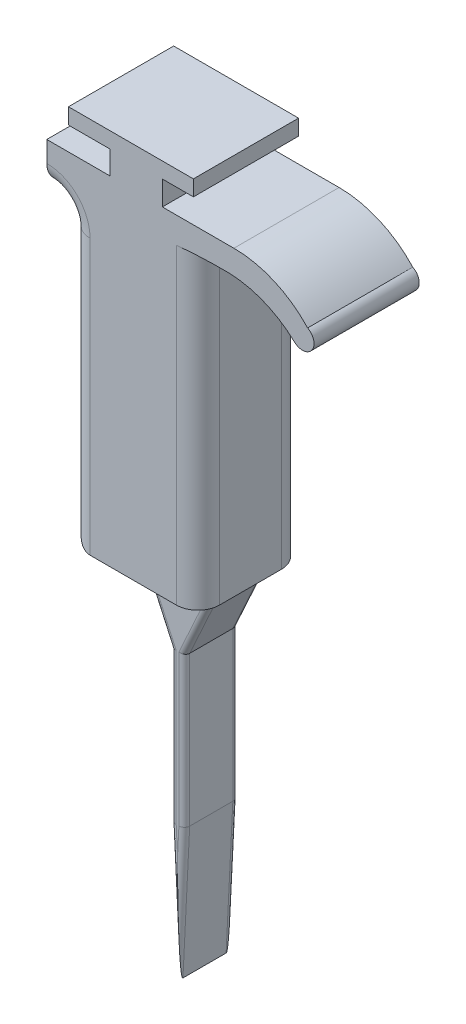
ISO-10303-21;
HEADER;
FILE_DESCRIPTION(('STEP AP214'),'2;1');
FILE_NAME('part.step','',(''),(''),'','','');
FILE_SCHEMA(('AUTOMOTIVE_DESIGN { 1 0 10303 214 1 1 1 1 }'));
ENDSEC;
DATA;
#1=APPLICATION_CONTEXT('core data for automotive mechanical design processes');
#2=APPLICATION_PROTOCOL_DEFINITION('international standard','automotive_design',2000,#1);
#3=PRODUCT_CONTEXT('',#1,'mechanical');
#4=PRODUCT('Part','Part','',(#3));
#5=PRODUCT_RELATED_PRODUCT_CATEGORY('part','',(#4));
#6=PRODUCT_DEFINITION_FORMATION('','',#4);
#7=PRODUCT_DEFINITION_CONTEXT('part definition',#1,'design');
#8=PRODUCT_DEFINITION('design','',#6,#7);
#9=PRODUCT_DEFINITION_SHAPE('','',#8);
#10=(LENGTH_UNIT() NAMED_UNIT(*) SI_UNIT(.MILLI.,.METRE.));
#11=(NAMED_UNIT(*) PLANE_ANGLE_UNIT() SI_UNIT($,.RADIAN.));
#12=(NAMED_UNIT(*) SI_UNIT($,.STERADIAN.) SOLID_ANGLE_UNIT());
#13=UNCERTAINTY_MEASURE_WITH_UNIT(LENGTH_MEASURE(1.E-05),#10,'distance_accuracy_value','');
#14=(GEOMETRIC_REPRESENTATION_CONTEXT(3) GLOBAL_UNCERTAINTY_ASSIGNED_CONTEXT((#13)) GLOBAL_UNIT_ASSIGNED_CONTEXT((#10,
#11,#12)) REPRESENTATION_CONTEXT('',''));
#15=CARTESIAN_POINT('',(0.,0.,0.));
#16=DIRECTION('',(0.,0.,1.));
#17=DIRECTION('',(1.,0.,0.));
#18=AXIS2_PLACEMENT_3D('',#15,#16,#17);
#19=CARTESIAN_POINT('',(0.,-5.,19.5));
#20=DIRECTION('',(0.,1.,0.));
#21=DIRECTION('',(0.,0.,1.));
#22=AXIS2_PLACEMENT_3D('',#19,#20,#21);
#23=PLANE('',#22);
#24=CARTESIAN_POINT('',(-3.65891787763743,-5.,-8.));
#25=DIRECTION('',(0.,1.,0.));
#26=DIRECTION('',(1.,0.,0.));
#27=AXIS2_PLACEMENT_3D('',#24,#25,#26);
#28=ELLIPSE('',#27,4.39820806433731,4.);
#29=CARTESIAN_POINT('',(-3.65891787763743,-5.,-12.));
#30=VERTEX_POINT('',#29);
#31=CARTESIAN_POINT('',(-8.05712594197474,-5.,-8.));
#32=VERTEX_POINT('',#31);
#33=EDGE_CURVE('E776',#30,#32,#28,.T.);
#34=ORIENTED_EDGE('',*,*,#33,.T.);
#35=DIRECTION('',(0.,0.,-1.));
#36=VECTOR('',#35,1.);
#37=CARTESIAN_POINT('',(-8.05712594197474,-5.,8.));
#38=LINE('',#37,#36);
#39=CARTESIAN_POINT('',(-8.05712594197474,-5.,8.));
#40=VERTEX_POINT('',#39);
#41=EDGE_CURVE('E560',#32,#40,#38,.F.);
#42=ORIENTED_EDGE('',*,*,#41,.T.);
#43=CARTESIAN_POINT('',(-3.65891787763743,-5.,8.));
#44=DIRECTION('',(0.,1.,0.));
#45=DIRECTION('',(-1.,0.,0.));
#46=AXIS2_PLACEMENT_3D('',#43,#44,#45);
#47=ELLIPSE('',#46,4.39820806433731,4.);
#48=CARTESIAN_POINT('',(-3.65891787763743,-5.,12.));
#49=VERTEX_POINT('',#48);
#50=EDGE_CURVE('E782',#40,#49,#47,.T.);
#51=ORIENTED_EDGE('',*,*,#50,.T.);
#52=DIRECTION('',(1.,0.,0.));
#53=VECTOR('',#52,1.);
#54=CARTESIAN_POINT('',(0.,-5.,12.));
#55=LINE('',#54,#53);
#56=CARTESIAN_POINT('',(17.5420517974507,-5.,12.));
#57=VERTEX_POINT('',#56);
#58=EDGE_CURVE('E779',#49,#57,#55,.T.);
#59=ORIENTED_EDGE('',*,*,#58,.T.);
#60=CARTESIAN_POINT('',(17.5420517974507,-5.,8.));
#61=DIRECTION('',(0.,1.,0.));
#62=DIRECTION('',(-1.,0.,0.));
#63=AXIS2_PLACEMENT_3D('',#60,#61,#62);
#64=ELLIPSE('',#63,4.39820806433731,4.);
#65=CARTESIAN_POINT('',(21.940259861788,-5.,8.));
#66=VERTEX_POINT('',#65);
#67=EDGE_CURVE('E773',#57,#66,#64,.T.);
#68=ORIENTED_EDGE('',*,*,#67,.T.);
#69=DIRECTION('',(0.,0.,-1.));
#70=VECTOR('',#69,1.);
#71=CARTESIAN_POINT('',(21.940259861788,-5.,19.5));
#72=LINE('',#71,#70);
#73=CARTESIAN_POINT('',(21.940259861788,-5.,-8.));
#74=VERTEX_POINT('',#73);
#75=EDGE_CURVE('E605',#66,#74,#72,.T.);
#76=ORIENTED_EDGE('',*,*,#75,.T.);
#77=CARTESIAN_POINT('',(17.5420517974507,-5.,-8.));
#78=DIRECTION('',(0.,1.,0.));
#79=DIRECTION('',(1.,0.,0.));
#80=AXIS2_PLACEMENT_3D('',#77,#78,#79);
#81=ELLIPSE('',#80,4.39820806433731,4.);
#82=CARTESIAN_POINT('',(17.5420517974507,-5.,-12.));
#83=VERTEX_POINT('',#82);
#84=EDGE_CURVE('E601',#74,#83,#81,.T.);
#85=ORIENTED_EDGE('',*,*,#84,.T.);
#86=DIRECTION('',(1.,0.,0.));
#87=VECTOR('',#86,1.);
#88=CARTESIAN_POINT('',(-4.57328024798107,-5.,-12.));
#89=LINE('',#88,#87);
#90=EDGE_CURVE('E766',#83,#30,#89,.F.);
#91=ORIENTED_EDGE('',*,*,#90,.T.);
#92=EDGE_LOOP('',(#34,#42,#51,#59,#68,#76,#85,#91));
#93=FACE_BOUND('',#92,.T.);
#94=DIRECTION('',(1.,0.,0.));
#95=VECTOR('',#94,1.);
#96=CARTESIAN_POINT('',(0.,-5.,19.5));
#97=LINE('',#96,#95);
#98=CARTESIAN_POINT('',(-16.,-5.,19.5));
#99=VERTEX_POINT('',#98);
#100=CARTESIAN_POINT('',(16.,-5.,19.5));
#101=VERTEX_POINT('',#100);
#102=EDGE_CURVE('E1263',#99,#101,#97,.T.);
#103=ORIENTED_EDGE('',*,*,#102,.F.);
#104=DIRECTION('',(0.,0.,-1.));
#105=VECTOR('',#104,1.);
#106=CARTESIAN_POINT('',(-16.,-5.,-19.5));
#107=LINE('',#106,#105);
#108=CARTESIAN_POINT('',(-16.,-5.,-19.5));
#109=VERTEX_POINT('',#108);
#110=EDGE_CURVE('E418',#99,#109,#107,.T.);
#111=ORIENTED_EDGE('',*,*,#110,.T.);
#112=DIRECTION('',(1.,0.,0.));
#113=VECTOR('',#112,1.);
#114=CARTESIAN_POINT('',(0.,-5.,-19.5));
#115=LINE('',#114,#113);
#116=CARTESIAN_POINT('',(16.,-5.,-19.5));
#117=VERTEX_POINT('',#116);
#118=EDGE_CURVE('E1262',#109,#117,#115,.T.);
#119=ORIENTED_EDGE('',*,*,#118,.T.);
#120=CARTESIAN_POINT('',(16.,-5.,-11.5));
#121=DIRECTION('',(0.,1.,0.));
#122=DIRECTION('',(0.,0.,1.));
#123=AXIS2_PLACEMENT_3D('',#120,#121,#122);
#124=CIRCLE('',#123,8.);
#125=CARTESIAN_POINT('',(24.,-5.,-11.5));
#126=VERTEX_POINT('',#125);
#127=EDGE_CURVE('E415',#117,#126,#124,.F.);
#128=ORIENTED_EDGE('',*,*,#127,.T.);
#129=DIRECTION('',(0.,0.,-1.));
#130=VECTOR('',#129,1.);
#131=CARTESIAN_POINT('',(24.,-5.,19.5));
#132=LINE('',#131,#130);
#133=CARTESIAN_POINT('',(24.,-5.,11.5));
#134=VERTEX_POINT('',#133);
#135=EDGE_CURVE('E1287',#134,#126,#132,.T.);
#136=ORIENTED_EDGE('',*,*,#135,.F.);
#137=CARTESIAN_POINT('',(16.,-5.,11.5));
#138=DIRECTION('',(0.,1.,0.));
#139=DIRECTION('',(0.,0.,1.));
#140=AXIS2_PLACEMENT_3D('',#137,#138,#139);
#141=CIRCLE('',#140,8.);
#142=EDGE_CURVE('E412',#134,#101,#141,.F.);
#143=ORIENTED_EDGE('',*,*,#142,.T.);
#144=EDGE_LOOP('',(#103,#111,#119,#128,#136,#143));
#145=FACE_BOUND('',#144,.T.);
#146=ADVANCED_FACE('F45',(#93,#145),#23,.F.);
#147=CARTESIAN_POINT('',(34.3690253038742,74.0912656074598,19.5));
#148=DIRECTION('',(0.,0.,-1.));
#149=DIRECTION('',(-1.,0.,0.));
#150=AXIS2_PLACEMENT_3D('',#147,#148,#149);
#151=CYLINDRICAL_SURFACE('',#150,37.2933685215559);
#152=CARTESIAN_POINT('',(34.3690253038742,74.0912656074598,-19.5));
#153=DIRECTION('',(0.,0.,1.));
#154=DIRECTION('',(1.,0.,0.));
#155=AXIS2_PLACEMENT_3D('',#152,#153,#154);
#156=CIRCLE('',#155,37.2933685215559);
#157=CARTESIAN_POINT('',(35.5852920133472,111.364795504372,-19.5));
#158=VERTEX_POINT('',#157);
#159=CARTESIAN_POINT('',(59.8312655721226,101.339561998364,-19.5));
#160=VERTEX_POINT('',#159);
#161=EDGE_CURVE('E348',#158,#160,#156,.F.);
#162=ORIENTED_EDGE('',*,*,#161,.T.);
#163=DIRECTION('',(0.,0.,-1.));
#164=VECTOR('',#163,1.);
#165=CARTESIAN_POINT('',(59.8312655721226,101.339561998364,19.5));
#166=LINE('',#165,#164);
#167=CARTESIAN_POINT('',(59.8312655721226,101.339561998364,19.5));
#168=VERTEX_POINT('',#167);
#169=EDGE_CURVE('E326',#168,#160,#166,.T.);
#170=ORIENTED_EDGE('',*,*,#169,.F.);
#171=CARTESIAN_POINT('',(34.3690253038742,74.0912656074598,19.5));
#172=DIRECTION('',(0.,0.,1.));
#173=DIRECTION('',(1.,0.,0.));
#174=AXIS2_PLACEMENT_3D('',#171,#172,#173);
#175=CIRCLE('',#174,37.2933685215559);
#176=CARTESIAN_POINT('',(35.5852920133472,111.364795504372,19.5));
#177=VERTEX_POINT('',#176);
#178=EDGE_CURVE('E334',#177,#168,#175,.F.);
#179=ORIENTED_EDGE('',*,*,#178,.F.);
#180=DIRECTION('',(0.,0.,-1.));
#181=VECTOR('',#180,1.);
#182=CARTESIAN_POINT('',(35.5852920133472,111.364795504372,19.5));
#183=LINE('',#182,#181);
#184=EDGE_CURVE('E1378',#177,#158,#183,.T.);
#185=ORIENTED_EDGE('',*,*,#184,.T.);
#186=EDGE_LOOP('',(#162,#170,#179,#185));
#187=FACE_BOUND('',#186,.T.);
#188=ADVANCED_FACE('F346',(#187),#151,.F.);
#189=CARTESIAN_POINT('',(62.7545265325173,104.467875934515,19.5));
#190=DIRECTION('',(0.,0.,-1.));
#191=DIRECTION('',(-1.,0.,0.));
#192=AXIS2_PLACEMENT_3D('',#189,#190,#191);
#193=CYLINDRICAL_SURFACE('',#192,4.28156545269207);
#194=CARTESIAN_POINT('',(62.7545265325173,104.467875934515,-19.5));
#195=DIRECTION('',(0.,0.,1.));
#196=DIRECTION('',(1.,0.,0.));
#197=AXIS2_PLACEMENT_3D('',#194,#195,#196);
#198=CIRCLE('',#197,4.28156545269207);
#199=CARTESIAN_POINT('',(64.6588957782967,108.302609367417,-19.5));
#200=VERTEX_POINT('',#199);
#201=EDGE_CURVE('E1336',#160,#200,#198,.T.);
#202=ORIENTED_EDGE('',*,*,#201,.T.);
#203=DIRECTION('',(0.,0.,-1.));
#204=VECTOR('',#203,1.);
#205=CARTESIAN_POINT('',(64.6588957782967,108.302609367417,19.5));
#206=LINE('',#205,#204);
#207=CARTESIAN_POINT('',(64.6588957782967,108.302609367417,19.5));
#208=VERTEX_POINT('',#207);
#209=EDGE_CURVE('E328',#208,#200,#206,.T.);
#210=ORIENTED_EDGE('',*,*,#209,.F.);
#211=CARTESIAN_POINT('',(62.7545265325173,104.467875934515,19.5));
#212=DIRECTION('',(0.,0.,1.));
#213=DIRECTION('',(1.,0.,0.));
#214=AXIS2_PLACEMENT_3D('',#211,#212,#213);
#215=CIRCLE('',#214,4.28156545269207);
#216=EDGE_CURVE('E321',#168,#208,#215,.T.);
#217=ORIENTED_EDGE('',*,*,#216,.F.);
#218=ORIENTED_EDGE('',*,*,#169,.T.);
#219=EDGE_LOOP('',(#202,#210,#217,#218));
#220=FACE_BOUND('',#219,.T.);
#221=ADVANCED_FACE('F324',(#220),#193,.T.);
#222=CARTESIAN_POINT('',(37.3224990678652,82.9439595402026,19.5));
#223=DIRECTION('',(0.,0.,-1.));
#224=DIRECTION('',(-1.,0.,0.));
#225=AXIS2_PLACEMENT_3D('',#222,#223,#224);
#226=CYLINDRICAL_SURFACE('',#225,37.2872593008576);
#227=CARTESIAN_POINT('',(37.3224990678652,82.9439595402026,-19.5));
#228=DIRECTION('',(0.,0.,1.));
#229=DIRECTION('',(1.,0.,0.));
#230=AXIS2_PLACEMENT_3D('',#227,#228,#229);
#231=CIRCLE('',#230,37.2872593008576);
#232=CARTESIAN_POINT('',(37.3224990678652,120.23121884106,-19.5));
#233=VERTEX_POINT('',#232);
#234=EDGE_CURVE('E1333',#233,#200,#231,.F.);
#235=ORIENTED_EDGE('',*,*,#234,.F.);
#236=DIRECTION('',(0.,0.,-1.));
#237=VECTOR('',#236,1.);
#238=CARTESIAN_POINT('',(37.3224990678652,120.23121884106,19.5));
#239=LINE('',#238,#237);
#240=CARTESIAN_POINT('',(37.3224990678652,120.23121884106,19.5));
#241=VERTEX_POINT('',#240);
#242=EDGE_CURVE('E356',#241,#233,#239,.T.);
#243=ORIENTED_EDGE('',*,*,#242,.F.);
#244=CARTESIAN_POINT('',(37.3224990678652,82.9439595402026,19.5));
#245=DIRECTION('',(0.,0.,1.));
#246=DIRECTION('',(1.,0.,0.));
#247=AXIS2_PLACEMENT_3D('',#244,#245,#246);
#248=CIRCLE('',#247,37.2872593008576);
#249=EDGE_CURVE('E333',#241,#208,#248,.F.);
#250=ORIENTED_EDGE('',*,*,#249,.T.);
#251=ORIENTED_EDGE('',*,*,#209,.T.);
#252=EDGE_LOOP('',(#235,#243,#250,#251));
#253=FACE_BOUND('',#252,.T.);
#254=ADVANCED_FACE('F1334',(#253),#226,.T.);
#255=CARTESIAN_POINT('',(0.,120.23121884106,19.5));
#256=DIRECTION('',(0.,1.,0.));
#257=DIRECTION('',(0.,0.,1.));
#258=AXIS2_PLACEMENT_3D('',#255,#256,#257);
#259=PLANE('',#258);
#260=DIRECTION('',(1.,0.,0.));
#261=VECTOR('',#260,1.);
#262=CARTESIAN_POINT('',(0.,120.23121884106,-19.5));
#263=LINE('',#262,#261);
#264=CARTESIAN_POINT('',(10.8102105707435,120.23121884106,-19.5));
#265=VERTEX_POINT('',#264);
#266=EDGE_CURVE('E1327',#265,#233,#263,.T.);
#267=ORIENTED_EDGE('',*,*,#266,.F.);
#268=DIRECTION('',(0.,0.,-1.));
#269=VECTOR('',#268,1.);
#270=CARTESIAN_POINT('',(10.8102105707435,120.23121884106,19.5));
#271=LINE('',#270,#269);
#272=CARTESIAN_POINT('',(10.8102105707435,120.23121884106,19.5));
#273=VERTEX_POINT('',#272);
#274=EDGE_CURVE('E1318',#273,#265,#271,.T.);
#275=ORIENTED_EDGE('',*,*,#274,.F.);
#276=DIRECTION('',(1.,0.,0.));
#277=VECTOR('',#276,1.);
#278=CARTESIAN_POINT('',(0.,120.23121884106,19.5));
#279=LINE('',#278,#277);
#280=EDGE_CURVE('E1330',#273,#241,#279,.T.);
#281=ORIENTED_EDGE('',*,*,#280,.T.);
#282=ORIENTED_EDGE('',*,*,#242,.T.);
#283=EDGE_LOOP('',(#267,#275,#281,#282));
#284=FACE_BOUND('',#283,.T.);
#285=ADVANCED_FACE('F1325',(#284),#259,.T.);
#286=CARTESIAN_POINT('',(10.8102105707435,0.,19.5));
#287=DIRECTION('',(1.,0.,0.));
#288=DIRECTION('',(0.,0.,-1.));
#289=AXIS2_PLACEMENT_3D('',#286,#287,#288);
#290=PLANE('',#289);
#291=DIRECTION('',(0.,-1.,0.));
#292=VECTOR('',#291,1.);
#293=CARTESIAN_POINT('',(10.8102105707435,0.,-19.5));
#294=LINE('',#293,#292);
#295=CARTESIAN_POINT('',(10.8102105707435,129.205844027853,-19.5));
#296=VERTEX_POINT('',#295);
#297=EDGE_CURVE('E1340',#296,#265,#294,.T.);
#298=ORIENTED_EDGE('',*,*,#297,.F.);
#299=DIRECTION('',(0.,0.,-1.));
#300=VECTOR('',#299,1.);
#301=CARTESIAN_POINT('',(10.8102105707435,129.205844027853,19.5));
#302=LINE('',#301,#300);
#303=CARTESIAN_POINT('',(10.8102105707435,129.205844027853,19.5));
#304=VERTEX_POINT('',#303);
#305=EDGE_CURVE('E1315',#304,#296,#302,.T.);
#306=ORIENTED_EDGE('',*,*,#305,.F.);
#307=DIRECTION('',(0.,-1.,0.));
#308=VECTOR('',#307,1.);
#309=CARTESIAN_POINT('',(10.8102105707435,0.,19.5));
#310=LINE('',#309,#308);
#311=EDGE_CURVE('E1419',#304,#273,#310,.T.);
#312=ORIENTED_EDGE('',*,*,#311,.T.);
#313=ORIENTED_EDGE('',*,*,#274,.T.);
#314=EDGE_LOOP('',(#298,#306,#312,#313));
#315=FACE_BOUND('',#314,.T.);
#316=ADVANCED_FACE('F1479',(#315),#290,.T.);
#317=CARTESIAN_POINT('',(0.,129.205844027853,19.5));
#318=DIRECTION('',(0.,-1.,0.));
#319=DIRECTION('',(0.,0.,-1.));
#320=AXIS2_PLACEMENT_3D('',#317,#318,#319);
#321=PLANE('',#320);
#322=DIRECTION('',(-1.,0.,0.));
#323=VECTOR('',#322,1.);
#324=CARTESIAN_POINT('',(0.,129.205844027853,-19.5));
#325=LINE('',#324,#323);
#326=CARTESIAN_POINT('',(22.3114786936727,129.205844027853,-19.5));
#327=VERTEX_POINT('',#326);
#328=EDGE_CURVE('E1344',#327,#296,#325,.T.);
#329=ORIENTED_EDGE('',*,*,#328,.F.);
#330=DIRECTION('',(0.,0.,-1.));
#331=VECTOR('',#330,1.);
#332=CARTESIAN_POINT('',(22.3114786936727,129.205844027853,19.5));
#333=LINE('',#332,#331);
#334=CARTESIAN_POINT('',(22.3114786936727,129.205844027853,19.5));
#335=VERTEX_POINT('',#334);
#336=EDGE_CURVE('E1312',#335,#327,#333,.T.);
#337=ORIENTED_EDGE('',*,*,#336,.F.);
#338=DIRECTION('',(-1.,0.,0.));
#339=VECTOR('',#338,1.);
#340=CARTESIAN_POINT('',(0.,129.205844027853,19.5));
#341=LINE('',#340,#339);
#342=EDGE_CURVE('E1423',#335,#304,#341,.T.);
#343=ORIENTED_EDGE('',*,*,#342,.T.);
#344=ORIENTED_EDGE('',*,*,#305,.T.);
#345=EDGE_LOOP('',(#329,#337,#343,#344));
#346=FACE_BOUND('',#345,.T.);
#347=ADVANCED_FACE('F1476',(#346),#321,.T.);
#348=CARTESIAN_POINT('',(22.3114786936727,0.,19.5));
#349=DIRECTION('',(1.,0.,0.));
#350=DIRECTION('',(0.,0.,-1.));
#351=AXIS2_PLACEMENT_3D('',#348,#349,#350);
#352=PLANE('',#351);
#353=DIRECTION('',(0.,-1.,0.));
#354=VECTOR('',#353,1.);
#355=CARTESIAN_POINT('',(22.3114786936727,0.,-19.5));
#356=LINE('',#355,#354);
#357=CARTESIAN_POINT('',(22.3114786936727,135.,-19.5));
#358=VERTEX_POINT('',#357);
#359=EDGE_CURVE('E1350',#358,#327,#356,.T.);
#360=ORIENTED_EDGE('',*,*,#359,.F.);
#361=DIRECTION('',(0.,0.,-1.));
#362=VECTOR('',#361,1.);
#363=CARTESIAN_POINT('',(22.3114786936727,135.,19.5));
#364=LINE('',#363,#362);
#365=CARTESIAN_POINT('',(22.3114786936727,135.,19.5));
#366=VERTEX_POINT('',#365);
#367=EDGE_CURVE('E1309',#366,#358,#364,.T.);
#368=ORIENTED_EDGE('',*,*,#367,.F.);
#369=DIRECTION('',(0.,-1.,0.));
#370=VECTOR('',#369,1.);
#371=CARTESIAN_POINT('',(22.3114786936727,0.,19.5));
#372=LINE('',#371,#370);
#373=EDGE_CURVE('E1427',#366,#335,#372,.T.);
#374=ORIENTED_EDGE('',*,*,#373,.T.);
#375=ORIENTED_EDGE('',*,*,#336,.T.);
#376=EDGE_LOOP('',(#360,#368,#374,#375));
#377=FACE_BOUND('',#376,.T.);
#378=ADVANCED_FACE('F1472',(#377),#352,.T.);
#379=CARTESIAN_POINT('',(0.,135.,19.5));
#380=DIRECTION('',(0.,1.,0.));
#381=DIRECTION('',(0.,0.,1.));
#382=AXIS2_PLACEMENT_3D('',#379,#380,#381);
#383=PLANE('',#382);
#384=DIRECTION('',(1.,0.,0.));
#385=VECTOR('',#384,1.);
#386=CARTESIAN_POINT('',(0.,135.,-19.5));
#387=LINE('',#386,#385);
#388=CARTESIAN_POINT('',(-24.,135.,-19.5));
#389=VERTEX_POINT('',#388);
#390=EDGE_CURVE('E1354',#389,#358,#387,.T.);
#391=ORIENTED_EDGE('',*,*,#390,.F.);
#392=DIRECTION('',(0.,0.,-1.));
#393=VECTOR('',#392,1.);
#394=CARTESIAN_POINT('',(-24.,135.,19.5));
#395=LINE('',#394,#393);
#396=CARTESIAN_POINT('',(-24.,135.,19.5));
#397=VERTEX_POINT('',#396);
#398=EDGE_CURVE('E1306',#397,#389,#395,.T.);
#399=ORIENTED_EDGE('',*,*,#398,.F.);
#400=DIRECTION('',(1.,0.,0.));
#401=VECTOR('',#400,1.);
#402=CARTESIAN_POINT('',(0.,135.,19.5));
#403=LINE('',#402,#401);
#404=EDGE_CURVE('E1431',#397,#366,#403,.T.);
#405=ORIENTED_EDGE('',*,*,#404,.T.);
#406=ORIENTED_EDGE('',*,*,#367,.T.);
#407=EDGE_LOOP('',(#391,#399,#405,#406));
#408=FACE_BOUND('',#407,.T.);
#409=ADVANCED_FACE('F1468',(#408),#383,.T.);
#410=CARTESIAN_POINT('',(-24.,0.,19.5));
#411=DIRECTION('',(-1.,0.,0.));
#412=DIRECTION('',(0.,0.,1.));
#413=AXIS2_PLACEMENT_3D('',#410,#411,#412);
#414=PLANE('',#413);
#415=DIRECTION('',(0.,1.,0.));
#416=VECTOR('',#415,1.);
#417=CARTESIAN_POINT('',(-24.,0.,-19.5));
#418=LINE('',#417,#416);
#419=CARTESIAN_POINT('',(-24.,129.113372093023,-19.5));
#420=VERTEX_POINT('',#419);
#421=EDGE_CURVE('E1358',#420,#389,#418,.T.);
#422=ORIENTED_EDGE('',*,*,#421,.F.);
#423=DIRECTION('',(0.,0.,-1.));
#424=VECTOR('',#423,1.);
#425=CARTESIAN_POINT('',(-24.,129.113372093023,19.5));
#426=LINE('',#425,#424);
#427=CARTESIAN_POINT('',(-24.,129.113372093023,19.5));
#428=VERTEX_POINT('',#427);
#429=EDGE_CURVE('E1303',#428,#420,#426,.T.);
#430=ORIENTED_EDGE('',*,*,#429,.F.);
#431=DIRECTION('',(0.,1.,0.));
#432=VECTOR('',#431,1.);
#433=CARTESIAN_POINT('',(-24.,0.,19.5));
#434=LINE('',#433,#432);
#435=EDGE_CURVE('E1435',#428,#397,#434,.T.);
#436=ORIENTED_EDGE('',*,*,#435,.T.);
#437=ORIENTED_EDGE('',*,*,#398,.T.);
#438=EDGE_LOOP('',(#422,#430,#436,#437));
#439=FACE_BOUND('',#438,.T.);
#440=ADVANCED_FACE('F1464',(#439),#414,.T.);
#441=CARTESIAN_POINT('',(0.,129.113372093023,19.5));
#442=DIRECTION('',(0.,-1.,0.));
#443=DIRECTION('',(0.,0.,-1.));
#444=AXIS2_PLACEMENT_3D('',#441,#442,#443);
#445=PLANE('',#444);
#446=DIRECTION('',(-1.,0.,0.));
#447=VECTOR('',#446,1.);
#448=CARTESIAN_POINT('',(0.,129.113372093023,-19.5));
#449=LINE('',#448,#447);
#450=CARTESIAN_POINT('',(-8.63372093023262,129.113372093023,-19.5));
#451=VERTEX_POINT('',#450);
#452=EDGE_CURVE('E1362',#451,#420,#449,.T.);
#453=ORIENTED_EDGE('',*,*,#452,.F.);
#454=DIRECTION('',(0.,0.,-1.));
#455=VECTOR('',#454,1.);
#456=CARTESIAN_POINT('',(-8.63372093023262,129.113372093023,19.5));
#457=LINE('',#456,#455);
#458=CARTESIAN_POINT('',(-8.63372093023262,129.113372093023,19.5));
#459=VERTEX_POINT('',#458);
#460=EDGE_CURVE('E1300',#459,#451,#457,.T.);
#461=ORIENTED_EDGE('',*,*,#460,.F.);
#462=DIRECTION('',(-1.,0.,0.));
#463=VECTOR('',#462,1.);
#464=CARTESIAN_POINT('',(0.,129.113372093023,19.5));
#465=LINE('',#464,#463);
#466=EDGE_CURVE('E1439',#459,#428,#465,.T.);
#467=ORIENTED_EDGE('',*,*,#466,.T.);
#468=ORIENTED_EDGE('',*,*,#429,.T.);
#469=EDGE_LOOP('',(#453,#461,#467,#468));
#470=FACE_BOUND('',#469,.T.);
#471=ADVANCED_FACE('F1462',(#470),#445,.T.);
#472=CARTESIAN_POINT('',(-8.63372093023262,0.,19.5));
#473=DIRECTION('',(-1.,0.,0.));
#474=DIRECTION('',(0.,0.,1.));
#475=AXIS2_PLACEMENT_3D('',#472,#473,#474);
#476=PLANE('',#475);
#477=DIRECTION('',(0.,1.,0.));
#478=VECTOR('',#477,1.);
#479=CARTESIAN_POINT('',(-8.63372093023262,0.,-19.5));
#480=LINE('',#479,#478);
#481=CARTESIAN_POINT('',(-8.63372093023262,120.479651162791,-19.5));
#482=VERTEX_POINT('',#481);
#483=EDGE_CURVE('E1366',#482,#451,#480,.T.);
#484=ORIENTED_EDGE('',*,*,#483,.F.);
#485=DIRECTION('',(0.,0.,-1.));
#486=VECTOR('',#485,1.);
#487=CARTESIAN_POINT('',(-8.63372093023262,120.479651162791,19.5));
#488=LINE('',#487,#486);
#489=CARTESIAN_POINT('',(-8.63372093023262,120.479651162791,19.5));
#490=VERTEX_POINT('',#489);
#491=EDGE_CURVE('E1291',#490,#482,#488,.T.);
#492=ORIENTED_EDGE('',*,*,#491,.F.);
#493=DIRECTION('',(0.,1.,0.));
#494=VECTOR('',#493,1.);
#495=CARTESIAN_POINT('',(-8.63372093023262,0.,19.5));
#496=LINE('',#495,#494);
#497=EDGE_CURVE('E1443',#490,#459,#496,.T.);
#498=ORIENTED_EDGE('',*,*,#497,.T.);
#499=ORIENTED_EDGE('',*,*,#460,.T.);
#500=EDGE_LOOP('',(#484,#492,#498,#499));
#501=FACE_BOUND('',#500,.T.);
#502=ADVANCED_FACE('F1458',(#501),#476,.T.);
#503=CARTESIAN_POINT('',(0.,120.479651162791,19.5));
#504=DIRECTION('',(0.,1.,0.));
#505=DIRECTION('',(0.,0.,1.));
#506=AXIS2_PLACEMENT_3D('',#503,#504,#505);
#507=PLANE('',#506);
#508=DIRECTION('',(1.,0.,0.));
#509=VECTOR('',#508,1.);
#510=CARTESIAN_POINT('',(0.,120.479651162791,-19.5));
#511=LINE('',#510,#509);
#512=CARTESIAN_POINT('',(-32.0413948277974,120.479651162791,-19.5));
#513=VERTEX_POINT('',#512);
#514=EDGE_CURVE('E1370',#513,#482,#511,.T.);
#515=ORIENTED_EDGE('',*,*,#514,.F.);
#516=DIRECTION('',(0.,0.,-1.));
#517=VECTOR('',#516,1.);
#518=CARTESIAN_POINT('',(-32.0413948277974,120.479651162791,19.5));
#519=LINE('',#518,#517);
#520=CARTESIAN_POINT('',(-32.0413948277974,120.479651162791,19.5));
#521=VERTEX_POINT('',#520);
#522=EDGE_CURVE('E1286',#521,#513,#519,.T.);
#523=ORIENTED_EDGE('',*,*,#522,.F.);
#524=DIRECTION('',(1.,0.,0.));
#525=VECTOR('',#524,1.);
#526=CARTESIAN_POINT('',(0.,120.479651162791,19.5));
#527=LINE('',#526,#525);
#528=EDGE_CURVE('E1396',#521,#490,#527,.T.);
#529=ORIENTED_EDGE('',*,*,#528,.T.);
#530=ORIENTED_EDGE('',*,*,#491,.T.);
#531=EDGE_LOOP('',(#515,#523,#529,#530));
#532=FACE_BOUND('',#531,.T.);
#533=ADVANCED_FACE('F1452',(#532),#507,.T.);
#534=CARTESIAN_POINT('',(-32.0413948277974,0.,19.5));
#535=DIRECTION('',(-1.,0.,0.));
#536=DIRECTION('',(0.,0.,1.));
#537=AXIS2_PLACEMENT_3D('',#534,#535,#536);
#538=PLANE('',#537);
#539=DIRECTION('',(0.,0.,-1.));
#540=VECTOR('',#539,1.);
#541=CARTESIAN_POINT('',(-32.0413948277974,104.781976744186,19.5));
#542=LINE('',#541,#540);
#543=CARTESIAN_POINT('',(-32.0413948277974,104.781976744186,11.5));
#544=VERTEX_POINT('',#543);
#545=CARTESIAN_POINT('',(-32.0413948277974,104.781976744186,-11.5));
#546=VERTEX_POINT('',#545);
#547=EDGE_CURVE('E1281',#544,#546,#542,.T.);
#548=ORIENTED_EDGE('',*,*,#547,.F.);
#549=CARTESIAN_POINT('',(-32.0413948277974,112.781976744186,11.5));
#550=DIRECTION('',(-1.,0.,0.));
#551=DIRECTION('',(0.,0.,1.));
#552=AXIS2_PLACEMENT_3D('',#549,#550,#551);
#553=CIRCLE('',#552,8.);
#554=CARTESIAN_POINT('',(-32.0413948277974,112.781976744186,19.5));
#555=VERTEX_POINT('',#554);
#556=EDGE_CURVE('E369',#544,#555,#553,.T.);
#557=ORIENTED_EDGE('',*,*,#556,.T.);
#558=DIRECTION('',(0.,1.,0.));
#559=VECTOR('',#558,1.);
#560=CARTESIAN_POINT('',(-32.0413948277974,0.,19.5));
#561=LINE('',#560,#559);
#562=EDGE_CURVE('E1391',#555,#521,#561,.T.);
#563=ORIENTED_EDGE('',*,*,#562,.T.);
#564=ORIENTED_EDGE('',*,*,#522,.T.);
#565=DIRECTION('',(0.,1.,0.));
#566=VECTOR('',#565,1.);
#567=CARTESIAN_POINT('',(-32.0413948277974,0.,-19.5));
#568=LINE('',#567,#566);
#569=CARTESIAN_POINT('',(-32.0413948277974,112.781976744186,-19.5));
#570=VERTEX_POINT('',#569);
#571=EDGE_CURVE('E1268',#570,#513,#568,.T.);
#572=ORIENTED_EDGE('',*,*,#571,.F.);
#573=CARTESIAN_POINT('',(-32.0413948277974,112.781976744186,-11.5));
#574=DIRECTION('',(-1.,0.,0.));
#575=DIRECTION('',(0.,0.,1.));
#576=AXIS2_PLACEMENT_3D('',#573,#574,#575);
#577=CIRCLE('',#576,8.);
#578=EDGE_CURVE('E366',#570,#546,#577,.T.);
#579=ORIENTED_EDGE('',*,*,#578,.T.);
#580=EDGE_LOOP('',(#548,#557,#563,#564,#572,#579));
#581=FACE_BOUND('',#580,.T.);
#582=ADVANCED_FACE('F1280',(#581),#538,.T.);
#583=CARTESIAN_POINT('',(0.,104.781976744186,19.5));
#584=DIRECTION('',(0.,-1.,0.));
#585=DIRECTION('',(0.,0.,-1.));
#586=AXIS2_PLACEMENT_3D('',#583,#584,#585);
#587=PLANE('',#586);
#588=DIRECTION('',(0.,0.,-1.));
#589=VECTOR('',#588,1.);
#590=CARTESIAN_POINT('',(-32.,104.781976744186,19.5));
#591=LINE('',#590,#589);
#592=CARTESIAN_POINT('',(-32.,104.781976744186,-11.5));
#593=VERTEX_POINT('',#592);
#594=CARTESIAN_POINT('',(-32.,104.781976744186,11.5));
#595=VERTEX_POINT('',#594);
#596=EDGE_CURVE('E350',#593,#595,#591,.F.);
#597=ORIENTED_EDGE('',*,*,#596,.T.);
#598=DIRECTION('',(-1.,0.,0.));
#599=VECTOR('',#598,1.);
#600=CARTESIAN_POINT('',(0.,104.781976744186,11.5));
#601=LINE('',#600,#599);
#602=EDGE_CURVE('E362',#595,#544,#601,.T.);
#603=ORIENTED_EDGE('',*,*,#602,.T.);
#604=ORIENTED_EDGE('',*,*,#547,.T.);
#605=DIRECTION('',(-1.,0.,0.));
#606=VECTOR('',#605,1.);
#607=CARTESIAN_POINT('',(-24.,104.781976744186,-11.5));
#608=LINE('',#607,#606);
#609=EDGE_CURVE('E354',#546,#593,#608,.F.);
#610=ORIENTED_EDGE('',*,*,#609,.T.);
#611=EDGE_LOOP('',(#597,#603,#604,#610));
#612=FACE_BOUND('',#611,.T.);
#613=ADVANCED_FACE('F1284',(#612),#587,.T.);
#614=CARTESIAN_POINT('',(-24.,0.,19.5));
#615=DIRECTION('',(-1.,0.,0.));
#616=DIRECTION('',(0.,0.,1.));
#617=AXIS2_PLACEMENT_3D('',#614,#615,#616);
#618=PLANE('',#617);
#619=DIRECTION('',(0.,1.,0.));
#620=VECTOR('',#619,1.);
#621=CARTESIAN_POINT('',(-24.,0.,11.5));
#622=LINE('',#621,#620);
#623=CARTESIAN_POINT('',(-24.,3.,11.5));
#624=VERTEX_POINT('',#623);
#625=CARTESIAN_POINT('',(-24.,96.7819767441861,11.5));
#626=VERTEX_POINT('',#625);
#627=EDGE_CURVE('E405',#624,#626,#622,.T.);
#628=ORIENTED_EDGE('',*,*,#627,.T.);
#629=DIRECTION('',(0.,0.,-1.));
#630=VECTOR('',#629,1.);
#631=CARTESIAN_POINT('',(-24.,96.7819767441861,-19.5));
#632=LINE('',#631,#630);
#633=CARTESIAN_POINT('',(-24.,96.7819767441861,-11.5));
#634=VERTEX_POINT('',#633);
#635=EDGE_CURVE('E408',#626,#634,#632,.T.);
#636=ORIENTED_EDGE('',*,*,#635,.T.);
#637=DIRECTION('',(0.,1.,0.));
#638=VECTOR('',#637,1.);
#639=CARTESIAN_POINT('',(-24.,-5.,-11.5));
#640=LINE('',#639,#638);
#641=CARTESIAN_POINT('',(-24.,3.,-11.5));
#642=VERTEX_POINT('',#641);
#643=EDGE_CURVE('E399',#634,#642,#640,.F.);
#644=ORIENTED_EDGE('',*,*,#643,.T.);
#645=DIRECTION('',(0.,0.,-1.));
#646=VECTOR('',#645,1.);
#647=CARTESIAN_POINT('',(-24.,3.,19.5));
#648=LINE('',#647,#646);
#649=EDGE_CURVE('E402',#642,#624,#648,.F.);
#650=ORIENTED_EDGE('',*,*,#649,.T.);
#651=EDGE_LOOP('',(#628,#636,#644,#650));
#652=FACE_BOUND('',#651,.T.);
#653=ADVANCED_FACE('F460',(#652),#618,.T.);
#654=CARTESIAN_POINT('',(24.,0.,19.5));
#655=DIRECTION('',(1.,0.,0.));
#656=DIRECTION('',(0.,1.,0.));
#657=AXIS2_PLACEMENT_3D('',#654,#655,#656);
#658=PLANE('',#657);
#659=ORIENTED_EDGE('',*,*,#135,.T.);
#660=DIRECTION('',(0.,-1.,0.));
#661=VECTOR('',#660,1.);
#662=CARTESIAN_POINT('',(24.,111.15015477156,-11.5));
#663=LINE('',#662,#661);
#664=CARTESIAN_POINT('',(24.,111.15015477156,-11.5));
#665=VERTEX_POINT('',#664);
#666=EDGE_CURVE('E425',#126,#665,#663,.F.);
#667=ORIENTED_EDGE('',*,*,#666,.T.);
#668=DIRECTION('',(0.,0.,-1.));
#669=VECTOR('',#668,1.);
#670=CARTESIAN_POINT('',(24.,111.15015477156,19.5));
#671=LINE('',#670,#669);
#672=CARTESIAN_POINT('',(24.,111.15015477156,11.5));
#673=VERTEX_POINT('',#672);
#674=EDGE_CURVE('E1294',#673,#665,#671,.T.);
#675=ORIENTED_EDGE('',*,*,#674,.F.);
#676=DIRECTION('',(0.,-1.,0.));
#677=VECTOR('',#676,1.);
#678=CARTESIAN_POINT('',(24.,0.,11.5));
#679=LINE('',#678,#677);
#680=EDGE_CURVE('E421',#673,#134,#679,.T.);
#681=ORIENTED_EDGE('',*,*,#680,.T.);
#682=EDGE_LOOP('',(#659,#667,#675,#681));
#683=FACE_BOUND('',#682,.T.);
#684=ADVANCED_FACE('F453',(#683),#658,.T.);
#685=CARTESIAN_POINT('',(33.0221201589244,-63.0542718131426,19.5));
#686=DIRECTION('',(0.,0.,-1.));
#687=DIRECTION('',(-1.,0.,0.));
#688=AXIS2_PLACEMENT_3D('',#685,#686,#687);
#689=CYLINDRICAL_SURFACE('',#688,174.43789982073);
#690=CARTESIAN_POINT('',(33.0221201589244,-63.0542718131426,-19.5));
#691=DIRECTION('',(0.,0.,1.));
#692=DIRECTION('',(1.,0.,0.));
#693=AXIS2_PLACEMENT_3D('',#690,#691,#692);
#694=CIRCLE('',#693,174.43789982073);
#695=CARTESIAN_POINT('',(16.,110.551109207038,-19.5));
#696=VERTEX_POINT('',#695);
#697=EDGE_CURVE('E344',#158,#696,#694,.T.);
#698=ORIENTED_EDGE('',*,*,#697,.F.);
#699=ORIENTED_EDGE('',*,*,#184,.F.);
#700=CARTESIAN_POINT('',(33.0221201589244,-63.0542718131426,19.5));
#701=DIRECTION('',(0.,0.,1.));
#702=DIRECTION('',(1.,0.,0.));
#703=AXIS2_PLACEMENT_3D('',#700,#701,#702);
#704=CIRCLE('',#703,174.43789982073);
#705=CARTESIAN_POINT('',(16.,110.551109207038,19.5));
#706=VERTEX_POINT('',#705);
#707=EDGE_CURVE('E341',#177,#706,#704,.T.);
#708=ORIENTED_EDGE('',*,*,#707,.T.);
#709=CARTESIAN_POINT('',(16.,110.551109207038,19.5));
#710=CARTESIAN_POINT('',(16.2250103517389,110.573176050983,19.5000238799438));
#711=CARTESIAN_POINT('',(16.4500631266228,110.594796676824,19.4905078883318));
#712=CARTESIAN_POINT('',(16.8986572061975,110.637020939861,19.4525455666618));
#713=CARTESIAN_POINT('',(17.1221985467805,110.657624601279,19.4240996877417));
#714=CARTESIAN_POINT('',(17.5660507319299,110.697679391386,19.3484497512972));
#715=CARTESIAN_POINT('',(17.7863634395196,110.717131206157,19.3012569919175));
#716=CARTESIAN_POINT('',(18.2223190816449,110.754803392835,19.1884319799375));
#717=CARTESIAN_POINT('',(18.437962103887,110.773023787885,19.1228000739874));
#718=CARTESIAN_POINT('',(18.8631645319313,110.808175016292,18.9734927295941));
#719=CARTESIAN_POINT('',(19.072720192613,110.825105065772,18.8898064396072));
#720=CARTESIAN_POINT('',(19.4841055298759,110.857618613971,18.704988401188));
#721=CARTESIAN_POINT('',(19.6859350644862,110.873202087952,18.6038563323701));
#722=CARTESIAN_POINT('',(20.0803568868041,110.902995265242,18.384878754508));
#723=CARTESIAN_POINT('',(20.2729513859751,110.917205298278,18.2670372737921));
#724=CARTESIAN_POINT('',(20.6475578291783,110.944252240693,18.0154517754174));
#725=CARTESIAN_POINT('',(20.8295698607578,110.957089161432,17.8817078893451));
#726=CARTESIAN_POINT('',(21.1811517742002,110.981366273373,17.5996963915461));
#727=CARTESIAN_POINT('',(21.350758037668,110.992810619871,17.4514744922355));
#728=CARTESIAN_POINT('',(21.676914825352,111.01437535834,17.141214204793));
#729=CARTESIAN_POINT('',(21.8334653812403,111.024495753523,16.9791758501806));
#730=CARTESIAN_POINT('',(22.1324105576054,111.043452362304,16.6423971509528));
#731=CARTESIAN_POINT('',(22.27480217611,111.052288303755,16.4676541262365));
#732=CARTESIAN_POINT('',(22.5443592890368,111.068718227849,16.1067439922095));
#733=CARTESIAN_POINT('',(22.6715250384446,111.076312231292,15.9205770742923));
#734=CARTESIAN_POINT('',(22.9094560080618,111.090291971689,15.5385572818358));
#735=CARTESIAN_POINT('',(23.0202560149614,111.096680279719,15.3427261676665));
#736=CARTESIAN_POINT('',(23.2249824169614,111.108317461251,14.9424081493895));
#737=CARTESIAN_POINT('',(23.3189091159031,111.113566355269,14.7379214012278));
#738=CARTESIAN_POINT('',(23.4891755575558,111.122968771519,14.3218334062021));
#739=CARTESIAN_POINT('',(23.5655236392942,111.127122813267,14.1102355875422));
#740=CARTESIAN_POINT('',(23.7001219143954,111.134378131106,13.6814307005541));
#741=CARTESIAN_POINT('',(23.7583765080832,111.137479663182,13.4642250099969));
#742=CARTESIAN_POINT('',(23.8713683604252,111.14345732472,12.9586007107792));
#743=CARTESIAN_POINT('',(23.9196037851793,111.145975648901,12.668683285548));
#744=CARTESIAN_POINT('',(23.9678359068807,111.14848661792,12.2315065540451));
#745=CARTESIAN_POINT('',(23.9798931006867,111.149112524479,12.085472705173));
#746=CARTESIAN_POINT('',(23.9959742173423,111.149946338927,11.7929710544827));
#747=CARTESIAN_POINT('',(23.9999986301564,111.150154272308,11.6465032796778));
#748=CARTESIAN_POINT('',(24.,111.15015477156,11.5));
#749=B_SPLINE_CURVE_WITH_KNOTS('',3,(#709,#710,#711,#712,#713,#714,#715,#716,#717,#718,#719,
#720,#721,#722,#723,#724,#725,#726,#727,#728,#729,#730,#731,#732,#733,#734,#735,#736,#737,#738,
#739,#740,#741,#742,#743,#744,#745,#746,#747,#748),.UNSPECIFIED.,.F.,.F.,(4,2,2,2,2,2,2,2,2,2,2,
2,2,2,2,2,2,2,2,4),(0.,0.678067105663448,1.3561180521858,2.03376097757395,2.71139116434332,
3.38942977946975,4.06748084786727,4.74536872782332,5.42325099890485,6.09905817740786,
6.77486371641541,7.45081223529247,8.12674943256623,8.80122853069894,9.47569548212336,
10.1498418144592,10.8238240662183,11.7035419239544,12.1429522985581,12.5823358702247),.UNSPECIFIED.);
#750=EDGE_CURVE('E438',#706,#673,#749,.T.);
#751=ORIENTED_EDGE('',*,*,#750,.T.);
#752=ORIENTED_EDGE('',*,*,#674,.T.);
#753=CARTESIAN_POINT('',(24.,111.15015477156,-11.5));
#754=CARTESIAN_POINT('',(24.0000243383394,111.150152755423,-11.7247271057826));
#755=CARTESIAN_POINT('',(23.9905318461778,111.149664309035,-11.9494507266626));
#756=CARTESIAN_POINT('',(23.9526889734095,111.147699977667,-12.3972897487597));
#757=CARTESIAN_POINT('',(23.9243395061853,111.146224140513,-12.6204052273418));
#758=CARTESIAN_POINT('',(23.8489874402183,111.142271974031,-13.0632782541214));
#759=CARTESIAN_POINT('',(23.8019992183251,111.139796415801,-13.2830382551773));
#760=CARTESIAN_POINT('',(23.6897144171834,111.133816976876,-13.7178127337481));
#761=CARTESIAN_POINT('',(23.6244180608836,111.130313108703,-13.9328272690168));
#762=CARTESIAN_POINT('',(23.475947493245,111.122239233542,-14.3566869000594));
#763=CARTESIAN_POINT('',(23.3927648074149,111.117668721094,-14.5655290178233));
#764=CARTESIAN_POINT('',(23.2091356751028,111.107419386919,-14.9754573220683));
#765=CARTESIAN_POINT('',(23.1086888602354,111.101740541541,-15.1765433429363));
#766=CARTESIAN_POINT('',(22.891273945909,111.089228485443,-15.5694905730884));
#767=CARTESIAN_POINT('',(22.7743088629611,111.082395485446,-15.761353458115));
#768=CARTESIAN_POINT('',(22.5246845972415,111.067525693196,-16.1345317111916));
#769=CARTESIAN_POINT('',(22.3920254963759,111.059488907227,-16.3158471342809));
#770=CARTESIAN_POINT('',(22.1119402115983,111.042162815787,-16.6666796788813));
#771=CARTESIAN_POINT('',(21.9645113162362,111.032873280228,-16.8361946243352));
#772=CARTESIAN_POINT('',(21.6559665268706,111.01300063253,-17.1621913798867));
#773=CARTESIAN_POINT('',(21.4948506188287,111.002417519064,-17.3186731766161));
#774=CARTESIAN_POINT('',(21.1600582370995,110.979921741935,-17.6175287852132));
#775=CARTESIAN_POINT('',(20.9863794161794,110.968008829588,-17.7598999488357));
#776=CARTESIAN_POINT('',(20.6277381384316,110.942833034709,-18.029499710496));
#777=CARTESIAN_POINT('',(20.4427758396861,110.929570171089,-18.1567285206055));
#778=CARTESIAN_POINT('',(20.0626447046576,110.901668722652,-18.395312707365));
#779=CARTESIAN_POINT('',(19.8674629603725,110.887028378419,-18.5066473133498));
#780=CARTESIAN_POINT('',(19.468519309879,110.856397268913,-18.7124723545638));
#781=CARTESIAN_POINT('',(19.2647575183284,110.840406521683,-18.8069630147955));
#782=CARTESIAN_POINT('',(18.8501800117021,110.807110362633,-18.9784195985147));
#783=CARTESIAN_POINT('',(18.639367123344,110.789805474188,-19.0553924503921));
#784=CARTESIAN_POINT('',(18.2122028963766,110.753936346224,-19.191320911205));
#785=CARTESIAN_POINT('',(17.9958528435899,110.735372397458,-19.2502806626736));
#786=CARTESIAN_POINT('',(17.4857756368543,110.69062272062,-19.3665001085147));
#787=CARTESIAN_POINT('',(17.1904039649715,110.663966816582,-19.4165753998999));
#788=CARTESIAN_POINT('',(16.7450484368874,110.622612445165,-19.4666327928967));
#789=CARTESIAN_POINT('',(16.5962911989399,110.608606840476,-19.4791426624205));
#790=CARTESIAN_POINT('',(16.2983620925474,110.58016949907,-19.4958251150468));
#791=CARTESIAN_POINT('',(16.1491902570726,110.565737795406,-19.4999983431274));
#792=CARTESIAN_POINT('',(16.,110.551109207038,-19.5));
#793=B_SPLINE_CURVE_WITH_KNOTS('',3,(#753,#754,#755,#756,#757,#758,#759,#760,#761,#762,#763,
#764,#765,#766,#767,#768,#769,#770,#771,#772,#773,#774,#775,#776,#777,#778,#779,#780,#781,#782,
#783,#784,#785,#786,#787,#788,#789,#790,#791,#792),.UNSPECIFIED.,.F.,.F.,(4,2,2,2,2,2,2,2,2,2,2,
2,2,2,2,2,2,2,2,4),(0.,0.673975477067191,1.34791831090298,2.02134231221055,2.69475811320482,
3.36849368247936,4.04224362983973,4.71587069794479,5.38949425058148,6.06324169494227,
6.73698983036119,7.41086417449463,8.08472907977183,8.75946669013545,9.43419528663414,
10.1086565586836,10.7829626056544,11.6831305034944,12.1327491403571,12.5823329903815),.UNSPECIFIED.);
#794=EDGE_CURVE('E428',#665,#696,#793,.T.);
#795=ORIENTED_EDGE('',*,*,#794,.T.);
#796=EDGE_LOOP('',(#698,#699,#708,#751,#752,#795));
#797=FACE_BOUND('',#796,.T.);
#798=ADVANCED_FACE('F448',(#797),#689,.F.);
#799=CARTESIAN_POINT('',(0.,0.,19.5));
#800=DIRECTION('',(0.,0.,1.));
#801=DIRECTION('',(1.,0.,0.));
#802=AXIS2_PLACEMENT_3D('',#799,#800,#801);
#803=PLANE('',#802);
#804=ORIENTED_EDGE('',*,*,#562,.F.);
#805=DIRECTION('',(-1.,0.,0.));
#806=VECTOR('',#805,1.);
#807=CARTESIAN_POINT('',(0.,112.781976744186,19.5));
#808=LINE('',#807,#806);
#809=CARTESIAN_POINT('',(-32.,112.781976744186,19.5));
#810=VERTEX_POINT('',#809);
#811=EDGE_CURVE('E382',#555,#810,#808,.F.);
#812=ORIENTED_EDGE('',*,*,#811,.T.);
#813=CARTESIAN_POINT('',(-32.,96.7819767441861,19.5));
#814=DIRECTION('',(0.,0.,1.));
#815=DIRECTION('',(1.,0.,0.));
#816=AXIS2_PLACEMENT_3D('',#813,#814,#815);
#817=CIRCLE('',#816,16.);
#818=CARTESIAN_POINT('',(-16.,96.7819767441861,19.5));
#819=VERTEX_POINT('',#818);
#820=EDGE_CURVE('E378',#819,#810,#817,.T.);
#821=ORIENTED_EDGE('',*,*,#820,.F.);
#822=DIRECTION('',(0.,1.,0.));
#823=VECTOR('',#822,1.);
#824=CARTESIAN_POINT('',(-16.,0.,19.5));
#825=LINE('',#824,#823);
#826=EDGE_CURVE('E375',#819,#99,#825,.F.);
#827=ORIENTED_EDGE('',*,*,#826,.T.);
#828=ORIENTED_EDGE('',*,*,#102,.T.);
#829=DIRECTION('',(0.,-1.,0.));
#830=VECTOR('',#829,1.);
#831=CARTESIAN_POINT('',(16.,0.,19.5));
#832=LINE('',#831,#830);
#833=EDGE_CURVE('E372',#101,#706,#832,.F.);
#834=ORIENTED_EDGE('',*,*,#833,.T.);
#835=ORIENTED_EDGE('',*,*,#707,.F.);
#836=ORIENTED_EDGE('',*,*,#178,.T.);
#837=ORIENTED_EDGE('',*,*,#216,.T.);
#838=ORIENTED_EDGE('',*,*,#249,.F.);
#839=ORIENTED_EDGE('',*,*,#280,.F.);
#840=ORIENTED_EDGE('',*,*,#311,.F.);
#841=ORIENTED_EDGE('',*,*,#342,.F.);
#842=ORIENTED_EDGE('',*,*,#373,.F.);
#843=ORIENTED_EDGE('',*,*,#404,.F.);
#844=ORIENTED_EDGE('',*,*,#435,.F.);
#845=ORIENTED_EDGE('',*,*,#466,.F.);
#846=ORIENTED_EDGE('',*,*,#497,.F.);
#847=ORIENTED_EDGE('',*,*,#528,.F.);
#848=EDGE_LOOP('',(#804,#812,#821,#827,#828,#834,#835,#836,#837,#838,#839,#840,#841,#842,#843,
#844,#845,#846,#847));
#849=FACE_BOUND('',#848,.T.);
#850=ADVANCED_FACE('F339',(#849),#803,.T.);
#851=CARTESIAN_POINT('',(0.,0.,-19.5));
#852=DIRECTION('',(0.,0.,1.));
#853=DIRECTION('',(1.,0.,0.));
#854=AXIS2_PLACEMENT_3D('',#851,#852,#853);
#855=PLANE('',#854);
#856=CARTESIAN_POINT('',(-32.,96.7819767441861,-19.5));
#857=DIRECTION('',(0.,0.,1.));
#858=DIRECTION('',(1.,0.,0.));
#859=AXIS2_PLACEMENT_3D('',#856,#857,#858);
#860=CIRCLE('',#859,16.);
#861=CARTESIAN_POINT('',(-32.,112.781976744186,-19.5));
#862=VERTEX_POINT('',#861);
#863=CARTESIAN_POINT('',(-16.,96.7819767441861,-19.5));
#864=VERTEX_POINT('',#863);
#865=EDGE_CURVE('E389',#862,#864,#860,.F.);
#866=ORIENTED_EDGE('',*,*,#865,.F.);
#867=DIRECTION('',(-1.,0.,0.));
#868=VECTOR('',#867,1.);
#869=CARTESIAN_POINT('',(-32.0413948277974,112.781976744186,-19.5));
#870=LINE('',#869,#868);
#871=EDGE_CURVE('E396',#862,#570,#870,.T.);
#872=ORIENTED_EDGE('',*,*,#871,.T.);
#873=ORIENTED_EDGE('',*,*,#571,.T.);
#874=ORIENTED_EDGE('',*,*,#514,.T.);
#875=ORIENTED_EDGE('',*,*,#483,.T.);
#876=ORIENTED_EDGE('',*,*,#452,.T.);
#877=ORIENTED_EDGE('',*,*,#421,.T.);
#878=ORIENTED_EDGE('',*,*,#390,.T.);
#879=ORIENTED_EDGE('',*,*,#359,.T.);
#880=ORIENTED_EDGE('',*,*,#328,.T.);
#881=ORIENTED_EDGE('',*,*,#297,.T.);
#882=ORIENTED_EDGE('',*,*,#266,.T.);
#883=ORIENTED_EDGE('',*,*,#234,.T.);
#884=ORIENTED_EDGE('',*,*,#201,.F.);
#885=ORIENTED_EDGE('',*,*,#161,.F.);
#886=ORIENTED_EDGE('',*,*,#697,.T.);
#887=DIRECTION('',(0.,-1.,0.));
#888=VECTOR('',#887,1.);
#889=CARTESIAN_POINT('',(16.,-5.,-19.5));
#890=LINE('',#889,#888);
#891=EDGE_CURVE('E385',#696,#117,#890,.T.);
#892=ORIENTED_EDGE('',*,*,#891,.T.);
#893=ORIENTED_EDGE('',*,*,#118,.F.);
#894=DIRECTION('',(0.,1.,0.));
#895=VECTOR('',#894,1.);
#896=CARTESIAN_POINT('',(-16.,104.781976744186,-19.5));
#897=LINE('',#896,#895);
#898=EDGE_CURVE('E393',#109,#864,#897,.T.);
#899=ORIENTED_EDGE('',*,*,#898,.T.);
#900=EDGE_LOOP('',(#866,#872,#873,#874,#875,#876,#877,#878,#879,#880,#881,#882,#883,#884,#885,
#886,#892,#893,#899));
#901=FACE_BOUND('',#900,.T.);
#902=ADVANCED_FACE('F455',(#901),#855,.F.);
#903=CARTESIAN_POINT('',(-7.49229160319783,-3.42533475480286,10.));
#904=DIRECTION('',(0.909461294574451,0.415788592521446,0.));
#905=DIRECTION('',(-0.415788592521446,0.909461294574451,0.));
#906=AXIS2_PLACEMENT_3D('',#903,#904,#905);
#907=PLANE('',#906);
#908=DIRECTION('',(0.415788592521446,-0.909461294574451,0.));
#909=VECTOR('',#908,1.);
#910=CARTESIAN_POINT('',(-6.77238428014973,-5.00000000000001,8.));
#911=LINE('',#910,#909);
#912=CARTESIAN_POINT('',(4.44156695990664,-29.5284618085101,8.));
#913=VERTEX_POINT('',#912);
#914=CARTESIAN_POINT('',(-6.23820335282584,-6.16842281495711,8.));
#915=VERTEX_POINT('',#914);
#916=EDGE_CURVE('E547',#913,#915,#911,.F.);
#917=ORIENTED_EDGE('',*,*,#916,.T.);
#918=DIRECTION('',(0.,0.,-1.));
#919=VECTOR('',#918,1.);
#920=CARTESIAN_POINT('',(-6.23820335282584,-6.16842281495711,-8.));
#921=LINE('',#920,#919);
#922=CARTESIAN_POINT('',(-6.23820335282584,-6.16842281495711,-8.));
#923=VERTEX_POINT('',#922);
#924=EDGE_CURVE('E559',#915,#923,#921,.T.);
#925=ORIENTED_EDGE('',*,*,#924,.T.);
#926=DIRECTION('',(0.415788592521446,-0.909461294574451,0.));
#927=VECTOR('',#926,1.);
#928=CARTESIAN_POINT('',(-7.49229160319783,-3.42533475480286,-8.));
#929=LINE('',#928,#927);
#930=CARTESIAN_POINT('',(4.44156695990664,-29.5284618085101,-8.));
#931=VERTEX_POINT('',#930);
#932=EDGE_CURVE('E538',#923,#931,#929,.T.);
#933=ORIENTED_EDGE('',*,*,#932,.T.);
#934=DIRECTION('',(0.,0.,-1.));
#935=VECTOR('',#934,1.);
#936=CARTESIAN_POINT('',(4.44156695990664,-29.5284618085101,10.));
#937=LINE('',#936,#935);
#938=EDGE_CURVE('E747',#913,#931,#937,.T.);
#939=ORIENTED_EDGE('',*,*,#938,.F.);
#940=EDGE_LOOP('',(#917,#925,#933,#939));
#941=FACE_BOUND('',#940,.T.);
#942=ADVANCED_FACE('F789',(#941),#907,.F.);
#943=CARTESIAN_POINT('',(4.44156695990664,0.,10.));
#944=DIRECTION('',(-1.,0.,0.));
#945=DIRECTION('',(0.,0.,1.));
#946=AXIS2_PLACEMENT_3D('',#943,#944,#945);
#947=PLANE('',#946);
#948=DIRECTION('',(0.,0.,-1.));
#949=VECTOR('',#948,1.);
#950=CARTESIAN_POINT('',(4.44156695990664,-85.,10.));
#951=LINE('',#950,#949);
#952=CARTESIAN_POINT('',(4.44156695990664,-85.,8.));
#953=VERTEX_POINT('',#952);
#954=CARTESIAN_POINT('',(4.44156695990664,-85.,-8.));
#955=VERTEX_POINT('',#954);
#956=EDGE_CURVE('E740',#953,#955,#951,.T.);
#957=ORIENTED_EDGE('',*,*,#956,.F.);
#958=DIRECTION('',(0.,1.,0.));
#959=VECTOR('',#958,1.);
#960=CARTESIAN_POINT('',(4.44156695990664,0.,8.));
#961=LINE('',#960,#959);
#962=EDGE_CURVE('E655',#953,#913,#961,.T.);
#963=ORIENTED_EDGE('',*,*,#962,.T.);
#964=ORIENTED_EDGE('',*,*,#938,.T.);
#965=DIRECTION('',(0.,1.,0.));
#966=VECTOR('',#965,1.);
#967=CARTESIAN_POINT('',(4.44156695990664,-85.,-8.));
#968=LINE('',#967,#966);
#969=EDGE_CURVE('E652',#931,#955,#968,.F.);
#970=ORIENTED_EDGE('',*,*,#969,.T.);
#971=EDGE_LOOP('',(#957,#963,#964,#970));
#972=FACE_BOUND('',#971,.T.);
#973=ADVANCED_FACE('F745',(#972),#947,.T.);
#974=CARTESIAN_POINT('',(0.191089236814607,0.00955446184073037,10.));
#975=DIRECTION('',(0.998752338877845,0.0499376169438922,0.));
#976=DIRECTION('',(-0.0499376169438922,0.998752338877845,0.));
#977=AXIS2_PLACEMENT_3D('',#974,#975,#976);
#978=PLANE('',#977);
#979=DIRECTION('',(0.,0.,-1.));
#980=VECTOR('',#979,1.);
#981=CARTESIAN_POINT('',(6.94156695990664,-135.,10.));
#982=LINE('',#981,#980);
#983=CARTESIAN_POINT('',(6.94156695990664,-135.,8.));
#984=VERTEX_POINT('',#983);
#985=CARTESIAN_POINT('',(6.94156695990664,-135.,-8.));
#986=VERTEX_POINT('',#985);
#987=EDGE_CURVE('E742',#984,#986,#982,.T.);
#988=ORIENTED_EDGE('',*,*,#987,.F.);
#989=DIRECTION('',(0.0499376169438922,-0.998752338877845,0.));
#990=VECTOR('',#989,1.);
#991=CARTESIAN_POINT('',(4.44156695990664,-85.,8.));
#992=LINE('',#991,#990);
#993=EDGE_CURVE('E649',#984,#953,#992,.F.);
#994=ORIENTED_EDGE('',*,*,#993,.T.);
#995=ORIENTED_EDGE('',*,*,#956,.T.);
#996=DIRECTION('',(0.0499376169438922,-0.998752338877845,0.));
#997=VECTOR('',#996,1.);
#998=CARTESIAN_POINT('',(0.191089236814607,0.00955446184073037,-8.));
#999=LINE('',#998,#997);
#1000=EDGE_CURVE('E645',#955,#986,#999,.T.);
#1001=ORIENTED_EDGE('',*,*,#1000,.T.);
#1002=EDGE_LOOP('',(#988,#994,#995,#1001));
#1003=FACE_BOUND('',#1002,.T.);
#1004=ADVANCED_FACE('F739',(#1003),#978,.F.);
#1005=CARTESIAN_POINT('',(13.6574234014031,-0.682871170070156,10.));
#1006=DIRECTION('',(-0.998752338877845,0.0499376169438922,0.));
#1007=DIRECTION('',(-0.0499376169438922,-0.998752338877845,0.));
#1008=AXIS2_PLACEMENT_3D('',#1005,#1006,#1007);
#1009=PLANE('',#1008);
#1010=DIRECTION('',(0.,0.,-1.));
#1011=VECTOR('',#1010,1.);
#1012=CARTESIAN_POINT('',(9.44156695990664,-85.,10.));
#1013=LINE('',#1012,#1011);
#1014=CARTESIAN_POINT('',(9.44156695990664,-85.,8.));
#1015=VERTEX_POINT('',#1014);
#1016=CARTESIAN_POINT('',(9.44156695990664,-85.,-8.));
#1017=VERTEX_POINT('',#1016);
#1018=EDGE_CURVE('E1406',#1015,#1017,#1013,.T.);
#1019=ORIENTED_EDGE('',*,*,#1018,.F.);
#1020=DIRECTION('',(0.0499376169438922,0.998752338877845,0.));
#1021=VECTOR('',#1020,1.);
#1022=CARTESIAN_POINT('',(6.94156695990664,-135.,8.));
#1023=LINE('',#1022,#1021);
#1024=EDGE_CURVE('E642',#1015,#984,#1023,.F.);
#1025=ORIENTED_EDGE('',*,*,#1024,.T.);
#1026=ORIENTED_EDGE('',*,*,#987,.T.);
#1027=DIRECTION('',(0.0499376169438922,0.998752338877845,0.));
#1028=VECTOR('',#1027,1.);
#1029=CARTESIAN_POINT('',(13.6574234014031,-0.682871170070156,-8.));
#1030=LINE('',#1029,#1028);
#1031=EDGE_CURVE('E639',#986,#1017,#1030,.T.);
#1032=ORIENTED_EDGE('',*,*,#1031,.T.);
#1033=EDGE_LOOP('',(#1019,#1025,#1026,#1032));
#1034=FACE_BOUND('',#1033,.T.);
#1035=ADVANCED_FACE('F946',(#1034),#1009,.F.);
#1036=CARTESIAN_POINT('',(9.44156695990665,0.,10.));
#1037=DIRECTION('',(-1.,0.,0.));
#1038=DIRECTION('',(0.,-1.,0.));
#1039=AXIS2_PLACEMENT_3D('',#1036,#1037,#1038);
#1040=PLANE('',#1039);
#1041=DIRECTION('',(0.,0.,-1.));
#1042=VECTOR('',#1041,1.);
#1043=CARTESIAN_POINT('',(9.44156695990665,-29.5284618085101,10.));
#1044=LINE('',#1043,#1042);
#1045=CARTESIAN_POINT('',(9.44156695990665,-29.5284618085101,8.));
#1046=VERTEX_POINT('',#1045);
#1047=CARTESIAN_POINT('',(9.44156695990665,-29.5284618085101,-8.));
#1048=VERTEX_POINT('',#1047);
#1049=EDGE_CURVE('E1222',#1046,#1048,#1044,.T.);
#1050=ORIENTED_EDGE('',*,*,#1049,.F.);
#1051=DIRECTION('',(0.,1.,0.));
#1052=VECTOR('',#1051,1.);
#1053=CARTESIAN_POINT('',(9.44156695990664,-85.,8.));
#1054=LINE('',#1053,#1052);
#1055=EDGE_CURVE('E661',#1046,#1015,#1054,.F.);
#1056=ORIENTED_EDGE('',*,*,#1055,.T.);
#1057=ORIENTED_EDGE('',*,*,#1018,.T.);
#1058=DIRECTION('',(0.,1.,0.));
#1059=VECTOR('',#1058,1.);
#1060=CARTESIAN_POINT('',(9.44156695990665,0.,-8.));
#1061=LINE('',#1060,#1059);
#1062=EDGE_CURVE('E658',#1017,#1048,#1061,.T.);
#1063=ORIENTED_EDGE('',*,*,#1062,.T.);
#1064=EDGE_LOOP('',(#1050,#1056,#1057,#1063));
#1065=FACE_BOUND('',#1064,.T.);
#1066=ADVANCED_FACE('F955',(#1065),#1040,.F.);
#1067=CARTESIAN_POINT('',(18.9753071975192,-8.67515343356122,10.));
#1068=DIRECTION('',(0.909461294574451,-0.415788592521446,0.));
#1069=DIRECTION('',(0.415788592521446,0.909461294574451,0.));
#1070=AXIS2_PLACEMENT_3D('',#1067,#1068,#1069);
#1071=PLANE('',#1070);
#1072=DIRECTION('',(-0.415788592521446,-0.909461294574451,0.));
#1073=VECTOR('',#1072,1.);
#1074=CARTESIAN_POINT('',(20.655518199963,-5.00000000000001,-8.));
#1075=LINE('',#1074,#1073);
#1076=CARTESIAN_POINT('',(20.1213372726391,-6.16842281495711,-8.));
#1077=VERTEX_POINT('',#1076);
#1078=EDGE_CURVE('E688',#1048,#1077,#1075,.F.);
#1079=ORIENTED_EDGE('',*,*,#1078,.T.);
#1080=DIRECTION('',(0.,0.,-1.));
#1081=VECTOR('',#1080,1.);
#1082=CARTESIAN_POINT('',(20.1213372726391,-6.16842281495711,10.));
#1083=LINE('',#1082,#1081);
#1084=CARTESIAN_POINT('',(20.1213372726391,-6.16842281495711,8.));
#1085=VERTEX_POINT('',#1084);
#1086=EDGE_CURVE('E606',#1077,#1085,#1083,.F.);
#1087=ORIENTED_EDGE('',*,*,#1086,.T.);
#1088=DIRECTION('',(-0.415788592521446,-0.909461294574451,0.));
#1089=VECTOR('',#1088,1.);
#1090=CARTESIAN_POINT('',(18.9753071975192,-8.67515343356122,8.));
#1091=LINE('',#1090,#1089);
#1092=EDGE_CURVE('E1209',#1085,#1046,#1091,.T.);
#1093=ORIENTED_EDGE('',*,*,#1092,.T.);
#1094=ORIENTED_EDGE('',*,*,#1049,.T.);
#1095=EDGE_LOOP('',(#1079,#1087,#1093,#1094));
#1096=FACE_BOUND('',#1095,.T.);
#1097=ADVANCED_FACE('F966',(#1096),#1071,.T.);
#1098=CARTESIAN_POINT('',(0.,0.,10.));
#1099=DIRECTION('',(0.,0.,1.));
#1100=DIRECTION('',(1.,0.,0.));
#1101=AXIS2_PLACEMENT_3D('',#1098,#1099,#1100);
#1102=PLANE('',#1101);
#1103=DIRECTION('',(-0.415788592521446,-0.909461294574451,0.));
#1104=VECTOR('',#1103,1.);
#1105=CARTESIAN_POINT('',(17.1563846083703,-7.84357624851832,10.));
#1106=LINE('',#1105,#1104);
#1107=CARTESIAN_POINT('',(7.44156695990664,-29.0929582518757,10.));
#1108=VERTEX_POINT('',#1107);
#1109=CARTESIAN_POINT('',(17.5420517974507,-7.,10.));
#1110=VERTEX_POINT('',#1109);
#1111=EDGE_CURVE('E548',#1108,#1110,#1106,.F.);
#1112=ORIENTED_EDGE('',*,*,#1111,.T.);
#1113=DIRECTION('',(1.,0.,0.));
#1114=VECTOR('',#1113,1.);
#1115=CARTESIAN_POINT('',(0.,-7.,10.));
#1116=LINE('',#1115,#1114);
#1117=CARTESIAN_POINT('',(-3.65891787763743,-7.,10.));
#1118=VERTEX_POINT('',#1117);
#1119=EDGE_CURVE('E636',#1110,#1118,#1116,.F.);
#1120=ORIENTED_EDGE('',*,*,#1119,.T.);
#1121=DIRECTION('',(0.415788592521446,-0.909461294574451,0.));
#1122=VECTOR('',#1121,1.);
#1123=CARTESIAN_POINT('',(6.26048954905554,-28.6968846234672,10.));
#1124=LINE('',#1123,#1122);
#1125=CARTESIAN_POINT('',(6.44156695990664,-29.0929582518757,10.));
#1126=VERTEX_POINT('',#1125);
#1127=EDGE_CURVE('E754',#1118,#1126,#1124,.T.);
#1128=ORIENTED_EDGE('',*,*,#1127,.T.);
#1129=DIRECTION('',(0.,1.,0.));
#1130=VECTOR('',#1129,1.);
#1131=CARTESIAN_POINT('',(6.44156695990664,0.,10.));
#1132=LINE('',#1131,#1130);
#1133=CARTESIAN_POINT('',(6.44156695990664,-84.9500312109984,10.));
#1134=VERTEX_POINT('',#1133);
#1135=EDGE_CURVE('E633',#1126,#1134,#1132,.F.);
#1136=ORIENTED_EDGE('',*,*,#1135,.T.);
#1137=DIRECTION('',(0.0499376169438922,-0.998752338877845,0.));
#1138=VECTOR('',#1137,1.);
#1139=CARTESIAN_POINT('',(8.93907163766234,-134.900124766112,10.));
#1140=LINE('',#1139,#1138);
#1141=CARTESIAN_POINT('',(6.94156695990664,-94.9500312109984,10.));
#1142=VERTEX_POINT('',#1141);
#1143=EDGE_CURVE('E630',#1134,#1142,#1140,.T.);
#1144=ORIENTED_EDGE('',*,*,#1143,.T.);
#1145=DIRECTION('',(0.0499376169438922,0.998752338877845,0.));
#1146=VECTOR('',#1145,1.);
#1147=CARTESIAN_POINT('',(7.44406228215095,-84.9001247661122,10.));
#1148=LINE('',#1147,#1146);
#1149=CARTESIAN_POINT('',(7.44156695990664,-84.9500312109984,10.));
#1150=VERTEX_POINT('',#1149);
#1151=EDGE_CURVE('E626',#1142,#1150,#1148,.T.);
#1152=ORIENTED_EDGE('',*,*,#1151,.T.);
#1153=DIRECTION('',(0.,1.,0.));
#1154=VECTOR('',#1153,1.);
#1155=CARTESIAN_POINT('',(7.44156695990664,-24.7183250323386,10.));
#1156=LINE('',#1155,#1154);
#1157=EDGE_CURVE('E617',#1150,#1108,#1156,.T.);
#1158=ORIENTED_EDGE('',*,*,#1157,.T.);
#1159=EDGE_LOOP('',(#1112,#1120,#1128,#1136,#1144,#1152,#1158));
#1160=FACE_BOUND('',#1159,.T.);
#1161=ADVANCED_FACE('F728',(#1160),#1102,.T.);
#1162=CARTESIAN_POINT('',(0.,0.,-10.));
#1163=DIRECTION('',(0.,0.,1.));
#1164=DIRECTION('',(1.,0.,0.));
#1165=AXIS2_PLACEMENT_3D('',#1162,#1163,#1164);
#1166=PLANE('',#1165);
#1167=DIRECTION('',(0.415788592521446,-0.909461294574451,0.));
#1168=VECTOR('',#1167,1.);
#1169=CARTESIAN_POINT('',(-5.67336901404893,-2.59375756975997,-10.));
#1170=LINE('',#1169,#1168);
#1171=CARTESIAN_POINT('',(6.44156695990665,-29.0929582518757,-10.));
#1172=VERTEX_POINT('',#1171);
#1173=CARTESIAN_POINT('',(-3.65891787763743,-7.00000000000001,-10.));
#1174=VERTEX_POINT('',#1173);
#1175=EDGE_CURVE('E760',#1172,#1174,#1170,.F.);
#1176=ORIENTED_EDGE('',*,*,#1175,.T.);
#1177=DIRECTION('',(1.,0.,0.));
#1178=VECTOR('',#1177,1.);
#1179=CARTESIAN_POINT('',(18.4564141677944,-7.,-10.));
#1180=LINE('',#1179,#1178);
#1181=CARTESIAN_POINT('',(17.5420517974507,-7.,-10.));
#1182=VERTEX_POINT('',#1181);
#1183=EDGE_CURVE('E676',#1174,#1182,#1180,.T.);
#1184=ORIENTED_EDGE('',*,*,#1183,.T.);
#1185=DIRECTION('',(-0.415788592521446,-0.909461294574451,0.));
#1186=VECTOR('',#1185,1.);
#1187=CARTESIAN_POINT('',(7.62264437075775,-28.6968846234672,-10.));
#1188=LINE('',#1187,#1186);
#1189=CARTESIAN_POINT('',(7.44156695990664,-29.0929582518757,-10.));
#1190=VERTEX_POINT('',#1189);
#1191=EDGE_CURVE('E63',#1182,#1190,#1188,.T.);
#1192=ORIENTED_EDGE('',*,*,#1191,.T.);
#1193=DIRECTION('',(0.,1.,0.));
#1194=VECTOR('',#1193,1.);
#1195=CARTESIAN_POINT('',(7.44156695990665,0.,-10.));
#1196=LINE('',#1195,#1194);
#1197=CARTESIAN_POINT('',(7.44156695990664,-84.9500312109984,-10.));
#1198=VERTEX_POINT('',#1197);
#1199=EDGE_CURVE('E68',#1190,#1198,#1196,.F.);
#1200=ORIENTED_EDGE('',*,*,#1199,.T.);
#1201=DIRECTION('',(0.0499376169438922,0.998752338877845,0.));
#1202=VECTOR('',#1201,1.);
#1203=CARTESIAN_POINT('',(11.6599187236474,-0.582995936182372,-10.));
#1204=LINE('',#1203,#1202);
#1205=CARTESIAN_POINT('',(6.94156695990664,-94.9500312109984,-10.));
#1206=VERTEX_POINT('',#1205);
#1207=EDGE_CURVE('E671',#1198,#1206,#1204,.F.);
#1208=ORIENTED_EDGE('',*,*,#1207,.T.);
#1209=DIRECTION('',(0.0499376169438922,-0.998752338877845,0.));
#1210=VECTOR('',#1209,1.);
#1211=CARTESIAN_POINT('',(2.1885939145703,0.109429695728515,-10.));
#1212=LINE('',#1211,#1210);
#1213=CARTESIAN_POINT('',(6.44156695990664,-84.9500312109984,-10.));
#1214=VERTEX_POINT('',#1213);
#1215=EDGE_CURVE('E668',#1206,#1214,#1212,.F.);
#1216=ORIENTED_EDGE('',*,*,#1215,.T.);
#1217=DIRECTION('',(0.,1.,0.));
#1218=VECTOR('',#1217,1.);
#1219=CARTESIAN_POINT('',(6.44156695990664,-24.7183250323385,-10.));
#1220=LINE('',#1219,#1218);
#1221=EDGE_CURVE('E664',#1214,#1172,#1220,.T.);
#1222=ORIENTED_EDGE('',*,*,#1221,.T.);
#1223=EDGE_LOOP('',(#1176,#1184,#1192,#1200,#1208,#1216,#1222));
#1224=FACE_BOUND('',#1223,.T.);
#1225=ADVANCED_FACE('F701',(#1224),#1166,.F.);
#1226=CARTESIAN_POINT('',(-16.,0.,-11.5));
#1227=DIRECTION('',(0.,-1.,0.));
#1228=DIRECTION('',(0.,0.,-1.));
#1229=AXIS2_PLACEMENT_3D('',#1226,#1227,#1228);
#1230=CYLINDRICAL_SURFACE('',#1229,8.);
#1231=CARTESIAN_POINT('',(-16.,96.7819767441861,-11.5));
#1232=DIRECTION('',(0.,1.,0.));
#1233=DIRECTION('',(0.,0.,1.));
#1234=AXIS2_PLACEMENT_3D('',#1231,#1232,#1233);
#1235=CIRCLE('',#1234,8.);
#1236=EDGE_CURVE('E1223',#864,#634,#1235,.T.);
#1237=ORIENTED_EDGE('',*,*,#1236,.F.);
#1238=ORIENTED_EDGE('',*,*,#898,.F.);
#1239=CARTESIAN_POINT('',(-16.,3.,-11.5));
#1240=DIRECTION('',(0.,-0.707106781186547,0.707106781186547));
#1241=DIRECTION('',(0.,-0.707106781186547,-0.707106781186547));
#1242=AXIS2_PLACEMENT_3D('',#1239,#1240,#1241);
#1243=ELLIPSE('',#1242,11.3137084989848,8.);
#1244=EDGE_CURVE('E1218',#642,#109,#1243,.T.);
#1245=ORIENTED_EDGE('',*,*,#1244,.F.);
#1246=ORIENTED_EDGE('',*,*,#643,.F.);
#1247=EDGE_LOOP('',(#1237,#1238,#1245,#1246));
#1248=FACE_BOUND('',#1247,.T.);
#1249=ADVANCED_FACE('F815',(#1248),#1230,.T.);
#1250=CARTESIAN_POINT('',(0.,112.781976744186,-11.5));
#1251=DIRECTION('',(1.,0.,0.));
#1252=DIRECTION('',(0.,0.,-1.));
#1253=AXIS2_PLACEMENT_3D('',#1250,#1251,#1252);
#1254=CYLINDRICAL_SURFACE('',#1253,8.);
#1255=ORIENTED_EDGE('',*,*,#578,.F.);
#1256=ORIENTED_EDGE('',*,*,#871,.F.);
#1257=CARTESIAN_POINT('',(-32.,112.781976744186,-11.5));
#1258=DIRECTION('',(1.,0.,0.));
#1259=DIRECTION('',(0.,0.,-1.));
#1260=AXIS2_PLACEMENT_3D('',#1257,#1258,#1259);
#1261=CIRCLE('',#1260,8.);
#1262=EDGE_CURVE('E1227',#593,#862,#1261,.T.);
#1263=ORIENTED_EDGE('',*,*,#1262,.F.);
#1264=ORIENTED_EDGE('',*,*,#609,.F.);
#1265=EDGE_LOOP('',(#1255,#1256,#1263,#1264));
#1266=FACE_BOUND('',#1265,.T.);
#1267=ADVANCED_FACE('F820',(#1266),#1254,.T.);
#1268=CARTESIAN_POINT('',(-16.,3.,19.5));
#1269=DIRECTION('',(0.,0.,1.));
#1270=DIRECTION('',(1.,0.,0.));
#1271=AXIS2_PLACEMENT_3D('',#1268,#1269,#1270);
#1272=CYLINDRICAL_SURFACE('',#1271,8.);
#1273=ORIENTED_EDGE('',*,*,#1244,.T.);
#1274=ORIENTED_EDGE('',*,*,#110,.F.);
#1275=CARTESIAN_POINT('',(-16.,3.,11.5));
#1276=DIRECTION('',(0.,0.707106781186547,0.707106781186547));
#1277=DIRECTION('',(0.,-0.707106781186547,0.707106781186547));
#1278=AXIS2_PLACEMENT_3D('',#1275,#1276,#1277);
#1279=ELLIPSE('',#1278,11.3137084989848,8.);
#1280=EDGE_CURVE('E1231',#624,#99,#1279,.T.);
#1281=ORIENTED_EDGE('',*,*,#1280,.F.);
#1282=ORIENTED_EDGE('',*,*,#649,.F.);
#1283=EDGE_LOOP('',(#1273,#1274,#1281,#1282));
#1284=FACE_BOUND('',#1283,.T.);
#1285=ADVANCED_FACE('F832',(#1284),#1272,.T.);
#1286=CARTESIAN_POINT('',(-32.,96.7819767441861,-11.5));
#1287=DIRECTION('',(0.,0.,1.));
#1288=DIRECTION('',(1.,0.,0.));
#1289=AXIS2_PLACEMENT_3D('',#1286,#1287,#1288);
#1290=TOROIDAL_SURFACE('',#1289,16.,8.);
#1291=ORIENTED_EDGE('',*,*,#865,.T.);
#1292=ORIENTED_EDGE('',*,*,#1236,.T.);
#1293=CARTESIAN_POINT('',(-32.,96.7819767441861,-11.5));
#1294=DIRECTION('',(0.,0.,1.));
#1295=DIRECTION('',(1.,0.,0.));
#1296=AXIS2_PLACEMENT_3D('',#1293,#1294,#1295);
#1297=CIRCLE('',#1296,8.);
#1298=EDGE_CURVE('E1235',#593,#634,#1297,.F.);
#1299=ORIENTED_EDGE('',*,*,#1298,.F.);
#1300=ORIENTED_EDGE('',*,*,#1262,.T.);
#1301=EDGE_LOOP('',(#1291,#1292,#1299,#1300));
#1302=FACE_BOUND('',#1301,.T.);
#1303=ADVANCED_FACE('F843',(#1302),#1290,.T.);
#1304=CARTESIAN_POINT('',(-16.,0.,11.5));
#1305=DIRECTION('',(0.,1.,0.));
#1306=DIRECTION('',(0.,0.,1.));
#1307=AXIS2_PLACEMENT_3D('',#1304,#1305,#1306);
#1308=CYLINDRICAL_SURFACE('',#1307,8.);
#1309=ORIENTED_EDGE('',*,*,#1280,.T.);
#1310=ORIENTED_EDGE('',*,*,#826,.F.);
#1311=CARTESIAN_POINT('',(-16.,96.7819767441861,11.5));
#1312=DIRECTION('',(0.,1.,0.));
#1313=DIRECTION('',(0.,0.,1.));
#1314=AXIS2_PLACEMENT_3D('',#1311,#1312,#1313);
#1315=CIRCLE('',#1314,8.);
#1316=EDGE_CURVE('E1238',#626,#819,#1315,.T.);
#1317=ORIENTED_EDGE('',*,*,#1316,.F.);
#1318=ORIENTED_EDGE('',*,*,#627,.F.);
#1319=EDGE_LOOP('',(#1309,#1310,#1317,#1318));
#1320=FACE_BOUND('',#1319,.T.);
#1321=ADVANCED_FACE('F854',(#1320),#1308,.T.);
#1322=CARTESIAN_POINT('',(-32.,96.7819767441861,19.5));
#1323=DIRECTION('',(0.,0.,1.));
#1324=DIRECTION('',(1.,0.,0.));
#1325=AXIS2_PLACEMENT_3D('',#1322,#1323,#1324);
#1326=CYLINDRICAL_SURFACE('',#1325,8.);
#1327=ORIENTED_EDGE('',*,*,#1298,.T.);
#1328=ORIENTED_EDGE('',*,*,#635,.F.);
#1329=CARTESIAN_POINT('',(-32.,96.7819767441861,11.5));
#1330=DIRECTION('',(0.,0.,1.));
#1331=DIRECTION('',(1.,0.,0.));
#1332=AXIS2_PLACEMENT_3D('',#1329,#1330,#1331);
#1333=CIRCLE('',#1332,8.);
#1334=EDGE_CURVE('E1242',#595,#626,#1333,.F.);
#1335=ORIENTED_EDGE('',*,*,#1334,.F.);
#1336=ORIENTED_EDGE('',*,*,#596,.F.);
#1337=EDGE_LOOP('',(#1327,#1328,#1335,#1336));
#1338=FACE_BOUND('',#1337,.T.);
#1339=ADVANCED_FACE('F865',(#1338),#1326,.F.);
#1340=CARTESIAN_POINT('',(-32.,96.7819767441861,11.5));
#1341=DIRECTION('',(0.,0.,1.));
#1342=DIRECTION('',(1.,0.,0.));
#1343=AXIS2_PLACEMENT_3D('',#1340,#1341,#1342);
#1344=TOROIDAL_SURFACE('',#1343,16.,8.);
#1345=ORIENTED_EDGE('',*,*,#1316,.T.);
#1346=ORIENTED_EDGE('',*,*,#820,.T.);
#1347=CARTESIAN_POINT('',(-32.,112.781976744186,11.5));
#1348=DIRECTION('',(1.,0.,0.));
#1349=DIRECTION('',(0.,0.,-1.));
#1350=AXIS2_PLACEMENT_3D('',#1347,#1348,#1349);
#1351=CIRCLE('',#1350,8.);
#1352=EDGE_CURVE('E504',#595,#810,#1351,.F.);
#1353=ORIENTED_EDGE('',*,*,#1352,.F.);
#1354=ORIENTED_EDGE('',*,*,#1334,.T.);
#1355=EDGE_LOOP('',(#1345,#1346,#1353,#1354));
#1356=FACE_BOUND('',#1355,.T.);
#1357=ADVANCED_FACE('F876',(#1356),#1344,.T.);
#1358=CARTESIAN_POINT('',(0.,112.781976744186,11.5));
#1359=DIRECTION('',(-1.,0.,0.));
#1360=DIRECTION('',(0.,0.,1.));
#1361=AXIS2_PLACEMENT_3D('',#1358,#1359,#1360);
#1362=CYLINDRICAL_SURFACE('',#1361,8.);
#1363=ORIENTED_EDGE('',*,*,#1352,.T.);
#1364=ORIENTED_EDGE('',*,*,#811,.F.);
#1365=ORIENTED_EDGE('',*,*,#556,.F.);
#1366=ORIENTED_EDGE('',*,*,#602,.F.);
#1367=EDGE_LOOP('',(#1363,#1364,#1365,#1366));
#1368=FACE_BOUND('',#1367,.T.);
#1369=ADVANCED_FACE('F887',(#1368),#1362,.T.);
#1370=CARTESIAN_POINT('',(16.,0.,-11.5));
#1371=DIRECTION('',(0.,1.,0.));
#1372=DIRECTION('',(-1.,0.,0.));
#1373=AXIS2_PLACEMENT_3D('',#1370,#1371,#1372);
#1374=CYLINDRICAL_SURFACE('',#1373,8.);
#1375=ORIENTED_EDGE('',*,*,#794,.F.);
#1376=ORIENTED_EDGE('',*,*,#666,.F.);
#1377=ORIENTED_EDGE('',*,*,#127,.F.);
#1378=ORIENTED_EDGE('',*,*,#891,.F.);
#1379=EDGE_LOOP('',(#1375,#1376,#1377,#1378));
#1380=FACE_BOUND('',#1379,.T.);
#1381=ADVANCED_FACE('F445',(#1380),#1374,.T.);
#1382=CARTESIAN_POINT('',(16.,0.,11.5));
#1383=DIRECTION('',(0.,-1.,0.));
#1384=DIRECTION('',(1.,0.,0.));
#1385=AXIS2_PLACEMENT_3D('',#1382,#1383,#1384);
#1386=CYLINDRICAL_SURFACE('',#1385,8.);
#1387=ORIENTED_EDGE('',*,*,#750,.F.);
#1388=ORIENTED_EDGE('',*,*,#833,.F.);
#1389=ORIENTED_EDGE('',*,*,#142,.F.);
#1390=ORIENTED_EDGE('',*,*,#680,.F.);
#1391=EDGE_LOOP('',(#1387,#1388,#1389,#1390));
#1392=FACE_BOUND('',#1391,.T.);
#1393=ADVANCED_FACE('F521',(#1392),#1386,.T.);
#1394=CARTESIAN_POINT('',(17.1563846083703,-7.84357624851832,8.));
#1395=DIRECTION('',(-0.415788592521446,-0.909461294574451,0.));
#1396=DIRECTION('',(0.909461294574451,-0.415788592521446,0.));
#1397=AXIS2_PLACEMENT_3D('',#1394,#1395,#1396);
#1398=CYLINDRICAL_SURFACE('',#1397,2.);
#1399=ORIENTED_EDGE('',*,*,#1092,.F.);
#1400=CARTESIAN_POINT('',(17.5420517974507,-7.,8.));
#1401=DIRECTION('',(0.306852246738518,-0.951757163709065,0.));
#1402=DIRECTION('',(-0.951757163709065,-0.306852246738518,0.));
#1403=AXIS2_PLACEMENT_3D('',#1400,#1401,#1402);
#1404=ELLIPSE('',#1403,2.71002475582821,2.);
#1405=EDGE_CURVE('E613',#1085,#1110,#1404,.T.);
#1406=ORIENTED_EDGE('',*,*,#1405,.T.);
#1407=ORIENTED_EDGE('',*,*,#1111,.F.);
#1408=CARTESIAN_POINT('',(7.44156695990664,-29.0929582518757,8.));
#1409=DIRECTION('',(-0.212765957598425,-0.977103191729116,0.));
#1410=DIRECTION('',(0.977103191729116,-0.212765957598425,0.));
#1411=AXIS2_PLACEMENT_3D('',#1408,#1409,#1410);
#1412=ELLIPSE('',#1411,2.04686671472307,2.);
#1413=EDGE_CURVE('E683',#1108,#1046,#1412,.F.);
#1414=ORIENTED_EDGE('',*,*,#1413,.T.);
#1415=EDGE_LOOP('',(#1399,#1406,#1407,#1414));
#1416=FACE_BOUND('',#1415,.T.);
#1417=ADVANCED_FACE('F517',(#1416),#1398,.T.);
#1418=CARTESIAN_POINT('',(-5.67336901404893,-2.59375756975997,8.));
#1419=DIRECTION('',(-0.415788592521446,0.909461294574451,0.));
#1420=DIRECTION('',(-0.909461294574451,-0.415788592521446,0.));
#1421=AXIS2_PLACEMENT_3D('',#1418,#1419,#1420);
#1422=CYLINDRICAL_SURFACE('',#1421,2.);
#1423=ORIENTED_EDGE('',*,*,#1127,.F.);
#1424=CARTESIAN_POINT('',(-3.65891787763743,-7.,8.));
#1425=DIRECTION('',(-0.306852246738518,-0.951757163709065,0.));
#1426=DIRECTION('',(-0.951757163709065,0.306852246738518,0.));
#1427=AXIS2_PLACEMENT_3D('',#1424,#1425,#1426);
#1428=ELLIPSE('',#1427,2.71002475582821,2.);
#1429=EDGE_CURVE('E619',#1118,#915,#1428,.T.);
#1430=ORIENTED_EDGE('',*,*,#1429,.T.);
#1431=ORIENTED_EDGE('',*,*,#916,.F.);
#1432=CARTESIAN_POINT('',(6.44156695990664,-29.0929582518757,8.));
#1433=DIRECTION('',(-0.212765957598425,0.977103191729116,0.));
#1434=DIRECTION('',(0.977103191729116,0.212765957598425,0.));
#1435=AXIS2_PLACEMENT_3D('',#1432,#1433,#1434);
#1436=ELLIPSE('',#1435,2.04686671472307,2.);
#1437=EDGE_CURVE('E679',#913,#1126,#1436,.T.);
#1438=ORIENTED_EDGE('',*,*,#1437,.T.);
#1439=EDGE_LOOP('',(#1423,#1430,#1431,#1438));
#1440=FACE_BOUND('',#1439,.T.);
#1441=ADVANCED_FACE('F520',(#1440),#1422,.T.);
#1442=CARTESIAN_POINT('',(-5.67336901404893,-2.59375756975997,-8.));
#1443=DIRECTION('',(0.415788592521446,-0.909461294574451,0.));
#1444=DIRECTION('',(0.909461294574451,0.415788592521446,0.));
#1445=AXIS2_PLACEMENT_3D('',#1442,#1443,#1444);
#1446=CYLINDRICAL_SURFACE('',#1445,2.);
#1447=ORIENTED_EDGE('',*,*,#932,.F.);
#1448=CARTESIAN_POINT('',(-3.65891787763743,-7.,-8.));
#1449=DIRECTION('',(-0.306852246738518,-0.951757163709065,0.));
#1450=DIRECTION('',(0.951757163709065,-0.306852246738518,0.));
#1451=AXIS2_PLACEMENT_3D('',#1448,#1449,#1450);
#1452=ELLIPSE('',#1451,2.71002475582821,2.);
#1453=EDGE_CURVE('E540',#923,#1174,#1452,.T.);
#1454=ORIENTED_EDGE('',*,*,#1453,.T.);
#1455=ORIENTED_EDGE('',*,*,#1175,.F.);
#1456=CARTESIAN_POINT('',(6.44156695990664,-29.0929582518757,-8.));
#1457=DIRECTION('',(0.212765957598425,-0.977103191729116,0.));
#1458=DIRECTION('',(-0.977103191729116,-0.212765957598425,0.));
#1459=AXIS2_PLACEMENT_3D('',#1456,#1457,#1458);
#1460=ELLIPSE('',#1459,2.04686671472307,2.);
#1461=EDGE_CURVE('E11',#1172,#931,#1460,.F.);
#1462=ORIENTED_EDGE('',*,*,#1461,.T.);
#1463=EDGE_LOOP('',(#1447,#1454,#1455,#1462));
#1464=FACE_BOUND('',#1463,.T.);
#1465=ADVANCED_FACE('F526',(#1464),#1446,.T.);
#1466=CARTESIAN_POINT('',(17.1563846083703,-7.84357624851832,-8.));
#1467=DIRECTION('',(0.415788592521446,0.909461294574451,0.));
#1468=DIRECTION('',(-0.909461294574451,0.415788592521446,0.));
#1469=AXIS2_PLACEMENT_3D('',#1466,#1467,#1468);
#1470=CYLINDRICAL_SURFACE('',#1469,2.);
#1471=ORIENTED_EDGE('',*,*,#1191,.F.);
#1472=CARTESIAN_POINT('',(17.5420517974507,-7.,-8.));
#1473=DIRECTION('',(0.306852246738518,-0.951757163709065,0.));
#1474=DIRECTION('',(0.951757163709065,0.306852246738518,0.));
#1475=AXIS2_PLACEMENT_3D('',#1472,#1473,#1474);
#1476=ELLIPSE('',#1475,2.71002475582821,2.);
#1477=EDGE_CURVE('E600',#1182,#1077,#1476,.T.);
#1478=ORIENTED_EDGE('',*,*,#1477,.T.);
#1479=ORIENTED_EDGE('',*,*,#1078,.F.);
#1480=CARTESIAN_POINT('',(7.44156695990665,-29.0929582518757,-8.));
#1481=DIRECTION('',(0.212765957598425,0.977103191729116,0.));
#1482=DIRECTION('',(-0.977103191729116,0.212765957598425,0.));
#1483=AXIS2_PLACEMENT_3D('',#1480,#1481,#1482);
#1484=ELLIPSE('',#1483,2.04686671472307,2.);
#1485=EDGE_CURVE('E55',#1048,#1190,#1484,.T.);
#1486=ORIENTED_EDGE('',*,*,#1485,.T.);
#1487=EDGE_LOOP('',(#1471,#1478,#1479,#1486));
#1488=FACE_BOUND('',#1487,.T.);
#1489=ADVANCED_FACE('F490',(#1488),#1470,.T.);
#1490=CARTESIAN_POINT('',(13.1438437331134,-5.,8.));
#1491=CARTESIAN_POINT('',(16.2573101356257,-5.,8.));
#1492=CARTESIAN_POINT('',(14.9627663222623,-7.8315771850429,8.));
#1493=CARTESIAN_POINT('',(13.1438437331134,-5.,8.1746357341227));
#1494=CARTESIAN_POINT('',(16.2573101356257,-5.,8.02517910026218));
#1495=CARTESIAN_POINT('',(14.9627663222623,-7.8315771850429,8.08731786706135));
#1496=CARTESIAN_POINT('',(13.1564522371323,-5.,8.3492714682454));
#1497=CARTESIAN_POINT('',(16.254558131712,-5.,8.05030680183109));
#1498=CARTESIAN_POINT('',(14.9701604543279,-7.82919327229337,8.1746357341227));
#1499=CARTESIAN_POINT('',(13.2065778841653,-5.,8.69554664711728));
#1500=CARTESIAN_POINT('',(16.2446844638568,-5.,8.10560552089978));
#1501=CARTESIAN_POINT('',(14.9995561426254,-7.81971592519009,8.34777332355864));
#1502=CARTESIAN_POINT('',(13.244182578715,-5.,8.86717337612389));
#1503=CARTESIAN_POINT('',(16.2375846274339,-5.,8.13566430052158));
#1504=CARTESIAN_POINT('',(15.0216090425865,-7.81260593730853,8.43358668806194));
#1505=CARTESIAN_POINT('',(13.3435695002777,-5.,9.2045126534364));
#1506=CARTESIAN_POINT('',(16.222187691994,-5.00000000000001,8.20471469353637));
#1507=CARTESIAN_POINT('',(15.0798935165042,-7.79381467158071,8.6022563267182));
#1508=CARTESIAN_POINT('',(13.4055130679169,-5.,9.37017751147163));
#1509=CARTESIAN_POINT('',(16.2139199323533,-5.,8.24357071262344));
#1510=CARTESIAN_POINT('',(15.11621970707,-7.7821028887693,8.68508875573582));
#1511=CARTESIAN_POINT('',(13.5524488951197,-5.,9.69279878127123));
#1512=CARTESIAN_POINT('',(16.2006515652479,-5.,8.33229494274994));
#1513=CARTESIAN_POINT('',(15.2023887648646,-7.75432146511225,8.84639939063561));
#1514=CARTESIAN_POINT('',(13.6376522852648,-5.,9.84965872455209));
#1515=CARTESIAN_POINT('',(16.1956655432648,-5.,8.38200258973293));
#1516=CARTESIAN_POINT('',(15.252355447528,-7.73821190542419,8.92482936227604));
#1517=CARTESIAN_POINT('',(13.8296085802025,-5.,10.1520379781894));
#1518=CARTESIAN_POINT('',(16.1937668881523,-5.,8.49242651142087));
#1519=CARTESIAN_POINT('',(15.3649263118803,-7.70191838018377,9.07601898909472));
#1520=CARTESIAN_POINT('',(13.9365938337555,-5.,10.2974093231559));
#1521=CARTESIAN_POINT('',(16.1968329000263,-5.,8.55296932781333));
#1522=CARTESIAN_POINT('',(15.4276667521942,-7.68169048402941,9.14870466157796));
#1523=CARTESIAN_POINT('',(14.1702722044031,-5.,10.5743753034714));
#1524=CARTESIAN_POINT('',(16.2153189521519,-5.,8.68316836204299));
#1525=CARTESIAN_POINT('',(15.5647051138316,-7.63750849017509,9.28718765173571));
#1526=CARTESIAN_POINT('',(14.2971915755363,-5.,10.7057784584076));
#1527=CARTESIAN_POINT('',(16.2306687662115,-5.,8.75265986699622));
#1528=CARTESIAN_POINT('',(15.6391357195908,-7.61351161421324,9.35288922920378));
#1529=CARTESIAN_POINT('',(14.5685824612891,-5.,10.9526000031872));
#1530=CARTESIAN_POINT('',(16.2768788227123,-5.,8.8974630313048));
#1531=CARTESIAN_POINT('',(15.7982902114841,-7.56219924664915,9.4763000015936));
#1532=CARTESIAN_POINT('',(14.7132525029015,-5.,11.0677994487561));
#1533=CARTESIAN_POINT('',(16.3076182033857,-5.,8.972643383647));
#1534=CARTESIAN_POINT('',(15.8831305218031,-7.5348462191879,9.53389972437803));
#1535=CARTESIAN_POINT('',(15.0177052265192,-5.,11.280264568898));
#1536=CARTESIAN_POINT('',(16.386358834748,-5.00000000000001,9.12473308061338));
#1537=CARTESIAN_POINT('',(16.0616738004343,-7.47728278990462,9.640132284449));
#1538=CARTESIAN_POINT('',(15.1776451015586,-5.,11.3773043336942));
#1539=CARTESIAN_POINT('',(16.4341969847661,-5.,9.20156641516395));
#1540=CARTESIAN_POINT('',(16.1554689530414,-7.44704266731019,9.68865216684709));
#1541=CARTESIAN_POINT('',(15.5099479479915,-5.,11.551790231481));
#1542=CARTESIAN_POINT('',(16.5474670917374,-5.,9.3526287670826));
#1543=CARTESIAN_POINT('',(16.3503446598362,-7.38421356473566,9.77589511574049));
#1544=CARTESIAN_POINT('',(15.6824216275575,-5.,11.6290249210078));
#1545=CARTESIAN_POINT('',(16.6127091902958,-5.00000000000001,9.4268527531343));
#1546=CARTESIAN_POINT('',(16.4514901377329,-7.35160365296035,9.81451246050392));
#1547=CARTESIAN_POINT('',(16.0368907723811,-5.,11.7625581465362));
#1548=CARTESIAN_POINT('',(16.7598579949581,-5.,9.56855381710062));
#1549=CARTESIAN_POINT('',(16.6593650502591,-7.28458352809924,9.88127907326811));
#1550=CARTESIAN_POINT('',(16.2189528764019,-5.,11.8186792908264));
#1551=CARTESIAN_POINT('',(16.841567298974,-5.,9.63610519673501));
#1552=CARTESIAN_POINT('',(16.7661335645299,-7.25016071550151,9.9093396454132));
#1553=CARTESIAN_POINT('',(16.5895289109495,-5.,11.90898519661));
#1554=CARTESIAN_POINT('',(17.019702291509,-5.,9.76080129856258));
#1555=CARTESIAN_POINT('',(16.9834542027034,-7.18009523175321,9.954492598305));
#1556=CARTESIAN_POINT('',(16.7780738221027,-5.,11.9430424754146));
#1557=CARTESIAN_POINT('',(17.115943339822,-5.,9.81810103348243));
#1558=CARTESIAN_POINT('',(17.094024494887,-7.14444670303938,9.97152123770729));
#1559=CARTESIAN_POINT('',(17.1584244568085,-5.,11.9885831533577));
#1560=CARTESIAN_POINT('',(17.3204362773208,-5.,9.91928590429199));
#1561=CARTESIAN_POINT('',(17.3170773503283,-7.07253311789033,9.99429157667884));
#1562=CARTESIAN_POINT('',(17.3502381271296,-5.,12.));
#1563=CARTESIAN_POINT('',(17.4285359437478,-5.00000000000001,9.96340207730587));
#1564=CARTESIAN_POINT('',(17.4295645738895,-7.03626655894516,10.));
#1565=CARTESIAN_POINT('',(17.7338654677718,-5.,12.));
#1566=CARTESIAN_POINT('',(17.6535277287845,-5.,10.0359402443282));
#1567=CARTESIAN_POINT('',(17.6545390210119,-6.96373344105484,10.));
#1568=CARTESIAN_POINT('',(17.9256791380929,-5.,11.9885831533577));
#1569=CARTESIAN_POINT('',(17.7703179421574,-5.,10.0646594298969));
#1570=CARTESIAN_POINT('',(17.7670262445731,-6.92746688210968,9.99429157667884));
#1571=CARTESIAN_POINT('',(18.3060297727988,-5.,11.9430424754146));
#1572=CARTESIAN_POINT('',(18.0091709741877,-5.,10.1048668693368));
#1573=CARTESIAN_POINT('',(17.9900791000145,-6.85555329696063,9.97152123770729));
#1574=CARTESIAN_POINT('',(18.494574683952,-5.,11.90898519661));
#1575=CARTESIAN_POINT('',(18.1311974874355,-5.,10.1167040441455));
#1576=CARTESIAN_POINT('',(18.1006493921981,-6.8199047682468,9.954492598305));
#1577=CARTESIAN_POINT('',(18.8651507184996,-5.,11.8186792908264));
#1578=CARTESIAN_POINT('',(18.3768771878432,-5.,10.1223299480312));
#1579=CARTESIAN_POINT('',(18.3179700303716,-6.7498392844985,9.9093396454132));
#1580=CARTESIAN_POINT('',(19.0472128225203,-5.,11.7625581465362));
#1581=CARTESIAN_POINT('',(18.500571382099,-5.,10.116500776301));
#1582=CARTESIAN_POINT('',(18.4247385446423,-6.71541647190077,9.88127907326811));
#1583=CARTESIAN_POINT('',(19.401681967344,-5.,11.6290249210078));
#1584=CARTESIAN_POINT('',(18.7459573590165,-5.,10.0866506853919));
#1585=CARTESIAN_POINT('',(18.6326134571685,-6.64839634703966,9.81451246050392));
#1586=CARTESIAN_POINT('',(19.57415564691,-5.,11.551790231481));
#1587=CARTESIAN_POINT('',(18.867774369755,-5.00000000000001,10.0630228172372));
#1588=CARTESIAN_POINT('',(18.7337589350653,-6.61578643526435,9.77589511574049));
#1589=CARTESIAN_POINT('',(19.9064584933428,-5.,11.3773043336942));
#1590=CARTESIAN_POINT('',(19.1059101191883,-5.,9.99805001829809));
#1591=CARTESIAN_POINT('',(18.92863464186,-6.55295733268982,9.68865216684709));
#1592=CARTESIAN_POINT('',(20.0663983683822,-5.,11.280264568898));
#1593=CARTESIAN_POINT('',(19.2224388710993,-5.,9.95708396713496));
#1594=CARTESIAN_POINT('',(19.0224297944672,-6.52271721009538,9.640132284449));
#1595=CARTESIAN_POINT('',(20.3708510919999,-5.,11.0677994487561));
#1596=CARTESIAN_POINT('',(19.4467311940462,-5.,9.85846555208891));
#1597=CARTESIAN_POINT('',(19.2009730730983,-6.46515378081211,9.53389972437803));
#1598=CARTESIAN_POINT('',(20.5155211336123,-5.,10.9526000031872));
#1599=CARTESIAN_POINT('',(19.5547821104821,-5.,9.80115130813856));
#1600=CARTESIAN_POINT('',(19.2858133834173,-6.43780075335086,9.4763000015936));
#1601=CARTESIAN_POINT('',(20.7869120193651,-5.,10.7057784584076));
#1602=CARTESIAN_POINT('',(19.7591606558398,-5.,9.6713580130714));
#1603=CARTESIAN_POINT('',(19.4449678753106,-6.38648838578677,9.35288922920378));
#1604=CARTESIAN_POINT('',(20.9138313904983,-5.,10.5743753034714));
#1605=CARTESIAN_POINT('',(19.8558360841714,-5.,9.5991506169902));
#1606=CARTESIAN_POINT('',(19.5193984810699,-6.36249150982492,9.28718765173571));
#1607=CARTESIAN_POINT('',(21.1475097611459,-5.,10.2974093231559));
#1608=CARTESIAN_POINT('',(20.0348814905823,-5.00000000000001,9.4415149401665));
#1609=CARTESIAN_POINT('',(19.6564368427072,-6.3183095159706,9.14870466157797));
#1610=CARTESIAN_POINT('',(21.2544950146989,-5.,10.1520379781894));
#1611=CARTESIAN_POINT('',(20.117632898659,-5.00000000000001,9.3562703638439));
#1612=CARTESIAN_POINT('',(19.7191772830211,-6.29808161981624,9.07601898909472));
#1613=CARTESIAN_POINT('',(21.4464513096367,-5.,9.84965872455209));
#1614=CARTESIAN_POINT('',(20.2666798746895,-5.00000000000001,9.17485473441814));
#1615=CARTESIAN_POINT('',(19.8317481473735,-6.26178809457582,8.92482936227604));
#1616=CARTESIAN_POINT('',(21.5316546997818,-5.,9.69279878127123));
#1617=CARTESIAN_POINT('',(20.3333548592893,-5.,9.07876620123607));
#1618=CARTESIAN_POINT('',(19.8817148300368,-6.24567853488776,8.84639939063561));
#1619=CARTESIAN_POINT('',(21.6785905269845,-5.,9.37017751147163));
#1620=CARTESIAN_POINT('',(20.4485746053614,-5.,8.87823147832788));
#1621=CARTESIAN_POINT('',(19.9678838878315,-6.21789711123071,8.68508875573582));
#1622=CARTESIAN_POINT('',(21.7405340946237,-5.,9.2045126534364));
#1623=CARTESIAN_POINT('',(20.497455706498,-5.,8.77376556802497));
#1624=CARTESIAN_POINT('',(20.0042100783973,-6.2061853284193,8.6022563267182));
#1625=CARTESIAN_POINT('',(21.8399210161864,-5.,8.86717337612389));
#1626=CARTESIAN_POINT('',(20.5759204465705,-5.00000000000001,8.55923945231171));
#1627=CARTESIAN_POINT('',(20.062494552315,-6.18739406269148,8.43358668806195));
#1628=CARTESIAN_POINT('',(21.8775257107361,-5.,8.69554664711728));
#1629=CARTESIAN_POINT('',(20.6057566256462,-5.00000000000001,8.44907095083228));
#1630=CARTESIAN_POINT('',(20.084547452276,-6.18028407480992,8.34777332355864));
#1631=CARTESIAN_POINT('',(21.9276513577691,-5.,8.3492714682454));
#1632=CARTESIAN_POINT('',(20.6454876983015,-5.,8.22601573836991));
#1633=CARTESIAN_POINT('',(20.1139431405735,-6.17080672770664,8.1746357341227));
#1634=CARTESIAN_POINT('',(21.940259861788,-5.,8.1746357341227));
#1635=CARTESIAN_POINT('',(20.655518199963,-5.,8.11296032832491));
#1636=CARTESIAN_POINT('',(20.1213372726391,-6.16842281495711,8.08731786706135));
#1637=CARTESIAN_POINT('',(21.940259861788,-5.,7.8253642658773));
#1638=CARTESIAN_POINT('',(20.655518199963,-5.,7.88703967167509));
#1639=CARTESIAN_POINT('',(20.1213372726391,-6.16842281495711,7.91268213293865));
#1640=CARTESIAN_POINT('',(21.9276513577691,-5.,7.6507285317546));
#1641=CARTESIAN_POINT('',(20.6454876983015,-5.,7.77398426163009));
#1642=CARTESIAN_POINT('',(20.1139431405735,-6.17080672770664,7.8253642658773));
#1643=CARTESIAN_POINT('',(21.8775257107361,-5.,7.30445335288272));
#1644=CARTESIAN_POINT('',(20.6057566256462,-5.,7.55092904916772));
#1645=CARTESIAN_POINT('',(20.084547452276,-6.18028407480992,7.65222667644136));
#1646=CARTESIAN_POINT('',(21.8399210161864,-5.,7.13282662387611));
#1647=CARTESIAN_POINT('',(20.5759204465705,-5.,7.44076054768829));
#1648=CARTESIAN_POINT('',(20.062494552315,-6.18739406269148,7.56641331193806));
#1649=CARTESIAN_POINT('',(21.7405340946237,-5.,6.7954873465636));
#1650=CARTESIAN_POINT('',(20.497455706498,-5.00000000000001,7.22623443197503));
#1651=CARTESIAN_POINT('',(20.0042100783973,-6.2061853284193,7.3977436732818));
#1652=CARTESIAN_POINT('',(21.6785905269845,-5.,6.62982248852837));
#1653=CARTESIAN_POINT('',(20.4485746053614,-5.,7.12176852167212));
#1654=CARTESIAN_POINT('',(19.9678838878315,-6.21789711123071,7.31491124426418));
#1655=CARTESIAN_POINT('',(21.5316546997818,-5.,6.30720121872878));
#1656=CARTESIAN_POINT('',(20.3333548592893,-5.,6.92123379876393));
#1657=CARTESIAN_POINT('',(19.8817148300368,-6.24567853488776,7.15360060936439));
#1658=CARTESIAN_POINT('',(21.4464513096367,-5.,6.15034127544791));
#1659=CARTESIAN_POINT('',(20.2666798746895,-5.00000000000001,6.82514526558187));
#1660=CARTESIAN_POINT('',(19.8317481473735,-6.26178809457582,7.07517063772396));
#1661=CARTESIAN_POINT('',(21.2544950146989,-5.,5.84796202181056));
#1662=CARTESIAN_POINT('',(20.117632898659,-5.,6.6437296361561));
#1663=CARTESIAN_POINT('',(19.7191772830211,-6.29808161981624,6.92398101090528));
#1664=CARTESIAN_POINT('',(21.1475097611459,-5.,5.70259067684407));
#1665=CARTESIAN_POINT('',(20.0348814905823,-5.,6.5584850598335));
#1666=CARTESIAN_POINT('',(19.6564368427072,-6.3183095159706,6.85129533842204));
#1667=CARTESIAN_POINT('',(20.9138313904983,-5.,5.42562469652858));
#1668=CARTESIAN_POINT('',(19.8558360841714,-5.,6.4008493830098));
#1669=CARTESIAN_POINT('',(19.5193984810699,-6.36249150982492,6.71281234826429));
#1670=CARTESIAN_POINT('',(20.7869120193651,-5.,5.29422154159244));
#1671=CARTESIAN_POINT('',(19.7591606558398,-5.,6.3286419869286));
#1672=CARTESIAN_POINT('',(19.4449678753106,-6.38648838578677,6.64711077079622));
#1673=CARTESIAN_POINT('',(20.5155211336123,-5.,5.04739999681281));
#1674=CARTESIAN_POINT('',(19.5547821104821,-5.,6.19884869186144));
#1675=CARTESIAN_POINT('',(19.2858133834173,-6.43780075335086,6.52369999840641));
#1676=CARTESIAN_POINT('',(20.3708510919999,-5.,4.93220055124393));
#1677=CARTESIAN_POINT('',(19.4467311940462,-5.,6.14153444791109));
#1678=CARTESIAN_POINT('',(19.2009730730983,-6.46515378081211,6.46610027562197));
#1679=CARTESIAN_POINT('',(20.0663983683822,-5.,4.71973543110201));
#1680=CARTESIAN_POINT('',(19.2224388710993,-5.,6.04291603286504));
#1681=CARTESIAN_POINT('',(19.0224297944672,-6.52271721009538,6.35986771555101));
#1682=CARTESIAN_POINT('',(19.9064584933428,-5.,4.62269566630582));
#1683=CARTESIAN_POINT('',(19.1059101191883,-5.,6.00194998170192));
#1684=CARTESIAN_POINT('',(18.92863464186,-6.55295733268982,6.31134783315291));
#1685=CARTESIAN_POINT('',(19.57415564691,-5.,4.44820976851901));
#1686=CARTESIAN_POINT('',(18.867774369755,-5.00000000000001,5.93697718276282));
#1687=CARTESIAN_POINT('',(18.7337589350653,-6.61578643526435,6.22410488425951));
#1688=CARTESIAN_POINT('',(19.401681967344,-5.,4.37097507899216));
#1689=CARTESIAN_POINT('',(18.7459573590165,-5.,5.91334931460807));
#1690=CARTESIAN_POINT('',(18.6326134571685,-6.64839634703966,6.18548753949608));
#1691=CARTESIAN_POINT('',(19.0472128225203,-5.,4.23744185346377));
#1692=CARTESIAN_POINT('',(18.500571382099,-5.,5.883499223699));
#1693=CARTESIAN_POINT('',(18.4247385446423,-6.71541647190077,6.11872092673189));
#1694=CARTESIAN_POINT('',(18.8651507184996,-5.,4.18132070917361));
#1695=CARTESIAN_POINT('',(18.3768771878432,-5.00000000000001,5.87767005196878));
#1696=CARTESIAN_POINT('',(18.3179700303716,-6.7498392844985,6.0906603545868));
#1697=CARTESIAN_POINT('',(18.494574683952,-5.,4.09101480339));
#1698=CARTESIAN_POINT('',(18.1311974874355,-5.00000000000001,5.88329595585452));
#1699=CARTESIAN_POINT('',(18.1006493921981,-6.8199047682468,6.045507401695));
#1700=CARTESIAN_POINT('',(18.3060297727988,-5.,4.05695752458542));
#1701=CARTESIAN_POINT('',(18.0091709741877,-5.,5.8951331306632));
#1702=CARTESIAN_POINT('',(17.9900791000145,-6.85555329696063,6.02847876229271));
#1703=CARTESIAN_POINT('',(17.9256791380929,-5.,4.01141684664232));
#1704=CARTESIAN_POINT('',(17.7703179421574,-5.,5.93534057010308));
#1705=CARTESIAN_POINT('',(17.7670262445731,-6.92746688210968,6.00570842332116));
#1706=CARTESIAN_POINT('',(17.7338654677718,-5.,4.));
#1707=CARTESIAN_POINT('',(17.6535277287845,-5.,5.9640597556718));
#1708=CARTESIAN_POINT('',(17.6545390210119,-6.96373344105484,6.));
#1709=CARTESIAN_POINT('',(17.3502381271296,-5.,4.));
#1710=CARTESIAN_POINT('',(17.4285359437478,-5.00000000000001,6.03659792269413));
#1711=CARTESIAN_POINT('',(17.4295645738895,-7.03626655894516,6.));
#1712=CARTESIAN_POINT('',(17.1584244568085,-5.,4.01141684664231));
#1713=CARTESIAN_POINT('',(17.3204362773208,-5.,6.08071409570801));
#1714=CARTESIAN_POINT('',(17.3170773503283,-7.07253311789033,6.00570842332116));
#1715=CARTESIAN_POINT('',(16.7780738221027,-5.,4.05695752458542));
#1716=CARTESIAN_POINT('',(17.115943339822,-5.,6.18189896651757));
#1717=CARTESIAN_POINT('',(17.094024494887,-7.14444670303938,6.02847876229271));
#1718=CARTESIAN_POINT('',(16.5895289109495,-5.,4.09101480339));
#1719=CARTESIAN_POINT('',(17.019702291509,-5.,6.23919870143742));
#1720=CARTESIAN_POINT('',(16.9834542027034,-7.18009523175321,6.045507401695));
#1721=CARTESIAN_POINT('',(16.2189528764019,-5.,4.18132070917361));
#1722=CARTESIAN_POINT('',(16.841567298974,-5.,6.36389480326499));
#1723=CARTESIAN_POINT('',(16.7661335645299,-7.25016071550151,6.0906603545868));
#1724=CARTESIAN_POINT('',(16.0368907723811,-5.,4.23744185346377));
#1725=CARTESIAN_POINT('',(16.7598579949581,-5.,6.43144618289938));
#1726=CARTESIAN_POINT('',(16.6593650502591,-7.28458352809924,6.11872092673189));
#1727=CARTESIAN_POINT('',(15.6824216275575,-5.,4.37097507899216));
#1728=CARTESIAN_POINT('',(16.6127091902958,-5.00000000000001,6.57314724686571));
#1729=CARTESIAN_POINT('',(16.4514901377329,-7.35160365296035,6.18548753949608));
#1730=CARTESIAN_POINT('',(15.5099479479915,-5.,4.44820976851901));
#1731=CARTESIAN_POINT('',(16.5474670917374,-5.00000000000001,6.64737123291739));
#1732=CARTESIAN_POINT('',(16.3503446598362,-7.38421356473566,6.22410488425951));
#1733=CARTESIAN_POINT('',(15.1776451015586,-5.,4.62269566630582));
#1734=CARTESIAN_POINT('',(16.4341969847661,-5.,6.79843358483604));
#1735=CARTESIAN_POINT('',(16.1554689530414,-7.44704266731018,6.31134783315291));
#1736=CARTESIAN_POINT('',(15.0177052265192,-5.,4.71973543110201));
#1737=CARTESIAN_POINT('',(16.386358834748,-5.,6.87526691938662));
#1738=CARTESIAN_POINT('',(16.0616738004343,-7.47728278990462,6.35986771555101));
#1739=CARTESIAN_POINT('',(14.7132525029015,-5.,4.93220055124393));
#1740=CARTESIAN_POINT('',(16.3076182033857,-5.,7.027356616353));
#1741=CARTESIAN_POINT('',(15.8831305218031,-7.5348462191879,6.46610027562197));
#1742=CARTESIAN_POINT('',(14.5685824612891,-5.,5.04739999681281));
#1743=CARTESIAN_POINT('',(16.2768788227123,-5.,7.1025369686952));
#1744=CARTESIAN_POINT('',(15.7982902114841,-7.56219924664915,6.5236999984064));
#1745=CARTESIAN_POINT('',(14.2971915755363,-5.,5.29422154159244));
#1746=CARTESIAN_POINT('',(16.2306687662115,-5.,7.24734013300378));
#1747=CARTESIAN_POINT('',(15.6391357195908,-7.61351161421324,6.64711077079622));
#1748=CARTESIAN_POINT('',(14.1702722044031,-5.,5.42562469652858));
#1749=CARTESIAN_POINT('',(16.2153189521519,-5.,7.31683163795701));
#1750=CARTESIAN_POINT('',(15.5647051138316,-7.63750849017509,6.71281234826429));
#1751=CARTESIAN_POINT('',(13.9365938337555,-5.,5.70259067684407));
#1752=CARTESIAN_POINT('',(16.1968329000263,-5.,7.44703067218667));
#1753=CARTESIAN_POINT('',(15.4276667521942,-7.68169048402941,6.85129533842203));
#1754=CARTESIAN_POINT('',(13.8296085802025,-5.,5.84796202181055));
#1755=CARTESIAN_POINT('',(16.1937668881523,-5.,7.50757348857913));
#1756=CARTESIAN_POINT('',(15.3649263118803,-7.70191838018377,6.92398101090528));
#1757=CARTESIAN_POINT('',(13.6376522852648,-5.,6.15034127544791));
#1758=CARTESIAN_POINT('',(16.1956655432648,-5.,7.61799741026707));
#1759=CARTESIAN_POINT('',(15.252355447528,-7.73821190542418,7.07517063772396));
#1760=CARTESIAN_POINT('',(13.5524488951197,-5.,6.30720121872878));
#1761=CARTESIAN_POINT('',(16.2006515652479,-5.00000000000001,7.66770505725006));
#1762=CARTESIAN_POINT('',(15.2023887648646,-7.75432146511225,7.15360060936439));
#1763=CARTESIAN_POINT('',(13.4055130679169,-5.,6.62982248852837));
#1764=CARTESIAN_POINT('',(16.2139199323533,-5.,7.75642928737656));
#1765=CARTESIAN_POINT('',(15.11621970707,-7.7821028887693,7.31491124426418));
#1766=CARTESIAN_POINT('',(13.3435695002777,-5.,6.7954873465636));
#1767=CARTESIAN_POINT('',(16.222187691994,-5.,7.79528530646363));
#1768=CARTESIAN_POINT('',(15.0798935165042,-7.79381467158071,7.3977436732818));
#1769=CARTESIAN_POINT('',(13.244182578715,-5.,7.13282662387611));
#1770=CARTESIAN_POINT('',(16.2375846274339,-5.,7.86433569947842));
#1771=CARTESIAN_POINT('',(15.0216090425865,-7.81260593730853,7.56641331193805));
#1772=CARTESIAN_POINT('',(13.2065778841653,-5.,7.30445335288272));
#1773=CARTESIAN_POINT('',(16.2446844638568,-5.,7.89439447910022));
#1774=CARTESIAN_POINT('',(14.9995561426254,-7.81971592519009,7.65222667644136));
#1775=CARTESIAN_POINT('',(13.1564522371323,-5.,7.6507285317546));
#1776=CARTESIAN_POINT('',(16.254558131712,-5.00000000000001,7.9496931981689));
#1777=CARTESIAN_POINT('',(14.9701604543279,-7.82919327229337,7.8253642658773));
#1778=CARTESIAN_POINT('',(13.1438437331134,-5.,7.8253642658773));
#1779=CARTESIAN_POINT('',(16.2573101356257,-5.,7.97482089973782));
#1780=CARTESIAN_POINT('',(14.9627663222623,-7.8315771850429,7.91268213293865));
#1781=CARTESIAN_POINT('',(13.1438437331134,-5.,8.));
#1782=CARTESIAN_POINT('',(16.2573101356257,-5.,8.));
#1783=CARTESIAN_POINT('',(14.9627663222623,-7.8315771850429,8.));
#1784=(BOUNDED_SURFACE() B_SPLINE_SURFACE(3,2,((#1490,#1491,#1492),(#1493,#1494,#1495),(#1496,
#1497,#1498),(#1499,#1500,#1501),(#1502,#1503,#1504),(#1505,#1506,#1507),(#1508,#1509,#1510),
(#1511,#1512,#1513),(#1514,#1515,#1516),(#1517,#1518,#1519),(#1520,#1521,#1522),(#1523,#1524,
#1525),(#1526,#1527,#1528),(#1529,#1530,#1531),(#1532,#1533,#1534),(#1535,#1536,#1537),(#1538,
#1539,#1540),(#1541,#1542,#1543),(#1544,#1545,#1546),(#1547,#1548,#1549),(#1550,#1551,#1552),
(#1553,#1554,#1555),(#1556,#1557,#1558),(#1559,#1560,#1561),(#1562,#1563,#1564),(#1565,#1566,
#1567),(#1568,#1569,#1570),(#1571,#1572,#1573),(#1574,#1575,#1576),(#1577,#1578,#1579),(#1580,
#1581,#1582),(#1583,#1584,#1585),(#1586,#1587,#1588),(#1589,#1590,#1591),(#1592,#1593,#1594),
(#1595,#1596,#1597),(#1598,#1599,#1600),(#1601,#1602,#1603),(#1604,#1605,#1606),(#1607,#1608,
#1609),(#1610,#1611,#1612),(#1613,#1614,#1615),(#1616,#1617,#1618),(#1619,#1620,#1621),(#1622,
#1623,#1624),(#1625,#1626,#1627),(#1628,#1629,#1630),(#1631,#1632,#1633),(#1634,#1635,#1636),
(#1637,#1638,#1639),(#1640,#1641,#1642),(#1643,#1644,#1645),(#1646,#1647,#1648),(#1649,#1650,
#1651),(#1652,#1653,#1654),(#1655,#1656,#1657),(#1658,#1659,#1660),(#1661,#1662,#1663),(#1664,
#1665,#1666),(#1667,#1668,#1669),(#1670,#1671,#1672),(#1673,#1674,#1675),(#1676,#1677,#1678),
(#1679,#1680,#1681),(#1682,#1683,#1684),(#1685,#1686,#1687),(#1688,#1689,#1690),(#1691,#1692,
#1693),(#1694,#1695,#1696),(#1697,#1698,#1699),(#1700,#1701,#1702),(#1703,#1704,#1705),(#1706,
#1707,#1708),(#1709,#1710,#1711),(#1712,#1713,#1714),(#1715,#1716,#1717),(#1718,#1719,#1720),
(#1721,#1722,#1723),(#1724,#1725,#1726),(#1727,#1728,#1729),(#1730,#1731,#1732),(#1733,#1734,
#1735),(#1736,#1737,#1738),(#1739,#1740,#1741),(#1742,#1743,#1744),(#1745,#1746,#1747),(#1748,
#1749,#1750),(#1751,#1752,#1753),(#1754,#1755,#1756),(#1757,#1758,#1759),(#1760,#1761,#1762),
(#1763,#1764,#1765),(#1766,#1767,#1768),(#1769,#1770,#1771),(#1772,#1773,#1774),(#1775,#1776,
#1777),(#1778,#1779,#1780),(#1781,#1782,#1783)),.UNSPECIFIED.,.T.,.F.,
.F.) B_SPLINE_SURFACE_WITH_KNOTS((4,2,2,2,2,2,2,2,2,2,2,2,2,2,2,2,2,2,2,2,2,2,2,2,2,2,2,2,2,2,2,
2,2,2,2,2,2,2,2,2,2,2,2,2,2,2,2,2,4),(3,3),(0.,0.523458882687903,1.04876095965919,
1.57760562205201,2.11142012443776,2.65125908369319,3.19773910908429,3.75101049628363,
4.31076360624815,4.87626490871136,5.44641661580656,6.01983389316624,6.59493427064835,
7.17003464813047,7.74345192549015,8.31360363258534,8.87910493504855,9.43885804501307,
9.99212943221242,10.5386094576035,11.0784484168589,11.6122629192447,12.1411075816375,
12.6664096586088,13.1898685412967,13.7133274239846,14.2386295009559,14.7674741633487,
15.3012886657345,15.8411276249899,16.387607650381,16.9408790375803,17.5006321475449,
18.0661334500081,18.6362851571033,19.2097024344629,19.7848028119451,20.3599031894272,
20.9333204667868,21.503472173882,22.0689734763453,22.6287265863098,23.1819979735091,
23.7284779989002,24.2683169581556,24.8021314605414,25.3309761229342,25.8562781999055,
26.3797370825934),(0.,1.),
.UNSPECIFIED.) GEOMETRIC_REPRESENTATION_ITEM() RATIONAL_B_SPLINE_SURFACE(((1.,0.540468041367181,
1.),(1.,0.540468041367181,1.),(1.,0.541020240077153,1.),(1.,0.543205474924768,1.),(1.,
0.544842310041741,1.),(1.,0.549136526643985,1.),(1.,0.551800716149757,1.),(1.,0.558058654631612,
1.),(1.,0.561660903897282,1.),(1.,0.569681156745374,1.),(1.,0.57410790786,1.),(1.,
0.583648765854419,1.),(1.,0.588770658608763,1.),(1.,0.599566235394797,1.),(1.,0.60524598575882,
1.),(1.,0.61702055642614,1.),(1.,0.623119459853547,1.),(1.,0.635598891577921,1.),(1.,
0.641981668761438,1.),(1.,0.654901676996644,1.),(1.,0.661439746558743,1.),(1.,0.674551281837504,
1.),(1.,0.681124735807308,1.),(1.,0.694197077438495,1.),(1.,0.700695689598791,1.),(1.,
0.713517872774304,1.),(1.,0.71984144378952,1.),(1.,0.732222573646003,1.),(1.,0.738280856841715,
1.),(1.,0.750049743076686,1.),(1.,0.755762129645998,1.),(1.,0.766766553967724,1.),(1.,
0.772061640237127,1.),(1.,0.782167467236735,1.),(1.,0.786982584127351,1.),(1.,0.796072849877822,
1.),(1.,0.80035360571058,1.),(1.,0.808327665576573,1.),(1.,0.812027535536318,1.),(1.,
0.818800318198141,1.),(1.,0.821880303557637,1.),(1.,0.82738169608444,1.),(1.,0.82981006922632,
1.),(1.,0.833984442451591,1.),(1.,0.835736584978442,1.),(1.,0.838542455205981,1.),(1.,
0.839600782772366,1.),(1.,0.841010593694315,1.),(1.,0.841364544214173,1.),(1.,0.841364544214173,
1.),(1.,0.841010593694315,1.),(1.,0.839600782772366,1.),(1.,0.838542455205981,1.),(1.,
0.835736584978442,1.),(1.,0.833984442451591,1.),(1.,0.82981006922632,1.),(1.,0.82738169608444,
1.),(1.,0.821880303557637,1.),(1.,0.818800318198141,1.),(1.,0.812027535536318,1.),(1.,
0.808327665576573,1.),(1.,0.80035360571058,1.),(1.,0.796072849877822,1.),(1.,0.786982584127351,
1.),(1.,0.782167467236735,1.),(1.,0.772061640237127,1.),(1.,0.766766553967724,1.),(1.,
0.755762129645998,1.),(1.,0.750049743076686,1.),(1.,0.738280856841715,1.),(1.,0.732222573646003,
1.),(1.,0.71984144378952,1.),(1.,0.713517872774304,1.),(1.,0.700695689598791,1.),(1.,
0.694197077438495,1.),(1.,0.681124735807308,1.),(1.,0.674551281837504,1.),(1.,0.661439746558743,
1.),(1.,0.654901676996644,1.),(1.,0.641981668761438,1.),(1.,0.635598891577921,1.),(1.,
0.623119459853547,1.),(1.,0.61702055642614,1.),(1.,0.60524598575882,1.),(1.,0.599566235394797,
1.),(1.,0.588770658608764,1.),(1.,0.583648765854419,1.),(1.,0.57410790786,1.),(1.,
0.569681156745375,1.),(1.,0.561660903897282,1.),(1.,0.558058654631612,1.),(1.,0.551800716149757,
1.),(1.,0.549136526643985,1.),(1.,0.544842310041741,1.),(1.,0.543205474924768,1.),(1.,
0.541020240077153,1.),(1.,0.540468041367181,1.),(1.,0.540468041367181,1.))) REPRESENTATION_ITEM('') SURFACE());
#1785=CARTESIAN_POINT('',(17.5420517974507,-7.,12.));
#1786=DIRECTION('',(1.,0.,0.));
#1787=DIRECTION('',(0.,0.,-1.));
#1788=AXIS2_PLACEMENT_3D('',#1785,#1786,#1787);
#1789=CIRCLE('',#1788,2.);
#1790=EDGE_CURVE('E496',#1110,#57,#1789,.T.);
#1791=ORIENTED_EDGE('',*,*,#1790,.F.);
#1792=ORIENTED_EDGE('',*,*,#1405,.F.);
#1793=CARTESIAN_POINT('',(21.940259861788,-7.,8.));
#1794=DIRECTION('',(0.,0.,1.));
#1795=DIRECTION('',(1.,0.,0.));
#1796=AXIS2_PLACEMENT_3D('',#1793,#1794,#1795);
#1797=CIRCLE('',#1796,2.);
#1798=EDGE_CURVE('E500',#66,#1085,#1797,.T.);
#1799=ORIENTED_EDGE('',*,*,#1798,.F.);
#1800=ORIENTED_EDGE('',*,*,#67,.F.);
#1801=EDGE_LOOP('',(#1791,#1792,#1799,#1800));
#1802=FACE_BOUND('',#1801,.T.);
#1803=ADVANCED_FACE('F509',(#1802),#1784,.F.);
#1804=CARTESIAN_POINT('',(21.940259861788,-7.,19.5));
#1805=DIRECTION('',(0.,0.,-1.));
#1806=DIRECTION('',(-1.,0.,0.));
#1807=AXIS2_PLACEMENT_3D('',#1804,#1805,#1806);
#1808=CYLINDRICAL_SURFACE('',#1807,2.);
#1809=ORIENTED_EDGE('',*,*,#1798,.T.);
#1810=ORIENTED_EDGE('',*,*,#1086,.F.);
#1811=CARTESIAN_POINT('',(21.940259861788,-7.,-8.));
#1812=DIRECTION('',(0.,0.,1.));
#1813=DIRECTION('',(1.,0.,0.));
#1814=AXIS2_PLACEMENT_3D('',#1811,#1812,#1813);
#1815=CIRCLE('',#1814,2.);
#1816=EDGE_CURVE('E495',#74,#1077,#1815,.T.);
#1817=ORIENTED_EDGE('',*,*,#1816,.F.);
#1818=ORIENTED_EDGE('',*,*,#75,.F.);
#1819=EDGE_LOOP('',(#1809,#1810,#1817,#1818));
#1820=FACE_BOUND('',#1819,.T.);
#1821=ADVANCED_FACE('F513',(#1820),#1808,.F.);
#1822=CARTESIAN_POINT('',(0.,-7.,12.));
#1823=DIRECTION('',(1.,0.,0.));
#1824=DIRECTION('',(0.,0.,-1.));
#1825=AXIS2_PLACEMENT_3D('',#1822,#1823,#1824);
#1826=CYLINDRICAL_SURFACE('',#1825,2.);
#1827=ORIENTED_EDGE('',*,*,#1790,.T.);
#1828=ORIENTED_EDGE('',*,*,#58,.F.);
#1829=CARTESIAN_POINT('',(-3.65891787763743,-7.,12.));
#1830=DIRECTION('',(1.,0.,0.));
#1831=DIRECTION('',(0.,1.,0.));
#1832=AXIS2_PLACEMENT_3D('',#1829,#1830,#1831);
#1833=CIRCLE('',#1832,2.);
#1834=EDGE_CURVE('E586',#1118,#49,#1833,.T.);
#1835=ORIENTED_EDGE('',*,*,#1834,.F.);
#1836=ORIENTED_EDGE('',*,*,#1119,.F.);
#1837=EDGE_LOOP('',(#1827,#1828,#1835,#1836));
#1838=FACE_BOUND('',#1837,.T.);
#1839=ADVANCED_FACE('F487',(#1838),#1826,.F.);
#1840=CARTESIAN_POINT('',(21.940259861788,-5.,-8.));
#1841=CARTESIAN_POINT('',(20.655518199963,-5.,-8.));
#1842=CARTESIAN_POINT('',(20.1213372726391,-6.16842281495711,-8.));
#1843=CARTESIAN_POINT('',(21.940259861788,-5.,-8.1746357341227));
#1844=CARTESIAN_POINT('',(20.655518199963,-5.,-8.11296032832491));
#1845=CARTESIAN_POINT('',(20.1213372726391,-6.16842281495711,-8.08731786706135));
#1846=CARTESIAN_POINT('',(21.9276513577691,-5.,-8.3492714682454));
#1847=CARTESIAN_POINT('',(20.6454876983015,-5.,-8.22601573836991));
#1848=CARTESIAN_POINT('',(20.1139431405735,-6.17080672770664,-8.1746357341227));
#1849=CARTESIAN_POINT('',(21.8775257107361,-5.,-8.69554664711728));
#1850=CARTESIAN_POINT('',(20.6057566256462,-5.,-8.44907095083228));
#1851=CARTESIAN_POINT('',(20.084547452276,-6.18028407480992,-8.34777332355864));
#1852=CARTESIAN_POINT('',(21.8399210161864,-5.,-8.86717337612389));
#1853=CARTESIAN_POINT('',(20.5759204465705,-5.,-8.5592394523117));
#1854=CARTESIAN_POINT('',(20.062494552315,-6.18739406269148,-8.43358668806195));
#1855=CARTESIAN_POINT('',(21.7405340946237,-5.,-9.2045126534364));
#1856=CARTESIAN_POINT('',(20.497455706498,-5.,-8.77376556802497));
#1857=CARTESIAN_POINT('',(20.0042100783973,-6.2061853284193,-8.6022563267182));
#1858=CARTESIAN_POINT('',(21.6785905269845,-5.,-9.37017751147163));
#1859=CARTESIAN_POINT('',(20.4485746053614,-5.,-8.87823147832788));
#1860=CARTESIAN_POINT('',(19.9678838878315,-6.21789711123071,-8.68508875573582));
#1861=CARTESIAN_POINT('',(21.5316546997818,-5.,-9.69279878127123));
#1862=CARTESIAN_POINT('',(20.3333548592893,-5.,-9.07876620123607));
#1863=CARTESIAN_POINT('',(19.8817148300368,-6.24567853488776,-8.84639939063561));
#1864=CARTESIAN_POINT('',(21.4464513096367,-5.,-9.84965872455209));
#1865=CARTESIAN_POINT('',(20.2666798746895,-5.,-9.17485473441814));
#1866=CARTESIAN_POINT('',(19.8317481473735,-6.26178809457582,-8.92482936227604));
#1867=CARTESIAN_POINT('',(21.2544950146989,-5.,-10.1520379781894));
#1868=CARTESIAN_POINT('',(20.117632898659,-5.00000000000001,-9.3562703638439));
#1869=CARTESIAN_POINT('',(19.7191772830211,-6.29808161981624,-9.07601898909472));
#1870=CARTESIAN_POINT('',(21.1475097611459,-5.,-10.2974093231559));
#1871=CARTESIAN_POINT('',(20.0348814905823,-5.00000000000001,-9.4415149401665));
#1872=CARTESIAN_POINT('',(19.6564368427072,-6.3183095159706,-9.14870466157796));
#1873=CARTESIAN_POINT('',(20.9138313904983,-5.,-10.5743753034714));
#1874=CARTESIAN_POINT('',(19.8558360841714,-5.,-9.5991506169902));
#1875=CARTESIAN_POINT('',(19.5193984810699,-6.36249150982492,-9.28718765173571));
#1876=CARTESIAN_POINT('',(20.7869120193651,-5.,-10.7057784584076));
#1877=CARTESIAN_POINT('',(19.7591606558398,-5.,-9.6713580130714));
#1878=CARTESIAN_POINT('',(19.4449678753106,-6.38648838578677,-9.35288922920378));
#1879=CARTESIAN_POINT('',(20.5155211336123,-5.,-10.9526000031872));
#1880=CARTESIAN_POINT('',(19.5547821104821,-5.,-9.80115130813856));
#1881=CARTESIAN_POINT('',(19.2858133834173,-6.43780075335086,-9.4763000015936));
#1882=CARTESIAN_POINT('',(20.3708510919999,-5.,-11.0677994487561));
#1883=CARTESIAN_POINT('',(19.4467311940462,-5.,-9.85846555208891));
#1884=CARTESIAN_POINT('',(19.2009730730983,-6.46515378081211,-9.53389972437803));
#1885=CARTESIAN_POINT('',(20.0663983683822,-5.,-11.280264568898));
#1886=CARTESIAN_POINT('',(19.2224388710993,-5.,-9.95708396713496));
#1887=CARTESIAN_POINT('',(19.0224297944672,-6.52271721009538,-9.640132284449));
#1888=CARTESIAN_POINT('',(19.9064584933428,-5.,-11.3773043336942));
#1889=CARTESIAN_POINT('',(19.1059101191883,-5.,-9.99805001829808));
#1890=CARTESIAN_POINT('',(18.92863464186,-6.55295733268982,-9.68865216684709));
#1891=CARTESIAN_POINT('',(19.57415564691,-5.,-11.551790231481));
#1892=CARTESIAN_POINT('',(18.867774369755,-5.,-10.0630228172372));
#1893=CARTESIAN_POINT('',(18.7337589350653,-6.61578643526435,-9.77589511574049));
#1894=CARTESIAN_POINT('',(19.401681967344,-5.,-11.6290249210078));
#1895=CARTESIAN_POINT('',(18.7459573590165,-5.,-10.0866506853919));
#1896=CARTESIAN_POINT('',(18.6326134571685,-6.64839634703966,-9.81451246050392));
#1897=CARTESIAN_POINT('',(19.0472128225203,-5.,-11.7625581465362));
#1898=CARTESIAN_POINT('',(18.500571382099,-5.,-10.116500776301));
#1899=CARTESIAN_POINT('',(18.4247385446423,-6.71541647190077,-9.88127907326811));
#1900=CARTESIAN_POINT('',(18.8651507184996,-5.,-11.8186792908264));
#1901=CARTESIAN_POINT('',(18.3768771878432,-5.,-10.1223299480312));
#1902=CARTESIAN_POINT('',(18.3179700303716,-6.7498392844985,-9.9093396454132));
#1903=CARTESIAN_POINT('',(18.494574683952,-5.,-11.90898519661));
#1904=CARTESIAN_POINT('',(18.1311974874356,-5.,-10.1167040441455));
#1905=CARTESIAN_POINT('',(18.1006493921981,-6.8199047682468,-9.954492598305));
#1906=CARTESIAN_POINT('',(18.3060297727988,-5.,-11.9430424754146));
#1907=CARTESIAN_POINT('',(18.0091709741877,-5.,-10.1048668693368));
#1908=CARTESIAN_POINT('',(17.9900791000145,-6.85555329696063,-9.97152123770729));
#1909=CARTESIAN_POINT('',(17.9256791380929,-5.,-11.9885831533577));
#1910=CARTESIAN_POINT('',(17.7703179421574,-5.,-10.0646594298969));
#1911=CARTESIAN_POINT('',(17.7670262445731,-6.92746688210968,-9.99429157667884));
#1912=CARTESIAN_POINT('',(17.7338654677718,-5.,-12.));
#1913=CARTESIAN_POINT('',(17.6535277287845,-5.,-10.0359402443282));
#1914=CARTESIAN_POINT('',(17.6545390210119,-6.96373344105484,-10.));
#1915=CARTESIAN_POINT('',(17.3502381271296,-5.,-12.));
#1916=CARTESIAN_POINT('',(17.4285359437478,-5.00000000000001,-9.96340207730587));
#1917=CARTESIAN_POINT('',(17.4295645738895,-7.03626655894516,-10.));
#1918=CARTESIAN_POINT('',(17.1584244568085,-5.,-11.9885831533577));
#1919=CARTESIAN_POINT('',(17.3204362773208,-5.,-9.91928590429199));
#1920=CARTESIAN_POINT('',(17.3170773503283,-7.07253311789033,-9.99429157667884));
#1921=CARTESIAN_POINT('',(16.7780738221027,-5.,-11.9430424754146));
#1922=CARTESIAN_POINT('',(17.115943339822,-5.,-9.81810103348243));
#1923=CARTESIAN_POINT('',(17.094024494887,-7.14444670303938,-9.97152123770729));
#1924=CARTESIAN_POINT('',(16.5895289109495,-5.,-11.90898519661));
#1925=CARTESIAN_POINT('',(17.019702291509,-5.,-9.76080129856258));
#1926=CARTESIAN_POINT('',(16.9834542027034,-7.18009523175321,-9.954492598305));
#1927=CARTESIAN_POINT('',(16.2189528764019,-5.,-11.8186792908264));
#1928=CARTESIAN_POINT('',(16.841567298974,-5.,-9.63610519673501));
#1929=CARTESIAN_POINT('',(16.7661335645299,-7.25016071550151,-9.9093396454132));
#1930=CARTESIAN_POINT('',(16.0368907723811,-5.,-11.7625581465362));
#1931=CARTESIAN_POINT('',(16.7598579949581,-5.,-9.56855381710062));
#1932=CARTESIAN_POINT('',(16.6593650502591,-7.28458352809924,-9.88127907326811));
#1933=CARTESIAN_POINT('',(15.6824216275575,-5.,-11.6290249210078));
#1934=CARTESIAN_POINT('',(16.6127091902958,-5.,-9.42685275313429));
#1935=CARTESIAN_POINT('',(16.4514901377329,-7.35160365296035,-9.81451246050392));
#1936=CARTESIAN_POINT('',(15.5099479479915,-5.,-11.551790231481));
#1937=CARTESIAN_POINT('',(16.5474670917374,-5.00000000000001,-9.3526287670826));
#1938=CARTESIAN_POINT('',(16.3503446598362,-7.38421356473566,-9.77589511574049));
#1939=CARTESIAN_POINT('',(15.1776451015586,-5.,-11.3773043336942));
#1940=CARTESIAN_POINT('',(16.4341969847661,-5.00000000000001,-9.20156641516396));
#1941=CARTESIAN_POINT('',(16.1554689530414,-7.44704266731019,-9.68865216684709));
#1942=CARTESIAN_POINT('',(15.0177052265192,-5.,-11.280264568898));
#1943=CARTESIAN_POINT('',(16.386358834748,-5.,-9.12473308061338));
#1944=CARTESIAN_POINT('',(16.0616738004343,-7.47728278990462,-9.640132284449));
#1945=CARTESIAN_POINT('',(14.7132525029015,-5.,-11.0677994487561));
#1946=CARTESIAN_POINT('',(16.3076182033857,-5.,-8.972643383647));
#1947=CARTESIAN_POINT('',(15.8831305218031,-7.5348462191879,-9.53389972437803));
#1948=CARTESIAN_POINT('',(14.5685824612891,-5.,-10.9526000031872));
#1949=CARTESIAN_POINT('',(16.2768788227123,-5.,-8.8974630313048));
#1950=CARTESIAN_POINT('',(15.7982902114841,-7.56219924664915,-9.4763000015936));
#1951=CARTESIAN_POINT('',(14.2971915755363,-5.,-10.7057784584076));
#1952=CARTESIAN_POINT('',(16.2306687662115,-5.,-8.75265986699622));
#1953=CARTESIAN_POINT('',(15.6391357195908,-7.61351161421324,-9.35288922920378));
#1954=CARTESIAN_POINT('',(14.1702722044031,-5.,-10.5743753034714));
#1955=CARTESIAN_POINT('',(16.2153189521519,-5.,-8.68316836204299));
#1956=CARTESIAN_POINT('',(15.5647051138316,-7.63750849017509,-9.28718765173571));
#1957=CARTESIAN_POINT('',(13.9365938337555,-5.,-10.2974093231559));
#1958=CARTESIAN_POINT('',(16.1968329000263,-5.,-8.55296932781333));
#1959=CARTESIAN_POINT('',(15.4276667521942,-7.68169048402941,-9.14870466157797));
#1960=CARTESIAN_POINT('',(13.8296085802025,-5.,-10.1520379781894));
#1961=CARTESIAN_POINT('',(16.1937668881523,-5.,-8.49242651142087));
#1962=CARTESIAN_POINT('',(15.3649263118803,-7.70191838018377,-9.07601898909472));
#1963=CARTESIAN_POINT('',(13.6376522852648,-5.,-9.84965872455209));
#1964=CARTESIAN_POINT('',(16.1956655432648,-5.,-8.38200258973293));
#1965=CARTESIAN_POINT('',(15.252355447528,-7.73821190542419,-8.92482936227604));
#1966=CARTESIAN_POINT('',(13.5524488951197,-5.,-9.69279878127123));
#1967=CARTESIAN_POINT('',(16.2006515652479,-5.,-8.33229494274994));
#1968=CARTESIAN_POINT('',(15.2023887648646,-7.75432146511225,-8.84639939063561));
#1969=CARTESIAN_POINT('',(13.4055130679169,-5.,-9.37017751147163));
#1970=CARTESIAN_POINT('',(16.2139199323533,-5.,-8.24357071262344));
#1971=CARTESIAN_POINT('',(15.11621970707,-7.7821028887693,-8.68508875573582));
#1972=CARTESIAN_POINT('',(13.3435695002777,-5.,-9.2045126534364));
#1973=CARTESIAN_POINT('',(16.222187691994,-5.00000000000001,-8.20471469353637));
#1974=CARTESIAN_POINT('',(15.0798935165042,-7.79381467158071,-8.6022563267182));
#1975=CARTESIAN_POINT('',(13.244182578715,-5.,-8.86717337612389));
#1976=CARTESIAN_POINT('',(16.2375846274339,-5.,-8.13566430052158));
#1977=CARTESIAN_POINT('',(15.0216090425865,-7.81260593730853,-8.43358668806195));
#1978=CARTESIAN_POINT('',(13.2065778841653,-5.,-8.69554664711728));
#1979=CARTESIAN_POINT('',(16.2446844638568,-5.,-8.10560552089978));
#1980=CARTESIAN_POINT('',(14.9995561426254,-7.81971592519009,-8.34777332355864));
#1981=CARTESIAN_POINT('',(13.1564522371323,-5.,-8.3492714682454));
#1982=CARTESIAN_POINT('',(16.254558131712,-5.,-8.0503068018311));
#1983=CARTESIAN_POINT('',(14.9701604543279,-7.82919327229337,-8.1746357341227));
#1984=CARTESIAN_POINT('',(13.1438437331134,-5.,-8.1746357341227));
#1985=CARTESIAN_POINT('',(16.2573101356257,-5.,-8.02517910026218));
#1986=CARTESIAN_POINT('',(14.9627663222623,-7.8315771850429,-8.08731786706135));
#1987=CARTESIAN_POINT('',(13.1438437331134,-5.,-7.8253642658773));
#1988=CARTESIAN_POINT('',(16.2573101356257,-5.,-7.97482089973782));
#1989=CARTESIAN_POINT('',(14.9627663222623,-7.8315771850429,-7.91268213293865));
#1990=CARTESIAN_POINT('',(13.1564522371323,-5.,-7.6507285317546));
#1991=CARTESIAN_POINT('',(16.254558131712,-5.,-7.9496931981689));
#1992=CARTESIAN_POINT('',(14.9701604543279,-7.82919327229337,-7.8253642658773));
#1993=CARTESIAN_POINT('',(13.2065778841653,-5.,-7.30445335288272));
#1994=CARTESIAN_POINT('',(16.2446844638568,-5.,-7.89439447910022));
#1995=CARTESIAN_POINT('',(14.9995561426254,-7.81971592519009,-7.65222667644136));
#1996=CARTESIAN_POINT('',(13.244182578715,-5.,-7.13282662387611));
#1997=CARTESIAN_POINT('',(16.2375846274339,-5.,-7.86433569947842));
#1998=CARTESIAN_POINT('',(15.0216090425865,-7.81260593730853,-7.56641331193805));
#1999=CARTESIAN_POINT('',(13.3435695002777,-5.,-6.7954873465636));
#2000=CARTESIAN_POINT('',(16.222187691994,-5.,-7.79528530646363));
#2001=CARTESIAN_POINT('',(15.0798935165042,-7.79381467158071,-7.3977436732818));
#2002=CARTESIAN_POINT('',(13.4055130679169,-5.,-6.62982248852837));
#2003=CARTESIAN_POINT('',(16.2139199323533,-5.,-7.75642928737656));
#2004=CARTESIAN_POINT('',(15.11621970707,-7.7821028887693,-7.31491124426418));
#2005=CARTESIAN_POINT('',(13.5524488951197,-5.,-6.30720121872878));
#2006=CARTESIAN_POINT('',(16.2006515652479,-5.,-7.66770505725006));
#2007=CARTESIAN_POINT('',(15.2023887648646,-7.75432146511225,-7.15360060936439));
#2008=CARTESIAN_POINT('',(13.6376522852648,-5.,-6.15034127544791));
#2009=CARTESIAN_POINT('',(16.1956655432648,-5.00000000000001,-7.61799741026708));
#2010=CARTESIAN_POINT('',(15.252355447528,-7.73821190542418,-7.07517063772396));
#2011=CARTESIAN_POINT('',(13.8296085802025,-5.,-5.84796202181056));
#2012=CARTESIAN_POINT('',(16.1937668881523,-5.,-7.50757348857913));
#2013=CARTESIAN_POINT('',(15.3649263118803,-7.70191838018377,-6.92398101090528));
#2014=CARTESIAN_POINT('',(13.9365938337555,-5.,-5.70259067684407));
#2015=CARTESIAN_POINT('',(16.1968329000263,-5.,-7.44703067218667));
#2016=CARTESIAN_POINT('',(15.4276667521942,-7.68169048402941,-6.85129533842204));
#2017=CARTESIAN_POINT('',(14.1702722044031,-5.,-5.42562469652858));
#2018=CARTESIAN_POINT('',(16.2153189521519,-5.,-7.31683163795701));
#2019=CARTESIAN_POINT('',(15.5647051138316,-7.63750849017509,-6.71281234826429));
#2020=CARTESIAN_POINT('',(14.2971915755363,-5.,-5.29422154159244));
#2021=CARTESIAN_POINT('',(16.2306687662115,-5.,-7.24734013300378));
#2022=CARTESIAN_POINT('',(15.6391357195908,-7.61351161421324,-6.64711077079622));
#2023=CARTESIAN_POINT('',(14.5685824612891,-5.,-5.04739999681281));
#2024=CARTESIAN_POINT('',(16.2768788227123,-5.,-7.1025369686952));
#2025=CARTESIAN_POINT('',(15.7982902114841,-7.56219924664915,-6.52369999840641));
#2026=CARTESIAN_POINT('',(14.7132525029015,-5.,-4.93220055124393));
#2027=CARTESIAN_POINT('',(16.3076182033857,-5.00000000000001,-7.027356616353));
#2028=CARTESIAN_POINT('',(15.8831305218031,-7.5348462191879,-6.46610027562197));
#2029=CARTESIAN_POINT('',(15.0177052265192,-5.,-4.71973543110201));
#2030=CARTESIAN_POINT('',(16.386358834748,-5.,-6.87526691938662));
#2031=CARTESIAN_POINT('',(16.0616738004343,-7.47728278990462,-6.35986771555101));
#2032=CARTESIAN_POINT('',(15.1776451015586,-5.,-4.62269566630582));
#2033=CARTESIAN_POINT('',(16.4341969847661,-5.,-6.79843358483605));
#2034=CARTESIAN_POINT('',(16.1554689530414,-7.44704266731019,-6.31134783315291));
#2035=CARTESIAN_POINT('',(15.5099479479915,-5.,-4.44820976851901));
#2036=CARTESIAN_POINT('',(16.5474670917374,-5.,-6.6473712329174));
#2037=CARTESIAN_POINT('',(16.3503446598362,-7.38421356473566,-6.22410488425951));
#2038=CARTESIAN_POINT('',(15.6824216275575,-5.,-4.37097507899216));
#2039=CARTESIAN_POINT('',(16.6127091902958,-5.,-6.57314724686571));
#2040=CARTESIAN_POINT('',(16.4514901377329,-7.35160365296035,-6.18548753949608));
#2041=CARTESIAN_POINT('',(16.0368907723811,-5.,-4.23744185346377));
#2042=CARTESIAN_POINT('',(16.7598579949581,-5.,-6.43144618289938));
#2043=CARTESIAN_POINT('',(16.6593650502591,-7.28458352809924,-6.11872092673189));
#2044=CARTESIAN_POINT('',(16.2189528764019,-5.,-4.18132070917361));
#2045=CARTESIAN_POINT('',(16.841567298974,-5.,-6.36389480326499));
#2046=CARTESIAN_POINT('',(16.7661335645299,-7.25016071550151,-6.0906603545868));
#2047=CARTESIAN_POINT('',(16.5895289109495,-5.,-4.09101480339));
#2048=CARTESIAN_POINT('',(17.019702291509,-5.,-6.23919870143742));
#2049=CARTESIAN_POINT('',(16.9834542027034,-7.18009523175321,-6.045507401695));
#2050=CARTESIAN_POINT('',(16.7780738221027,-5.,-4.05695752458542));
#2051=CARTESIAN_POINT('',(17.115943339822,-5.,-6.18189896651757));
#2052=CARTESIAN_POINT('',(17.094024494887,-7.14444670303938,-6.02847876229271));
#2053=CARTESIAN_POINT('',(17.1584244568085,-5.,-4.01141684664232));
#2054=CARTESIAN_POINT('',(17.3204362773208,-5.,-6.08071409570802));
#2055=CARTESIAN_POINT('',(17.3170773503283,-7.07253311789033,-6.00570842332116));
#2056=CARTESIAN_POINT('',(17.3502381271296,-5.,-4.));
#2057=CARTESIAN_POINT('',(17.4285359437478,-5.00000000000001,-6.03659792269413));
#2058=CARTESIAN_POINT('',(17.4295645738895,-7.03626655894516,-6.));
#2059=CARTESIAN_POINT('',(17.7338654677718,-5.,-4.));
#2060=CARTESIAN_POINT('',(17.6535277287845,-5.,-5.9640597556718));
#2061=CARTESIAN_POINT('',(17.6545390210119,-6.96373344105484,-6.));
#2062=CARTESIAN_POINT('',(17.9256791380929,-5.,-4.01141684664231));
#2063=CARTESIAN_POINT('',(17.7703179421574,-5.,-5.93534057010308));
#2064=CARTESIAN_POINT('',(17.7670262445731,-6.92746688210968,-6.00570842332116));
#2065=CARTESIAN_POINT('',(18.3060297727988,-5.,-4.05695752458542));
#2066=CARTESIAN_POINT('',(18.0091709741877,-5.,-5.89513313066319));
#2067=CARTESIAN_POINT('',(17.9900791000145,-6.85555329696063,-6.02847876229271));
#2068=CARTESIAN_POINT('',(18.494574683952,-5.,-4.09101480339));
#2069=CARTESIAN_POINT('',(18.1311974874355,-5.,-5.88329595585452));
#2070=CARTESIAN_POINT('',(18.1006493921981,-6.8199047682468,-6.045507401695));
#2071=CARTESIAN_POINT('',(18.8651507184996,-5.,-4.18132070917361));
#2072=CARTESIAN_POINT('',(18.3768771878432,-5.,-5.87767005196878));
#2073=CARTESIAN_POINT('',(18.3179700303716,-6.7498392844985,-6.0906603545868));
#2074=CARTESIAN_POINT('',(19.0472128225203,-5.,-4.23744185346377));
#2075=CARTESIAN_POINT('',(18.500571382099,-5.,-5.883499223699));
#2076=CARTESIAN_POINT('',(18.4247385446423,-6.71541647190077,-6.11872092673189));
#2077=CARTESIAN_POINT('',(19.401681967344,-5.,-4.37097507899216));
#2078=CARTESIAN_POINT('',(18.7459573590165,-5.,-5.91334931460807));
#2079=CARTESIAN_POINT('',(18.6326134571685,-6.64839634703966,-6.18548753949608));
#2080=CARTESIAN_POINT('',(19.57415564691,-5.,-4.44820976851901));
#2081=CARTESIAN_POINT('',(18.867774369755,-5.,-5.93697718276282));
#2082=CARTESIAN_POINT('',(18.7337589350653,-6.61578643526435,-6.22410488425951));
#2083=CARTESIAN_POINT('',(19.9064584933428,-5.,-4.62269566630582));
#2084=CARTESIAN_POINT('',(19.1059101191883,-5.,-6.00194998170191));
#2085=CARTESIAN_POINT('',(18.92863464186,-6.55295733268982,-6.31134783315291));
#2086=CARTESIAN_POINT('',(20.0663983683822,-5.,-4.71973543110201));
#2087=CARTESIAN_POINT('',(19.2224388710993,-5.00000000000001,-6.04291603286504));
#2088=CARTESIAN_POINT('',(19.0224297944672,-6.52271721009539,-6.35986771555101));
#2089=CARTESIAN_POINT('',(20.3708510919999,-5.,-4.93220055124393));
#2090=CARTESIAN_POINT('',(19.4467311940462,-5.,-6.14153444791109));
#2091=CARTESIAN_POINT('',(19.2009730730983,-6.46515378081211,-6.46610027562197));
#2092=CARTESIAN_POINT('',(20.5155211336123,-5.,-5.04739999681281));
#2093=CARTESIAN_POINT('',(19.5547821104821,-5.,-6.19884869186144));
#2094=CARTESIAN_POINT('',(19.2858133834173,-6.43780075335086,-6.5236999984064));
#2095=CARTESIAN_POINT('',(20.7869120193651,-5.,-5.29422154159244));
#2096=CARTESIAN_POINT('',(19.7591606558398,-5.,-6.3286419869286));
#2097=CARTESIAN_POINT('',(19.4449678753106,-6.38648838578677,-6.64711077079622));
#2098=CARTESIAN_POINT('',(20.9138313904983,-5.,-5.42562469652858));
#2099=CARTESIAN_POINT('',(19.8558360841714,-5.00000000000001,-6.4008493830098));
#2100=CARTESIAN_POINT('',(19.5193984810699,-6.36249150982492,-6.71281234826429));
#2101=CARTESIAN_POINT('',(21.1475097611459,-5.,-5.70259067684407));
#2102=CARTESIAN_POINT('',(20.0348814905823,-5.,-6.5584850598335));
#2103=CARTESIAN_POINT('',(19.6564368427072,-6.3183095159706,-6.85129533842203));
#2104=CARTESIAN_POINT('',(21.2544950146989,-5.,-5.84796202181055));
#2105=CARTESIAN_POINT('',(20.117632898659,-5.,-6.6437296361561));
#2106=CARTESIAN_POINT('',(19.7191772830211,-6.29808161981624,-6.92398101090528));
#2107=CARTESIAN_POINT('',(21.4464513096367,-5.,-6.15034127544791));
#2108=CARTESIAN_POINT('',(20.2666798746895,-5.,-6.82514526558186));
#2109=CARTESIAN_POINT('',(19.8317481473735,-6.26178809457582,-7.07517063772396));
#2110=CARTESIAN_POINT('',(21.5316546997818,-5.,-6.30720121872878));
#2111=CARTESIAN_POINT('',(20.3333548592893,-5.,-6.92123379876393));
#2112=CARTESIAN_POINT('',(19.8817148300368,-6.24567853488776,-7.15360060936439));
#2113=CARTESIAN_POINT('',(21.6785905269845,-5.,-6.62982248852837));
#2114=CARTESIAN_POINT('',(20.4485746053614,-5.,-7.12176852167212));
#2115=CARTESIAN_POINT('',(19.9678838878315,-6.21789711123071,-7.31491124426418));
#2116=CARTESIAN_POINT('',(21.7405340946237,-5.,-6.7954873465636));
#2117=CARTESIAN_POINT('',(20.497455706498,-5.,-7.22623443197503));
#2118=CARTESIAN_POINT('',(20.0042100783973,-6.2061853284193,-7.3977436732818));
#2119=CARTESIAN_POINT('',(21.8399210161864,-5.,-7.13282662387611));
#2120=CARTESIAN_POINT('',(20.5759204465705,-5.,-7.44076054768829));
#2121=CARTESIAN_POINT('',(20.062494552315,-6.18739406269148,-7.56641331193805));
#2122=CARTESIAN_POINT('',(21.8775257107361,-5.,-7.30445335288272));
#2123=CARTESIAN_POINT('',(20.6057566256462,-5.,-7.55092904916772));
#2124=CARTESIAN_POINT('',(20.084547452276,-6.18028407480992,-7.65222667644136));
#2125=CARTESIAN_POINT('',(21.9276513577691,-5.,-7.6507285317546));
#2126=CARTESIAN_POINT('',(20.6454876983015,-5.,-7.77398426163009));
#2127=CARTESIAN_POINT('',(20.1139431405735,-6.17080672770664,-7.8253642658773));
#2128=CARTESIAN_POINT('',(21.940259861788,-5.,-7.8253642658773));
#2129=CARTESIAN_POINT('',(20.655518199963,-5.,-7.88703967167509));
#2130=CARTESIAN_POINT('',(20.1213372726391,-6.16842281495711,-7.91268213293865));
#2131=CARTESIAN_POINT('',(21.940259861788,-5.,-8.));
#2132=CARTESIAN_POINT('',(20.655518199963,-5.,-8.));
#2133=CARTESIAN_POINT('',(20.1213372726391,-6.16842281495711,-8.));
#2134=(BOUNDED_SURFACE() B_SPLINE_SURFACE(3,2,((#1840,#1841,#1842),(#1843,#1844,#1845),(#1846,
#1847,#1848),(#1849,#1850,#1851),(#1852,#1853,#1854),(#1855,#1856,#1857),(#1858,#1859,#1860),
(#1861,#1862,#1863),(#1864,#1865,#1866),(#1867,#1868,#1869),(#1870,#1871,#1872),(#1873,#1874,
#1875),(#1876,#1877,#1878),(#1879,#1880,#1881),(#1882,#1883,#1884),(#1885,#1886,#1887),(#1888,
#1889,#1890),(#1891,#1892,#1893),(#1894,#1895,#1896),(#1897,#1898,#1899),(#1900,#1901,#1902),
(#1903,#1904,#1905),(#1906,#1907,#1908),(#1909,#1910,#1911),(#1912,#1913,#1914),(#1915,#1916,
#1917),(#1918,#1919,#1920),(#1921,#1922,#1923),(#1924,#1925,#1926),(#1927,#1928,#1929),(#1930,
#1931,#1932),(#1933,#1934,#1935),(#1936,#1937,#1938),(#1939,#1940,#1941),(#1942,#1943,#1944),
(#1945,#1946,#1947),(#1948,#1949,#1950),(#1951,#1952,#1953),(#1954,#1955,#1956),(#1957,#1958,
#1959),(#1960,#1961,#1962),(#1963,#1964,#1965),(#1966,#1967,#1968),(#1969,#1970,#1971),(#1972,
#1973,#1974),(#1975,#1976,#1977),(#1978,#1979,#1980),(#1981,#1982,#1983),(#1984,#1985,#1986),
(#1987,#1988,#1989),(#1990,#1991,#1992),(#1993,#1994,#1995),(#1996,#1997,#1998),(#1999,#2000,
#2001),(#2002,#2003,#2004),(#2005,#2006,#2007),(#2008,#2009,#2010),(#2011,#2012,#2013),(#2014,
#2015,#2016),(#2017,#2018,#2019),(#2020,#2021,#2022),(#2023,#2024,#2025),(#2026,#2027,#2028),
(#2029,#2030,#2031),(#2032,#2033,#2034),(#2035,#2036,#2037),(#2038,#2039,#2040),(#2041,#2042,
#2043),(#2044,#2045,#2046),(#2047,#2048,#2049),(#2050,#2051,#2052),(#2053,#2054,#2055),(#2056,
#2057,#2058),(#2059,#2060,#2061),(#2062,#2063,#2064),(#2065,#2066,#2067),(#2068,#2069,#2070),
(#2071,#2072,#2073),(#2074,#2075,#2076),(#2077,#2078,#2079),(#2080,#2081,#2082),(#2083,#2084,
#2085),(#2086,#2087,#2088),(#2089,#2090,#2091),(#2092,#2093,#2094),(#2095,#2096,#2097),(#2098,
#2099,#2100),(#2101,#2102,#2103),(#2104,#2105,#2106),(#2107,#2108,#2109),(#2110,#2111,#2112),
(#2113,#2114,#2115),(#2116,#2117,#2118),(#2119,#2120,#2121),(#2122,#2123,#2124),(#2125,#2126,
#2127),(#2128,#2129,#2130),(#2131,#2132,#2133)),.UNSPECIFIED.,.T.,.F.,
.F.) B_SPLINE_SURFACE_WITH_KNOTS((4,2,2,2,2,2,2,2,2,2,2,2,2,2,2,2,2,2,2,2,2,2,2,2,2,2,2,2,2,2,2,
2,2,2,2,2,2,2,2,2,2,2,2,2,2,2,2,2,4),(3,3),(0.,0.523458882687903,1.04876095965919,
1.57760562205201,2.11142012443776,2.65125908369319,3.19773910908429,3.75101049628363,
4.31076360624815,4.87626490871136,5.44641661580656,6.01983389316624,6.59493427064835,
7.17003464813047,7.74345192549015,8.31360363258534,8.87910493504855,9.43885804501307,
9.99212943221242,10.5386094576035,11.0784484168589,11.6122629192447,12.1411075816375,
12.6664096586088,13.1898685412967,13.7133274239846,14.2386295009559,14.7674741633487,
15.3012886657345,15.8411276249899,16.387607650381,16.9408790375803,17.5006321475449,
18.0661334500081,18.6362851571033,19.2097024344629,19.7848028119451,20.3599031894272,
20.9333204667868,21.503472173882,22.0689734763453,22.6287265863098,23.1819979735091,
23.7284779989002,24.2683169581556,24.8021314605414,25.3309761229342,25.8562781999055,
26.3797370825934),(0.,1.),
.UNSPECIFIED.) GEOMETRIC_REPRESENTATION_ITEM() RATIONAL_B_SPLINE_SURFACE(((1.,0.841364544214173,
1.),(1.,0.841364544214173,1.),(1.,0.841010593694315,1.),(1.,0.839600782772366,1.),(1.,
0.83854245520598,1.),(1.,0.835736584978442,1.),(1.,0.833984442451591,1.),(1.,0.82981006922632,
1.),(1.,0.82738169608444,1.),(1.,0.821880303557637,1.),(1.,0.818800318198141,1.),(1.,
0.812027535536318,1.),(1.,0.808327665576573,1.),(1.,0.80035360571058,1.),(1.,0.796072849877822,
1.),(1.,0.786982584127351,1.),(1.,0.782167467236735,1.),(1.,0.772061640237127,1.),(1.,
0.766766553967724,1.),(1.,0.755762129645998,1.),(1.,0.750049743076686,1.),(1.,0.738280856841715,
1.),(1.,0.732222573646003,1.),(1.,0.71984144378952,1.),(1.,0.713517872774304,1.),(1.,
0.700695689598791,1.),(1.,0.694197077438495,1.),(1.,0.681124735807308,1.),(1.,0.674551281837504,
1.),(1.,0.661439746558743,1.),(1.,0.654901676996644,1.),(1.,0.641981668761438,1.),(1.,
0.635598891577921,1.),(1.,0.623119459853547,1.),(1.,0.61702055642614,1.),(1.,0.60524598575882,
1.),(1.,0.599566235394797,1.),(1.,0.588770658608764,1.),(1.,0.583648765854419,1.),(1.,
0.57410790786,1.),(1.,0.569681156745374,1.),(1.,0.561660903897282,1.),(1.,0.558058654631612,1.),
(1.,0.551800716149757,1.),(1.,0.549136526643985,1.),(1.,0.544842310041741,1.),(1.,
0.543205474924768,1.),(1.,0.541020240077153,1.),(1.,0.540468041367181,1.),(1.,0.540468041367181,
1.),(1.,0.541020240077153,1.),(1.,0.543205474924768,1.),(1.,0.544842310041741,1.),(1.,
0.549136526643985,1.),(1.,0.551800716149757,1.),(1.,0.558058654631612,1.),(1.,0.561660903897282,
1.),(1.,0.569681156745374,1.),(1.,0.57410790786,1.),(1.,0.583648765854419,1.),(1.,
0.588770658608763,1.),(1.,0.599566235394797,1.),(1.,0.60524598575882,1.),(1.,0.61702055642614,
1.),(1.,0.623119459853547,1.),(1.,0.635598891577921,1.),(1.,0.641981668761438,1.),(1.,
0.654901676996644,1.),(1.,0.661439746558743,1.),(1.,0.674551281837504,1.),(1.,0.681124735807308,
1.),(1.,0.694197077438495,1.),(1.,0.700695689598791,1.),(1.,0.713517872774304,1.),(1.,
0.71984144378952,1.),(1.,0.732222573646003,1.),(1.,0.738280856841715,1.),(1.,0.750049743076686,
1.),(1.,0.755762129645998,1.),(1.,0.766766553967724,1.),(1.,0.772061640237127,1.),(1.,
0.782167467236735,1.),(1.,0.786982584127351,1.),(1.,0.796072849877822,1.),(1.,0.80035360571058,
1.),(1.,0.808327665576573,1.),(1.,0.812027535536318,1.),(1.,0.818800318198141,1.),(1.,
0.821880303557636,1.),(1.,0.82738169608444,1.),(1.,0.82981006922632,1.),(1.,0.833984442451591,
1.),(1.,0.835736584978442,1.),(1.,0.83854245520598,1.),(1.,0.839600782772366,1.),(1.,
0.841010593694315,1.),(1.,0.841364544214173,1.),(1.,0.841364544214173,1.))) REPRESENTATION_ITEM('') SURFACE());
#2135=ORIENTED_EDGE('',*,*,#1816,.T.);
#2136=ORIENTED_EDGE('',*,*,#1477,.F.);
#2137=CARTESIAN_POINT('',(17.5420517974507,-7.,-12.));
#2138=DIRECTION('',(1.,0.,0.));
#2139=DIRECTION('',(0.,0.,-1.));
#2140=AXIS2_PLACEMENT_3D('',#2137,#2138,#2139);
#2141=CIRCLE('',#2140,2.);
#2142=EDGE_CURVE('E582',#83,#1182,#2141,.T.);
#2143=ORIENTED_EDGE('',*,*,#2142,.F.);
#2144=ORIENTED_EDGE('',*,*,#84,.F.);
#2145=EDGE_LOOP('',(#2135,#2136,#2143,#2144));
#2146=FACE_BOUND('',#2145,.T.);
#2147=ADVANCED_FACE('F483',(#2146),#2134,.F.);
#2148=CARTESIAN_POINT('',(-8.05712594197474,-5.,8.));
#2149=CARTESIAN_POINT('',(-6.77238428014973,-5.,8.));
#2150=CARTESIAN_POINT('',(-6.23820335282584,-6.16842281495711,8.));
#2151=CARTESIAN_POINT('',(-8.05712594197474,-5.,8.1746357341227));
#2152=CARTESIAN_POINT('',(-6.77238428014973,-5.,8.11296032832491));
#2153=CARTESIAN_POINT('',(-6.23820335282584,-6.16842281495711,8.08731786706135));
#2154=CARTESIAN_POINT('',(-8.04451743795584,-5.,8.3492714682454));
#2155=CARTESIAN_POINT('',(-6.76235377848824,-5.,8.22601573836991));
#2156=CARTESIAN_POINT('',(-6.23080922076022,-6.17080672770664,8.1746357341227));
#2157=CARTESIAN_POINT('',(-7.99439179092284,-5.,8.69554664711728));
#2158=CARTESIAN_POINT('',(-6.72262270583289,-5.,8.44907095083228));
#2159=CARTESIAN_POINT('',(-6.20141353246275,-6.18028407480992,8.34777332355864));
#2160=CARTESIAN_POINT('',(-7.95678709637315,-5.,8.86717337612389));
#2161=CARTESIAN_POINT('',(-6.69278652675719,-5.,8.5592394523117));
#2162=CARTESIAN_POINT('',(-6.17936063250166,-6.18739406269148,8.43358668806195));
#2163=CARTESIAN_POINT('',(-7.85740017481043,-5.,9.2045126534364));
#2164=CARTESIAN_POINT('',(-6.61432178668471,-5.,8.77376556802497));
#2165=CARTESIAN_POINT('',(-6.12107615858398,-6.2061853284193,8.6022563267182));
#2166=CARTESIAN_POINT('',(-7.79545660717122,-5.,9.37017751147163));
#2167=CARTESIAN_POINT('',(-6.56544068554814,-5.,8.87823147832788));
#2168=CARTESIAN_POINT('',(-6.08474996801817,-6.21789711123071,8.68508875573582));
#2169=CARTESIAN_POINT('',(-7.64852077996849,-5.,9.69279878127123));
#2170=CARTESIAN_POINT('',(-6.45022093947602,-5.,9.07876620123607));
#2171=CARTESIAN_POINT('',(-5.99858091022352,-6.24567853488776,8.84639939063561));
#2172=CARTESIAN_POINT('',(-7.5633173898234,-5.,9.84965872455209));
#2173=CARTESIAN_POINT('',(-6.38354595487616,-5.,9.17485473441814));
#2174=CARTESIAN_POINT('',(-5.94861422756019,-6.26178809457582,8.92482936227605));
#2175=CARTESIAN_POINT('',(-7.37136109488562,-5.,10.1520379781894));
#2176=CARTESIAN_POINT('',(-6.23449897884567,-5.,9.3562703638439));
#2177=CARTESIAN_POINT('',(-5.83604336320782,-6.29808161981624,9.07601898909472));
#2178=CARTESIAN_POINT('',(-7.26437584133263,-5.,10.2974093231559));
#2179=CARTESIAN_POINT('',(-6.15174757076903,-5.,9.4415149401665));
#2180=CARTESIAN_POINT('',(-5.77330292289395,-6.3183095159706,9.14870466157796));
#2181=CARTESIAN_POINT('',(-7.03069747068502,-5.,10.5743753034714));
#2182=CARTESIAN_POINT('',(-5.9727021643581,-5.,9.5991506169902));
#2183=CARTESIAN_POINT('',(-5.63626456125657,-6.36249150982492,9.28718765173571));
#2184=CARTESIAN_POINT('',(-6.90377809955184,-5.,10.7057784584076));
#2185=CARTESIAN_POINT('',(-5.87602673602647,-5.,9.67135801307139));
#2186=CARTESIAN_POINT('',(-5.56183395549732,-6.38648838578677,9.35288922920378));
#2187=CARTESIAN_POINT('',(-6.63238721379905,-5.,10.9526000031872));
#2188=CARTESIAN_POINT('',(-5.67164819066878,-5.,9.80115130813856));
#2189=CARTESIAN_POINT('',(-5.402679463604,-6.43780075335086,9.4763000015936));
#2190=CARTESIAN_POINT('',(-6.48771717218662,-5.,11.0677994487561));
#2191=CARTESIAN_POINT('',(-5.56359727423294,-5.,9.85846555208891));
#2192=CARTESIAN_POINT('',(-5.31783915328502,-6.46515378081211,9.53389972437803));
#2193=CARTESIAN_POINT('',(-6.18326444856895,-5.,11.280264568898));
#2194=CARTESIAN_POINT('',(-5.33930495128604,-5.,9.95708396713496));
#2195=CARTESIAN_POINT('',(-5.1392958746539,-6.52271721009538,9.640132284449));
#2196=CARTESIAN_POINT('',(-6.02332457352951,-5.,11.3773043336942));
#2197=CARTESIAN_POINT('',(-5.222776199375,-5.,9.99805001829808));
#2198=CARTESIAN_POINT('',(-5.04550072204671,-6.55295733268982,9.68865216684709));
#2199=CARTESIAN_POINT('',(-5.69102172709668,-5.,11.551790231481));
#2200=CARTESIAN_POINT('',(-4.98464044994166,-5.,10.0630228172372));
#2201=CARTESIAN_POINT('',(-4.85062501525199,-6.61578643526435,9.77589511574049));
#2202=CARTESIAN_POINT('',(-5.51854804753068,-5.,11.6290249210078));
#2203=CARTESIAN_POINT('',(-4.86282343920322,-5.,10.0866506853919));
#2204=CARTESIAN_POINT('',(-4.74947953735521,-6.64839634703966,9.81451246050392));
#2205=CARTESIAN_POINT('',(-5.16407890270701,-5.,11.7625581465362));
#2206=CARTESIAN_POINT('',(-4.61743746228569,-5.,10.116500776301));
#2207=CARTESIAN_POINT('',(-4.54160462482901,-6.71541647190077,9.88127907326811));
#2208=CARTESIAN_POINT('',(-4.9820167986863,-5.,11.8186792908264));
#2209=CARTESIAN_POINT('',(-4.49374326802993,-5.,10.1223299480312));
#2210=CARTESIAN_POINT('',(-4.43483611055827,-6.7498392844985,9.9093396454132));
#2211=CARTESIAN_POINT('',(-4.61144076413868,-5.,11.90898519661));
#2212=CARTESIAN_POINT('',(-4.24806356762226,-5.,10.1167040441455));
#2213=CARTESIAN_POINT('',(-4.21751547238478,-6.8199047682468,9.954492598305));
#2214=CARTESIAN_POINT('',(-4.4228958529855,-5.,11.9430424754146));
#2215=CARTESIAN_POINT('',(-4.12603705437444,-5.,10.1048668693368));
#2216=CARTESIAN_POINT('',(-4.10694518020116,-6.85555329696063,9.97152123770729));
#2217=CARTESIAN_POINT('',(-4.04254521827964,-5.,11.9885831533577));
#2218=CARTESIAN_POINT('',(-3.88718402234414,-5.,10.0646594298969));
#2219=CARTESIAN_POINT('',(-3.88389232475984,-6.92746688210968,9.99429157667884));
#2220=CARTESIAN_POINT('',(-3.85073154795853,-5.,12.));
#2221=CARTESIAN_POINT('',(-3.77039380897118,-5.,10.0359402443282));
#2222=CARTESIAN_POINT('',(-3.77140510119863,-6.96373344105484,10.));
#2223=CARTESIAN_POINT('',(-3.46710420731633,-5.,12.));
#2224=CARTESIAN_POINT('',(-3.54540202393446,-5.00000000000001,9.96340207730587));
#2225=CARTESIAN_POINT('',(-3.54643065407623,-7.03626655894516,10.));
#2226=CARTESIAN_POINT('',(-3.27529053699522,-5.,11.9885831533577));
#2227=CARTESIAN_POINT('',(-3.43730235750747,-5.,9.91928590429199));
#2228=CARTESIAN_POINT('',(-3.43394343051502,-7.07253311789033,9.99429157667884));
#2229=CARTESIAN_POINT('',(-2.89493990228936,-5.,11.9430424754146));
#2230=CARTESIAN_POINT('',(-3.23280942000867,-5.,9.81810103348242));
#2231=CARTESIAN_POINT('',(-3.21089057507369,-7.14444670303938,9.97152123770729));
#2232=CARTESIAN_POINT('',(-2.70639499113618,-5.,11.90898519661));
#2233=CARTESIAN_POINT('',(-3.1365683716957,-5.,9.76080129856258));
#2234=CARTESIAN_POINT('',(-3.10032028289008,-7.18009523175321,9.954492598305));
#2235=CARTESIAN_POINT('',(-2.33581895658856,-5.,11.8186792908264));
#2236=CARTESIAN_POINT('',(-2.95843337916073,-5.,9.63610519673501));
#2237=CARTESIAN_POINT('',(-2.88299964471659,-7.25016071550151,9.9093396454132));
#2238=CARTESIAN_POINT('',(-2.15375685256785,-5.,11.7625581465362));
#2239=CARTESIAN_POINT('',(-2.87672407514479,-5.,9.56855381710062));
#2240=CARTESIAN_POINT('',(-2.77623113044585,-7.28458352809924,9.88127907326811));
#2241=CARTESIAN_POINT('',(-1.79928770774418,-5.,11.6290249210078));
#2242=CARTESIAN_POINT('',(-2.72957527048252,-5.,9.42685275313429));
#2243=CARTESIAN_POINT('',(-2.56835621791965,-7.35160365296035,9.81451246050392));
#2244=CARTESIAN_POINT('',(-1.62681402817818,-5.,11.551790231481));
#2245=CARTESIAN_POINT('',(-2.66433317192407,-5.,9.3526287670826));
#2246=CARTESIAN_POINT('',(-2.46721074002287,-7.38421356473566,9.77589511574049));
#2247=CARTESIAN_POINT('',(-1.29451118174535,-5.,11.3773043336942));
#2248=CARTESIAN_POINT('',(-2.55106306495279,-5.00000000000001,9.20156641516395));
#2249=CARTESIAN_POINT('',(-2.27233503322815,-7.44704266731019,9.68865216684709));
#2250=CARTESIAN_POINT('',(-1.13457130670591,-5.,11.280264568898));
#2251=CARTESIAN_POINT('',(-2.50322491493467,-5.,9.12473308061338));
#2252=CARTESIAN_POINT('',(-2.17853988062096,-7.47728278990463,9.640132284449));
#2253=CARTESIAN_POINT('',(-0.830118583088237,-5.,11.0677994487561));
#2254=CARTESIAN_POINT('',(-2.42448428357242,-5.,8.972643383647));
#2255=CARTESIAN_POINT('',(-1.99999660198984,-7.5348462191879,9.53389972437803));
#2256=CARTESIAN_POINT('',(-0.685448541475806,-5.,10.9526000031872));
#2257=CARTESIAN_POINT('',(-2.39374490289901,-5.,8.8974630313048));
#2258=CARTESIAN_POINT('',(-1.91515629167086,-7.56219924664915,9.4763000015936));
#2259=CARTESIAN_POINT('',(-0.414057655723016,-5.,10.7057784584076));
#2260=CARTESIAN_POINT('',(-2.34753484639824,-5.,8.75265986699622));
#2261=CARTESIAN_POINT('',(-1.75600179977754,-7.61351161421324,9.35288922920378));
#2262=CARTESIAN_POINT('',(-0.287138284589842,-5.,10.5743753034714));
#2263=CARTESIAN_POINT('',(-2.33218503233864,-5.,8.68316836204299));
#2264=CARTESIAN_POINT('',(-1.68157119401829,-7.63750849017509,9.28718765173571));
#2265=CARTESIAN_POINT('',(-0.0534599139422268,-5.,10.2974093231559));
#2266=CARTESIAN_POINT('',(-2.313698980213,-5.00000000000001,8.55296932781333));
#2267=CARTESIAN_POINT('',(-1.54453283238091,-7.68169048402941,9.14870466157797));
#2268=CARTESIAN_POINT('',(0.0535253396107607,-5.,10.1520379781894));
#2269=CARTESIAN_POINT('',(-2.31063296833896,-5.00000000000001,8.49242651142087));
#2270=CARTESIAN_POINT('',(-1.48179239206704,-7.70191838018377,9.07601898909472));
#2271=CARTESIAN_POINT('',(0.245481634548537,-5.,9.84965872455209));
#2272=CARTESIAN_POINT('',(-2.3125316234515,-5.00000000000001,8.38200258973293));
#2273=CARTESIAN_POINT('',(-1.36922152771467,-7.73821190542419,8.92482936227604));
#2274=CARTESIAN_POINT('',(0.330685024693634,-5.,9.69279878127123));
#2275=CARTESIAN_POINT('',(-2.31751764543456,-5.,8.33229494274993));
#2276=CARTESIAN_POINT('',(-1.31925484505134,-7.75432146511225,8.84639939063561));
#2277=CARTESIAN_POINT('',(0.47762085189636,-5.,9.37017751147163));
#2278=CARTESIAN_POINT('',(-2.33078601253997,-5.,8.24357071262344));
#2279=CARTESIAN_POINT('',(-1.23308578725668,-7.7821028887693,8.68508875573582));
#2280=CARTESIAN_POINT('',(0.539564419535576,-5.,9.2045126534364));
#2281=CARTESIAN_POINT('',(-2.33905377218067,-5.,8.20471469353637));
#2282=CARTESIAN_POINT('',(-1.19675959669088,-7.79381467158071,8.6022563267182));
#2283=CARTESIAN_POINT('',(0.638951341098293,-5.,8.86717337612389));
#2284=CARTESIAN_POINT('',(-2.35445070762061,-5.00000000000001,8.13566430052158));
#2285=CARTESIAN_POINT('',(-1.1384751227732,-7.81260593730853,8.43358668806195));
#2286=CARTESIAN_POINT('',(0.676556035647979,-5.,8.69554664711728));
#2287=CARTESIAN_POINT('',(-2.36155054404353,-5.00000000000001,8.10560552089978));
#2288=CARTESIAN_POINT('',(-1.1164222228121,-7.81971592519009,8.34777332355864));
#2289=CARTESIAN_POINT('',(0.726681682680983,-5.,8.3492714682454));
#2290=CARTESIAN_POINT('',(-2.3714242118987,-5.,8.0503068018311));
#2291=CARTESIAN_POINT('',(-1.08702653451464,-7.82919327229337,8.1746357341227));
#2292=CARTESIAN_POINT('',(0.739290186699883,-5.,8.1746357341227));
#2293=CARTESIAN_POINT('',(-2.37417621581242,-5.,8.02517910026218));
#2294=CARTESIAN_POINT('',(-1.07963240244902,-7.8315771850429,8.08731786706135));
#2295=CARTESIAN_POINT('',(0.739290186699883,-5.,7.8253642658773));
#2296=CARTESIAN_POINT('',(-2.37417621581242,-5.,7.97482089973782));
#2297=CARTESIAN_POINT('',(-1.07963240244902,-7.8315771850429,7.91268213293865));
#2298=CARTESIAN_POINT('',(0.726681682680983,-5.,7.6507285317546));
#2299=CARTESIAN_POINT('',(-2.3714242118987,-5.,7.94969319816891));
#2300=CARTESIAN_POINT('',(-1.08702653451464,-7.82919327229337,7.8253642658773));
#2301=CARTESIAN_POINT('',(0.676556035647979,-5.,7.30445335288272));
#2302=CARTESIAN_POINT('',(-2.36155054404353,-5.00000000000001,7.89439447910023));
#2303=CARTESIAN_POINT('',(-1.1164222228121,-7.81971592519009,7.65222667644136));
#2304=CARTESIAN_POINT('',(0.638951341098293,-5.,7.13282662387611));
#2305=CARTESIAN_POINT('',(-2.35445070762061,-5.00000000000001,7.86433569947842));
#2306=CARTESIAN_POINT('',(-1.1384751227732,-7.81260593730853,7.56641331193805));
#2307=CARTESIAN_POINT('',(0.539564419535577,-5.,6.7954873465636));
#2308=CARTESIAN_POINT('',(-2.33905377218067,-5.,7.79528530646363));
#2309=CARTESIAN_POINT('',(-1.19675959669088,-7.79381467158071,7.3977436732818));
#2310=CARTESIAN_POINT('',(0.477620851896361,-5.,6.62982248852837));
#2311=CARTESIAN_POINT('',(-2.33078601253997,-5.,7.75642928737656));
#2312=CARTESIAN_POINT('',(-1.23308578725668,-7.7821028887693,7.31491124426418));
#2313=CARTESIAN_POINT('',(0.330685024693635,-5.,6.30720121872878));
#2314=CARTESIAN_POINT('',(-2.31751764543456,-5.,7.66770505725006));
#2315=CARTESIAN_POINT('',(-1.31925484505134,-7.75432146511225,7.15360060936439));
#2316=CARTESIAN_POINT('',(0.245481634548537,-5.,6.15034127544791));
#2317=CARTESIAN_POINT('',(-2.3125316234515,-5.,7.61799741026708));
#2318=CARTESIAN_POINT('',(-1.36922152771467,-7.73821190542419,7.07517063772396));
#2319=CARTESIAN_POINT('',(0.0535253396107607,-5.,5.84796202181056));
#2320=CARTESIAN_POINT('',(-2.31063296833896,-5.,7.50757348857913));
#2321=CARTESIAN_POINT('',(-1.48179239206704,-7.70191838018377,6.92398101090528));
#2322=CARTESIAN_POINT('',(-0.0534599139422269,-5.,5.70259067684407));
#2323=CARTESIAN_POINT('',(-2.31369898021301,-5.,7.44703067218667));
#2324=CARTESIAN_POINT('',(-1.54453283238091,-7.68169048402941,6.85129533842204));
#2325=CARTESIAN_POINT('',(-0.287138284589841,-5.,5.42562469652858));
#2326=CARTESIAN_POINT('',(-2.33218503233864,-5.00000000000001,7.31683163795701));
#2327=CARTESIAN_POINT('',(-1.68157119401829,-7.63750849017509,6.71281234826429));
#2328=CARTESIAN_POINT('',(-0.414057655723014,-5.,5.29422154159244));
#2329=CARTESIAN_POINT('',(-2.34753484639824,-5.,7.24734013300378));
#2330=CARTESIAN_POINT('',(-1.75600179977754,-7.61351161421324,6.64711077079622));
#2331=CARTESIAN_POINT('',(-0.685448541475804,-5.,5.04739999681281));
#2332=CARTESIAN_POINT('',(-2.39374490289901,-5.,7.1025369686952));
#2333=CARTESIAN_POINT('',(-1.91515629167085,-7.56219924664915,6.52369999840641));
#2334=CARTESIAN_POINT('',(-0.830118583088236,-5.,4.93220055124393));
#2335=CARTESIAN_POINT('',(-2.42448428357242,-5.,7.027356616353));
#2336=CARTESIAN_POINT('',(-1.99999660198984,-7.5348462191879,6.46610027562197));
#2337=CARTESIAN_POINT('',(-1.13457130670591,-5.,4.71973543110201));
#2338=CARTESIAN_POINT('',(-2.50322491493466,-5.,6.87526691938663));
#2339=CARTESIAN_POINT('',(-2.17853988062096,-7.47728278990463,6.35986771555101));
#2340=CARTESIAN_POINT('',(-1.29451118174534,-5.,4.62269566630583));
#2341=CARTESIAN_POINT('',(-2.55106306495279,-5.,6.79843358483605));
#2342=CARTESIAN_POINT('',(-2.27233503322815,-7.44704266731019,6.31134783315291));
#2343=CARTESIAN_POINT('',(-1.62681402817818,-5.,4.44820976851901));
#2344=CARTESIAN_POINT('',(-2.66433317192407,-5.,6.6473712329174));
#2345=CARTESIAN_POINT('',(-2.46721074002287,-7.38421356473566,6.22410488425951));
#2346=CARTESIAN_POINT('',(-1.79928770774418,-5.,4.37097507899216));
#2347=CARTESIAN_POINT('',(-2.72957527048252,-5.,6.57314724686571));
#2348=CARTESIAN_POINT('',(-2.56835621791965,-7.35160365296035,6.18548753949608));
#2349=CARTESIAN_POINT('',(-2.15375685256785,-5.,4.23744185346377));
#2350=CARTESIAN_POINT('',(-2.87672407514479,-5.,6.43144618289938));
#2351=CARTESIAN_POINT('',(-2.77623113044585,-7.28458352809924,6.11872092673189));
#2352=CARTESIAN_POINT('',(-2.33581895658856,-5.,4.18132070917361));
#2353=CARTESIAN_POINT('',(-2.95843337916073,-5.,6.36389480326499));
#2354=CARTESIAN_POINT('',(-2.88299964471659,-7.25016071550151,6.0906603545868));
#2355=CARTESIAN_POINT('',(-2.70639499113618,-5.,4.09101480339));
#2356=CARTESIAN_POINT('',(-3.1365683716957,-5.,6.23919870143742));
#2357=CARTESIAN_POINT('',(-3.10032028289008,-7.18009523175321,6.045507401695));
#2358=CARTESIAN_POINT('',(-2.89493990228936,-5.,4.05695752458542));
#2359=CARTESIAN_POINT('',(-3.23280942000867,-5.,6.18189896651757));
#2360=CARTESIAN_POINT('',(-3.21089057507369,-7.14444670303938,6.02847876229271));
#2361=CARTESIAN_POINT('',(-3.27529053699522,-5.,4.01141684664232));
#2362=CARTESIAN_POINT('',(-3.43730235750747,-5.,6.08071409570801));
#2363=CARTESIAN_POINT('',(-3.43394343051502,-7.07253311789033,6.00570842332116));
#2364=CARTESIAN_POINT('',(-3.46710420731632,-5.,4.));
#2365=CARTESIAN_POINT('',(-3.54540202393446,-5.00000000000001,6.03659792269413));
#2366=CARTESIAN_POINT('',(-3.54643065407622,-7.03626655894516,6.));
#2367=CARTESIAN_POINT('',(-3.85073154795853,-5.,4.));
#2368=CARTESIAN_POINT('',(-3.77039380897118,-5.,5.9640597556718));
#2369=CARTESIAN_POINT('',(-3.77140510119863,-6.96373344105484,6.));
#2370=CARTESIAN_POINT('',(-4.04254521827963,-5.,4.01141684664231));
#2371=CARTESIAN_POINT('',(-3.88718402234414,-5.00000000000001,5.93534057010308));
#2372=CARTESIAN_POINT('',(-3.88389232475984,-6.92746688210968,6.00570842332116));
#2373=CARTESIAN_POINT('',(-4.42289585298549,-5.,4.05695752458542));
#2374=CARTESIAN_POINT('',(-4.12603705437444,-5.,5.8951331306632));
#2375=CARTESIAN_POINT('',(-4.10694518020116,-6.85555329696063,6.02847876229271));
#2376=CARTESIAN_POINT('',(-4.61144076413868,-5.,4.09101480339));
#2377=CARTESIAN_POINT('',(-4.24806356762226,-5.,5.88329595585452));
#2378=CARTESIAN_POINT('',(-4.21751547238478,-6.8199047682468,6.045507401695));
#2379=CARTESIAN_POINT('',(-4.9820167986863,-5.,4.18132070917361));
#2380=CARTESIAN_POINT('',(-4.49374326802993,-5.,5.87767005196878));
#2381=CARTESIAN_POINT('',(-4.43483611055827,-6.7498392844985,6.0906603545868));
#2382=CARTESIAN_POINT('',(-5.16407890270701,-5.,4.23744185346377));
#2383=CARTESIAN_POINT('',(-4.61743746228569,-5.,5.883499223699));
#2384=CARTESIAN_POINT('',(-4.54160462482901,-6.71541647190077,6.11872092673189));
#2385=CARTESIAN_POINT('',(-5.51854804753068,-5.,4.37097507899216));
#2386=CARTESIAN_POINT('',(-4.86282343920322,-5.,5.91334931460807));
#2387=CARTESIAN_POINT('',(-4.74947953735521,-6.64839634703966,6.18548753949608));
#2388=CARTESIAN_POINT('',(-5.69102172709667,-5.,4.44820976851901));
#2389=CARTESIAN_POINT('',(-4.98464044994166,-5.,5.93697718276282));
#2390=CARTESIAN_POINT('',(-4.85062501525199,-6.61578643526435,6.22410488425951));
#2391=CARTESIAN_POINT('',(-6.02332457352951,-5.,4.62269566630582));
#2392=CARTESIAN_POINT('',(-5.222776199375,-5.,6.00194998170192));
#2393=CARTESIAN_POINT('',(-5.04550072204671,-6.55295733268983,6.31134783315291));
#2394=CARTESIAN_POINT('',(-6.18326444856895,-5.,4.71973543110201));
#2395=CARTESIAN_POINT('',(-5.33930495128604,-5.00000000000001,6.04291603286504));
#2396=CARTESIAN_POINT('',(-5.1392958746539,-6.52271721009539,6.35986771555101));
#2397=CARTESIAN_POINT('',(-6.48771717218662,-5.,4.93220055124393));
#2398=CARTESIAN_POINT('',(-5.56359727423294,-5.,6.14153444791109));
#2399=CARTESIAN_POINT('',(-5.31783915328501,-6.46515378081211,6.46610027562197));
#2400=CARTESIAN_POINT('',(-6.63238721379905,-5.,5.04739999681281));
#2401=CARTESIAN_POINT('',(-5.67164819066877,-5.,6.19884869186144));
#2402=CARTESIAN_POINT('',(-5.402679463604,-6.43780075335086,6.5236999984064));
#2403=CARTESIAN_POINT('',(-6.90377809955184,-5.,5.29422154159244));
#2404=CARTESIAN_POINT('',(-5.87602673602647,-5.,6.3286419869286));
#2405=CARTESIAN_POINT('',(-5.56183395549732,-6.38648838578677,6.64711077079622));
#2406=CARTESIAN_POINT('',(-7.03069747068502,-5.,5.42562469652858));
#2407=CARTESIAN_POINT('',(-5.9727021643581,-5.,6.4008493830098));
#2408=CARTESIAN_POINT('',(-5.63626456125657,-6.36249150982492,6.71281234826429));
#2409=CARTESIAN_POINT('',(-7.26437584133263,-5.,5.70259067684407));
#2410=CARTESIAN_POINT('',(-6.15174757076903,-5.00000000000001,6.5584850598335));
#2411=CARTESIAN_POINT('',(-5.77330292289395,-6.3183095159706,6.85129533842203));
#2412=CARTESIAN_POINT('',(-7.37136109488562,-5.,5.84796202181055));
#2413=CARTESIAN_POINT('',(-6.23449897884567,-5.,6.6437296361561));
#2414=CARTESIAN_POINT('',(-5.83604336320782,-6.29808161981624,6.92398101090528));
#2415=CARTESIAN_POINT('',(-7.56331738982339,-5.,6.15034127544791));
#2416=CARTESIAN_POINT('',(-6.38354595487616,-5.,6.82514526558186));
#2417=CARTESIAN_POINT('',(-5.94861422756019,-6.26178809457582,7.07517063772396));
#2418=CARTESIAN_POINT('',(-7.64852077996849,-5.,6.30720121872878));
#2419=CARTESIAN_POINT('',(-6.45022093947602,-5.,6.92123379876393));
#2420=CARTESIAN_POINT('',(-5.99858091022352,-6.24567853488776,7.15360060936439));
#2421=CARTESIAN_POINT('',(-7.79545660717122,-5.,6.62982248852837));
#2422=CARTESIAN_POINT('',(-6.56544068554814,-5.,7.12176852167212));
#2423=CARTESIAN_POINT('',(-6.08474996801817,-6.21789711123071,7.31491124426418));
#2424=CARTESIAN_POINT('',(-7.85740017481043,-5.,6.7954873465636));
#2425=CARTESIAN_POINT('',(-6.61432178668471,-5.,7.22623443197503));
#2426=CARTESIAN_POINT('',(-6.12107615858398,-6.2061853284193,7.3977436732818));
#2427=CARTESIAN_POINT('',(-7.95678709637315,-5.,7.13282662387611));
#2428=CARTESIAN_POINT('',(-6.69278652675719,-5.,7.44076054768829));
#2429=CARTESIAN_POINT('',(-6.17936063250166,-6.18739406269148,7.56641331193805));
#2430=CARTESIAN_POINT('',(-7.99439179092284,-5.,7.30445335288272));
#2431=CARTESIAN_POINT('',(-6.72262270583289,-5.,7.55092904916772));
#2432=CARTESIAN_POINT('',(-6.20141353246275,-6.18028407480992,7.65222667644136));
#2433=CARTESIAN_POINT('',(-8.04451743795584,-5.,7.6507285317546));
#2434=CARTESIAN_POINT('',(-6.76235377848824,-5.,7.77398426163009));
#2435=CARTESIAN_POINT('',(-6.23080922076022,-6.17080672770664,7.8253642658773));
#2436=CARTESIAN_POINT('',(-8.05712594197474,-5.,7.8253642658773));
#2437=CARTESIAN_POINT('',(-6.77238428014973,-5.,7.88703967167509));
#2438=CARTESIAN_POINT('',(-6.23820335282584,-6.16842281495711,7.91268213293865));
#2439=CARTESIAN_POINT('',(-8.05712594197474,-5.,8.));
#2440=CARTESIAN_POINT('',(-6.77238428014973,-5.,8.));
#2441=CARTESIAN_POINT('',(-6.23820335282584,-6.16842281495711,8.));
#2442=(BOUNDED_SURFACE() B_SPLINE_SURFACE(3,2,((#2148,#2149,#2150),(#2151,#2152,#2153),(#2154,
#2155,#2156),(#2157,#2158,#2159),(#2160,#2161,#2162),(#2163,#2164,#2165),(#2166,#2167,#2168),
(#2169,#2170,#2171),(#2172,#2173,#2174),(#2175,#2176,#2177),(#2178,#2179,#2180),(#2181,#2182,
#2183),(#2184,#2185,#2186),(#2187,#2188,#2189),(#2190,#2191,#2192),(#2193,#2194,#2195),(#2196,
#2197,#2198),(#2199,#2200,#2201),(#2202,#2203,#2204),(#2205,#2206,#2207),(#2208,#2209,#2210),
(#2211,#2212,#2213),(#2214,#2215,#2216),(#2217,#2218,#2219),(#2220,#2221,#2222),(#2223,#2224,
#2225),(#2226,#2227,#2228),(#2229,#2230,#2231),(#2232,#2233,#2234),(#2235,#2236,#2237),(#2238,
#2239,#2240),(#2241,#2242,#2243),(#2244,#2245,#2246),(#2247,#2248,#2249),(#2250,#2251,#2252),
(#2253,#2254,#2255),(#2256,#2257,#2258),(#2259,#2260,#2261),(#2262,#2263,#2264),(#2265,#2266,
#2267),(#2268,#2269,#2270),(#2271,#2272,#2273),(#2274,#2275,#2276),(#2277,#2278,#2279),(#2280,
#2281,#2282),(#2283,#2284,#2285),(#2286,#2287,#2288),(#2289,#2290,#2291),(#2292,#2293,#2294),
(#2295,#2296,#2297),(#2298,#2299,#2300),(#2301,#2302,#2303),(#2304,#2305,#2306),(#2307,#2308,
#2309),(#2310,#2311,#2312),(#2313,#2314,#2315),(#2316,#2317,#2318),(#2319,#2320,#2321),(#2322,
#2323,#2324),(#2325,#2326,#2327),(#2328,#2329,#2330),(#2331,#2332,#2333),(#2334,#2335,#2336),
(#2337,#2338,#2339),(#2340,#2341,#2342),(#2343,#2344,#2345),(#2346,#2347,#2348),(#2349,#2350,
#2351),(#2352,#2353,#2354),(#2355,#2356,#2357),(#2358,#2359,#2360),(#2361,#2362,#2363),(#2364,
#2365,#2366),(#2367,#2368,#2369),(#2370,#2371,#2372),(#2373,#2374,#2375),(#2376,#2377,#2378),
(#2379,#2380,#2381),(#2382,#2383,#2384),(#2385,#2386,#2387),(#2388,#2389,#2390),(#2391,#2392,
#2393),(#2394,#2395,#2396),(#2397,#2398,#2399),(#2400,#2401,#2402),(#2403,#2404,#2405),(#2406,
#2407,#2408),(#2409,#2410,#2411),(#2412,#2413,#2414),(#2415,#2416,#2417),(#2418,#2419,#2420),
(#2421,#2422,#2423),(#2424,#2425,#2426),(#2427,#2428,#2429),(#2430,#2431,#2432),(#2433,#2434,
#2435),(#2436,#2437,#2438),(#2439,#2440,#2441)),.UNSPECIFIED.,.T.,.F.,
.F.) B_SPLINE_SURFACE_WITH_KNOTS((4,2,2,2,2,2,2,2,2,2,2,2,2,2,2,2,2,2,2,2,2,2,2,2,2,2,2,2,2,2,2,
2,2,2,2,2,2,2,2,2,2,2,2,2,2,2,2,2,4),(3,3),(0.,0.523458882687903,1.04876095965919,
1.57760562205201,2.11142012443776,2.65125908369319,3.19773910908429,3.75101049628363,
4.31076360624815,4.87626490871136,5.44641661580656,6.01983389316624,6.59493427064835,
7.17003464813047,7.74345192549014,8.31360363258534,8.87910493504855,9.43885804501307,
9.99212943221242,10.5386094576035,11.0784484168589,11.6122629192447,12.1411075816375,
12.6664096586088,13.1898685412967,13.7133274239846,14.2386295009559,14.7674741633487,
15.3012886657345,15.8411276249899,16.387607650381,16.9408790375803,17.5006321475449,
18.0661334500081,18.6362851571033,19.2097024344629,19.7848028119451,20.3599031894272,
20.9333204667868,21.503472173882,22.0689734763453,22.6287265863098,23.1819979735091,
23.7284779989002,24.2683169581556,24.8021314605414,25.3309761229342,25.8562781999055,
26.3797370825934),(0.,1.),
.UNSPECIFIED.) GEOMETRIC_REPRESENTATION_ITEM() RATIONAL_B_SPLINE_SURFACE(((1.,0.841364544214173,
1.),(1.,0.841364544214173,1.),(1.,0.841010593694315,1.),(1.,0.839600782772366,1.),(1.,
0.83854245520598,1.),(1.,0.835736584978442,1.),(1.,0.833984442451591,1.),(1.,0.829810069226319,
1.),(1.,0.82738169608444,1.),(1.,0.821880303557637,1.),(1.,0.818800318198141,1.),(1.,
0.812027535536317,1.),(1.,0.808327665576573,1.),(1.,0.80035360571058,1.),(1.,0.796072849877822,
1.),(1.,0.786982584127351,1.),(1.,0.782167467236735,1.),(1.,0.772061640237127,1.),(1.,
0.766766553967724,1.),(1.,0.755762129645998,1.),(1.,0.750049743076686,1.),(1.,0.738280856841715,
1.),(1.,0.732222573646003,1.),(1.,0.71984144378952,1.),(1.,0.713517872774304,1.),(1.,
0.700695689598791,1.),(1.,0.694197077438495,1.),(1.,0.681124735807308,1.),(1.,0.674551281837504,
1.),(1.,0.661439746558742,1.),(1.,0.654901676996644,1.),(1.,0.641981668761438,1.),(1.,
0.635598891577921,1.),(1.,0.623119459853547,1.),(1.,0.61702055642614,1.),(1.,0.60524598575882,
1.),(1.,0.599566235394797,1.),(1.,0.588770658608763,1.),(1.,0.583648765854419,1.),(1.,
0.57410790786,1.),(1.,0.569681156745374,1.),(1.,0.561660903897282,1.),(1.,0.558058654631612,1.),
(1.,0.551800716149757,1.),(1.,0.549136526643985,1.),(1.,0.544842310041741,1.),(1.,
0.543205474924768,1.),(1.,0.541020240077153,1.),(1.,0.540468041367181,1.),(1.,0.540468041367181,
1.),(1.,0.541020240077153,1.),(1.,0.543205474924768,1.),(1.,0.544842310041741,1.),(1.,
0.549136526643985,1.),(1.,0.551800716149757,1.),(1.,0.558058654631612,1.),(1.,0.561660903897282,
1.),(1.,0.569681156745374,1.),(1.,0.57410790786,1.),(1.,0.583648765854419,1.),(1.,
0.588770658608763,1.),(1.,0.599566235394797,1.),(1.,0.60524598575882,1.),(1.,0.61702055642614,
1.),(1.,0.623119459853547,1.),(1.,0.635598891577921,1.),(1.,0.641981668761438,1.),(1.,
0.654901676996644,1.),(1.,0.661439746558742,1.),(1.,0.674551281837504,1.),(1.,0.681124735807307,
1.),(1.,0.694197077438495,1.),(1.,0.700695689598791,1.),(1.,0.713517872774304,1.),(1.,
0.71984144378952,1.),(1.,0.732222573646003,1.),(1.,0.738280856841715,1.),(1.,0.750049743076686,
1.),(1.,0.755762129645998,1.),(1.,0.766766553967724,1.),(1.,0.772061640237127,1.),(1.,
0.782167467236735,1.),(1.,0.786982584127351,1.),(1.,0.796072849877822,1.),(1.,0.80035360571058,
1.),(1.,0.808327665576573,1.),(1.,0.812027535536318,1.),(1.,0.818800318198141,1.),(1.,
0.821880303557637,1.),(1.,0.82738169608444,1.),(1.,0.82981006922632,1.),(1.,0.833984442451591,
1.),(1.,0.835736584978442,1.),(1.,0.83854245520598,1.),(1.,0.839600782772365,1.),(1.,
0.841010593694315,1.),(1.,0.841364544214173,1.),(1.,0.841364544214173,1.))) REPRESENTATION_ITEM('') SURFACE());
#2443=ORIENTED_EDGE('',*,*,#1834,.T.);
#2444=ORIENTED_EDGE('',*,*,#50,.F.);
#2445=CARTESIAN_POINT('',(-8.05712594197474,-7.,8.));
#2446=DIRECTION('',(0.,0.,1.));
#2447=DIRECTION('',(1.,0.,0.));
#2448=AXIS2_PLACEMENT_3D('',#2445,#2446,#2447);
#2449=CIRCLE('',#2448,2.);
#2450=EDGE_CURVE('E572',#915,#40,#2449,.T.);
#2451=ORIENTED_EDGE('',*,*,#2450,.F.);
#2452=ORIENTED_EDGE('',*,*,#1429,.F.);
#2453=EDGE_LOOP('',(#2443,#2444,#2451,#2452));
#2454=FACE_BOUND('',#2453,.T.);
#2455=ADVANCED_FACE('F478',(#2454),#2442,.F.);
#2456=CARTESIAN_POINT('',(0.,-7.,-12.));
#2457=DIRECTION('',(-1.,0.,0.));
#2458=DIRECTION('',(0.,0.,1.));
#2459=AXIS2_PLACEMENT_3D('',#2456,#2457,#2458);
#2460=CYLINDRICAL_SURFACE('',#2459,2.);
#2461=ORIENTED_EDGE('',*,*,#2142,.T.);
#2462=ORIENTED_EDGE('',*,*,#1183,.F.);
#2463=CARTESIAN_POINT('',(-3.65891787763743,-7.,-12.));
#2464=DIRECTION('',(1.,0.,0.));
#2465=DIRECTION('',(0.,0.,-1.));
#2466=AXIS2_PLACEMENT_3D('',#2463,#2464,#2465);
#2467=CIRCLE('',#2466,2.);
#2468=EDGE_CURVE('E556',#30,#1174,#2467,.T.);
#2469=ORIENTED_EDGE('',*,*,#2468,.F.);
#2470=ORIENTED_EDGE('',*,*,#90,.F.);
#2471=EDGE_LOOP('',(#2461,#2462,#2469,#2470));
#2472=FACE_BOUND('',#2471,.T.);
#2473=ADVANCED_FACE('F1058',(#2472),#2460,.F.);
#2474=CARTESIAN_POINT('',(-8.05712594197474,-7.,10.));
#2475=DIRECTION('',(0.,0.,1.));
#2476=DIRECTION('',(1.,0.,0.));
#2477=AXIS2_PLACEMENT_3D('',#2474,#2475,#2476);
#2478=CYLINDRICAL_SURFACE('',#2477,2.);
#2479=ORIENTED_EDGE('',*,*,#2450,.T.);
#2480=ORIENTED_EDGE('',*,*,#41,.F.);
#2481=CARTESIAN_POINT('',(-8.05712594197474,-7.,-8.));
#2482=DIRECTION('',(0.,0.,1.));
#2483=DIRECTION('',(1.,0.,0.));
#2484=AXIS2_PLACEMENT_3D('',#2481,#2482,#2483);
#2485=CIRCLE('',#2484,2.);
#2486=EDGE_CURVE('E553',#923,#32,#2485,.T.);
#2487=ORIENTED_EDGE('',*,*,#2486,.F.);
#2488=ORIENTED_EDGE('',*,*,#924,.F.);
#2489=EDGE_LOOP('',(#2479,#2480,#2487,#2488));
#2490=FACE_BOUND('',#2489,.T.);
#2491=ADVANCED_FACE('F565',(#2490),#2478,.F.);
#2492=CARTESIAN_POINT('',(0.739290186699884,-5.,-8.));
#2493=CARTESIAN_POINT('',(-2.37417621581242,-5.,-8.));
#2494=CARTESIAN_POINT('',(-1.07963240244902,-7.8315771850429,-8.));
#2495=CARTESIAN_POINT('',(0.739290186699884,-5.,-8.1746357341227));
#2496=CARTESIAN_POINT('',(-2.37417621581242,-5.,-8.02517910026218));
#2497=CARTESIAN_POINT('',(-1.07963240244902,-7.8315771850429,-8.08731786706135));
#2498=CARTESIAN_POINT('',(0.726681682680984,-5.,-8.3492714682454));
#2499=CARTESIAN_POINT('',(-2.3714242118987,-5.,-8.0503068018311));
#2500=CARTESIAN_POINT('',(-1.08702653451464,-7.82919327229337,-8.1746357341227));
#2501=CARTESIAN_POINT('',(0.67655603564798,-5.,-8.69554664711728));
#2502=CARTESIAN_POINT('',(-2.36155054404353,-5.,-8.10560552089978));
#2503=CARTESIAN_POINT('',(-1.1164222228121,-7.81971592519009,-8.34777332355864));
#2504=CARTESIAN_POINT('',(0.638951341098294,-5.,-8.86717337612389));
#2505=CARTESIAN_POINT('',(-2.35445070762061,-5.,-8.13566430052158));
#2506=CARTESIAN_POINT('',(-1.1384751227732,-7.81260593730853,-8.43358668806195));
#2507=CARTESIAN_POINT('',(0.539564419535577,-5.,-9.2045126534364));
#2508=CARTESIAN_POINT('',(-2.33905377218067,-5.,-8.20471469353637));
#2509=CARTESIAN_POINT('',(-1.19675959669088,-7.79381467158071,-8.6022563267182));
#2510=CARTESIAN_POINT('',(0.477620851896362,-5.,-9.37017751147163));
#2511=CARTESIAN_POINT('',(-2.33078601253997,-5.,-8.24357071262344));
#2512=CARTESIAN_POINT('',(-1.23308578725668,-7.7821028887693,-8.68508875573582));
#2513=CARTESIAN_POINT('',(0.330685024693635,-5.,-9.69279878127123));
#2514=CARTESIAN_POINT('',(-2.31751764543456,-5.,-8.33229494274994));
#2515=CARTESIAN_POINT('',(-1.31925484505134,-7.75432146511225,-8.84639939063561));
#2516=CARTESIAN_POINT('',(0.245481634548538,-5.,-9.84965872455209));
#2517=CARTESIAN_POINT('',(-2.3125316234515,-5.00000000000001,-8.38200258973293));
#2518=CARTESIAN_POINT('',(-1.36922152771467,-7.73821190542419,-8.92482936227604));
#2519=CARTESIAN_POINT('',(0.0535253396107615,-5.,-10.1520379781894));
#2520=CARTESIAN_POINT('',(-2.31063296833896,-5.,-8.49242651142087));
#2521=CARTESIAN_POINT('',(-1.48179239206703,-7.70191838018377,-9.07601898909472));
#2522=CARTESIAN_POINT('',(-0.0534599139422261,-5.,-10.2974093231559));
#2523=CARTESIAN_POINT('',(-2.31369898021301,-5.00000000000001,-8.55296932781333));
#2524=CARTESIAN_POINT('',(-1.54453283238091,-7.68169048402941,-9.14870466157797));
#2525=CARTESIAN_POINT('',(-0.287138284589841,-5.,-10.5743753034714));
#2526=CARTESIAN_POINT('',(-2.33218503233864,-5.00000000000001,-8.68316836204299));
#2527=CARTESIAN_POINT('',(-1.68157119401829,-7.63750849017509,-9.28718765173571));
#2528=CARTESIAN_POINT('',(-0.414057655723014,-5.,-10.7057784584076));
#2529=CARTESIAN_POINT('',(-2.34753484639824,-5.,-8.75265986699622));
#2530=CARTESIAN_POINT('',(-1.75600179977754,-7.61351161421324,-9.35288922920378));
#2531=CARTESIAN_POINT('',(-0.685448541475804,-5.,-10.9526000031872));
#2532=CARTESIAN_POINT('',(-2.39374490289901,-5.,-8.8974630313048));
#2533=CARTESIAN_POINT('',(-1.91515629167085,-7.56219924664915,-9.4763000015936));
#2534=CARTESIAN_POINT('',(-0.830118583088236,-5.,-11.0677994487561));
#2535=CARTESIAN_POINT('',(-2.42448428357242,-5.,-8.972643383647));
#2536=CARTESIAN_POINT('',(-1.99999660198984,-7.5348462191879,-9.53389972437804));
#2537=CARTESIAN_POINT('',(-1.13457130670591,-5.,-11.280264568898));
#2538=CARTESIAN_POINT('',(-2.50322491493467,-5.,-9.12473308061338));
#2539=CARTESIAN_POINT('',(-2.17853988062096,-7.47728278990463,-9.640132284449));
#2540=CARTESIAN_POINT('',(-1.29451118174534,-5.,-11.3773043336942));
#2541=CARTESIAN_POINT('',(-2.55106306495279,-5.,-9.20156641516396));
#2542=CARTESIAN_POINT('',(-2.27233503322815,-7.44704266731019,-9.68865216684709));
#2543=CARTESIAN_POINT('',(-1.62681402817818,-5.,-11.551790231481));
#2544=CARTESIAN_POINT('',(-2.66433317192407,-5.,-9.35262876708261));
#2545=CARTESIAN_POINT('',(-2.46721074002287,-7.38421356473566,-9.77589511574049));
#2546=CARTESIAN_POINT('',(-1.79928770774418,-5.,-11.6290249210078));
#2547=CARTESIAN_POINT('',(-2.72957527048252,-5.,-9.42685275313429));
#2548=CARTESIAN_POINT('',(-2.56835621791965,-7.35160365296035,-9.81451246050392));
#2549=CARTESIAN_POINT('',(-2.15375685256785,-5.,-11.7625581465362));
#2550=CARTESIAN_POINT('',(-2.87672407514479,-5.,-9.56855381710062));
#2551=CARTESIAN_POINT('',(-2.77623113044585,-7.28458352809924,-9.88127907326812));
#2552=CARTESIAN_POINT('',(-2.33581895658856,-5.,-11.8186792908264));
#2553=CARTESIAN_POINT('',(-2.95843337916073,-5.,-9.63610519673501));
#2554=CARTESIAN_POINT('',(-2.88299964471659,-7.25016071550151,-9.9093396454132));
#2555=CARTESIAN_POINT('',(-2.70639499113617,-5.,-11.90898519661));
#2556=CARTESIAN_POINT('',(-3.1365683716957,-5.,-9.76080129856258));
#2557=CARTESIAN_POINT('',(-3.10032028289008,-7.18009523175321,-9.954492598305));
#2558=CARTESIAN_POINT('',(-2.89493990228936,-5.,-11.9430424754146));
#2559=CARTESIAN_POINT('',(-3.23280942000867,-5.,-9.81810103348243));
#2560=CARTESIAN_POINT('',(-3.21089057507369,-7.14444670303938,-9.97152123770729));
#2561=CARTESIAN_POINT('',(-3.27529053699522,-5.,-11.9885831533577));
#2562=CARTESIAN_POINT('',(-3.43730235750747,-5.,-9.91928590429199));
#2563=CARTESIAN_POINT('',(-3.43394343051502,-7.07253311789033,-9.99429157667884));
#2564=CARTESIAN_POINT('',(-3.46710420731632,-5.,-12.));
#2565=CARTESIAN_POINT('',(-3.54540202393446,-5.,-9.96340207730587));
#2566=CARTESIAN_POINT('',(-3.54643065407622,-7.03626655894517,-10.));
#2567=CARTESIAN_POINT('',(-3.85073154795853,-5.,-12.));
#2568=CARTESIAN_POINT('',(-3.77039380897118,-5.00000000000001,-10.0359402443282));
#2569=CARTESIAN_POINT('',(-3.77140510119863,-6.96373344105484,-10.));
#2570=CARTESIAN_POINT('',(-4.04254521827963,-5.,-11.9885831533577));
#2571=CARTESIAN_POINT('',(-3.88718402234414,-5.,-10.0646594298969));
#2572=CARTESIAN_POINT('',(-3.88389232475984,-6.92746688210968,-9.99429157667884));
#2573=CARTESIAN_POINT('',(-4.42289585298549,-5.,-11.9430424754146));
#2574=CARTESIAN_POINT('',(-4.12603705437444,-5.,-10.1048668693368));
#2575=CARTESIAN_POINT('',(-4.10694518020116,-6.85555329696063,-9.97152123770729));
#2576=CARTESIAN_POINT('',(-4.61144076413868,-5.,-11.90898519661));
#2577=CARTESIAN_POINT('',(-4.24806356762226,-5.,-10.1167040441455));
#2578=CARTESIAN_POINT('',(-4.21751547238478,-6.8199047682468,-9.954492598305));
#2579=CARTESIAN_POINT('',(-4.9820167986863,-5.,-11.8186792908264));
#2580=CARTESIAN_POINT('',(-4.49374326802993,-5.,-10.1223299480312));
#2581=CARTESIAN_POINT('',(-4.43483611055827,-6.7498392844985,-9.9093396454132));
#2582=CARTESIAN_POINT('',(-5.16407890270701,-5.,-11.7625581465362));
#2583=CARTESIAN_POINT('',(-4.61743746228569,-5.,-10.116500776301));
#2584=CARTESIAN_POINT('',(-4.54160462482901,-6.71541647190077,-9.88127907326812));
#2585=CARTESIAN_POINT('',(-5.51854804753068,-5.,-11.6290249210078));
#2586=CARTESIAN_POINT('',(-4.86282343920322,-5.,-10.0866506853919));
#2587=CARTESIAN_POINT('',(-4.74947953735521,-6.64839634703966,-9.81451246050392));
#2588=CARTESIAN_POINT('',(-5.69102172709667,-5.,-11.551790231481));
#2589=CARTESIAN_POINT('',(-4.98464044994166,-5.,-10.0630228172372));
#2590=CARTESIAN_POINT('',(-4.85062501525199,-6.61578643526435,-9.77589511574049));
#2591=CARTESIAN_POINT('',(-6.02332457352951,-5.,-11.3773043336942));
#2592=CARTESIAN_POINT('',(-5.222776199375,-5.,-9.99805001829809));
#2593=CARTESIAN_POINT('',(-5.04550072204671,-6.55295733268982,-9.68865216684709));
#2594=CARTESIAN_POINT('',(-6.18326444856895,-5.,-11.280264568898));
#2595=CARTESIAN_POINT('',(-5.33930495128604,-5.,-9.95708396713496));
#2596=CARTESIAN_POINT('',(-5.1392958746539,-6.52271721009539,-9.640132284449));
#2597=CARTESIAN_POINT('',(-6.48771717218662,-5.,-11.0677994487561));
#2598=CARTESIAN_POINT('',(-5.56359727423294,-5.,-9.85846555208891));
#2599=CARTESIAN_POINT('',(-5.31783915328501,-6.46515378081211,-9.53389972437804));
#2600=CARTESIAN_POINT('',(-6.63238721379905,-5.,-10.9526000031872));
#2601=CARTESIAN_POINT('',(-5.67164819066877,-5.,-9.80115130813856));
#2602=CARTESIAN_POINT('',(-5.402679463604,-6.43780075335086,-9.4763000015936));
#2603=CARTESIAN_POINT('',(-6.90377809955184,-5.,-10.7057784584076));
#2604=CARTESIAN_POINT('',(-5.87602673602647,-5.,-9.6713580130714));
#2605=CARTESIAN_POINT('',(-5.56183395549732,-6.38648838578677,-9.35288922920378));
#2606=CARTESIAN_POINT('',(-7.03069747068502,-5.,-10.5743753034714));
#2607=CARTESIAN_POINT('',(-5.9727021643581,-5.00000000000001,-9.5991506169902));
#2608=CARTESIAN_POINT('',(-5.63626456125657,-6.36249150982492,-9.28718765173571));
#2609=CARTESIAN_POINT('',(-7.26437584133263,-5.,-10.2974093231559));
#2610=CARTESIAN_POINT('',(-6.15174757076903,-5.00000000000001,-9.4415149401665));
#2611=CARTESIAN_POINT('',(-5.77330292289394,-6.3183095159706,-9.14870466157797));
#2612=CARTESIAN_POINT('',(-7.37136109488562,-5.,-10.1520379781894));
#2613=CARTESIAN_POINT('',(-6.23449897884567,-5.00000000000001,-9.3562703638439));
#2614=CARTESIAN_POINT('',(-5.83604336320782,-6.29808161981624,-9.07601898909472));
#2615=CARTESIAN_POINT('',(-7.5633173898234,-5.,-9.84965872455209));
#2616=CARTESIAN_POINT('',(-6.38354595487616,-5.,-9.17485473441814));
#2617=CARTESIAN_POINT('',(-5.94861422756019,-6.26178809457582,-8.92482936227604));
#2618=CARTESIAN_POINT('',(-7.64852077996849,-5.,-9.69279878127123));
#2619=CARTESIAN_POINT('',(-6.45022093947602,-5.,-9.07876620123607));
#2620=CARTESIAN_POINT('',(-5.99858091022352,-6.24567853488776,-8.84639939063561));
#2621=CARTESIAN_POINT('',(-7.79545660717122,-5.,-9.37017751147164));
#2622=CARTESIAN_POINT('',(-6.56544068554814,-5.,-8.87823147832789));
#2623=CARTESIAN_POINT('',(-6.08474996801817,-6.21789711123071,-8.68508875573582));
#2624=CARTESIAN_POINT('',(-7.85740017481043,-5.,-9.2045126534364));
#2625=CARTESIAN_POINT('',(-6.61432178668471,-5.,-8.77376556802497));
#2626=CARTESIAN_POINT('',(-6.12107615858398,-6.2061853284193,-8.6022563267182));
#2627=CARTESIAN_POINT('',(-7.95678709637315,-5.,-8.86717337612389));
#2628=CARTESIAN_POINT('',(-6.69278652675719,-5.,-8.55923945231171));
#2629=CARTESIAN_POINT('',(-6.17936063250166,-6.18739406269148,-8.43358668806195));
#2630=CARTESIAN_POINT('',(-7.99439179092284,-5.,-8.69554664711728));
#2631=CARTESIAN_POINT('',(-6.72262270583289,-5.,-8.44907095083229));
#2632=CARTESIAN_POINT('',(-6.20141353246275,-6.18028407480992,-8.34777332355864));
#2633=CARTESIAN_POINT('',(-8.04451743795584,-5.,-8.3492714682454));
#2634=CARTESIAN_POINT('',(-6.76235377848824,-5.00000000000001,-8.22601573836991));
#2635=CARTESIAN_POINT('',(-6.23080922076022,-6.17080672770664,-8.1746357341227));
#2636=CARTESIAN_POINT('',(-8.05712594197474,-5.,-8.1746357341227));
#2637=CARTESIAN_POINT('',(-6.77238428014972,-5.,-8.11296032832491));
#2638=CARTESIAN_POINT('',(-6.23820335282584,-6.16842281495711,-8.08731786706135));
#2639=CARTESIAN_POINT('',(-8.05712594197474,-5.,-7.8253642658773));
#2640=CARTESIAN_POINT('',(-6.77238428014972,-5.,-7.8870396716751));
#2641=CARTESIAN_POINT('',(-6.23820335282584,-6.16842281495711,-7.91268213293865));
#2642=CARTESIAN_POINT('',(-8.04451743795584,-5.,-7.6507285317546));
#2643=CARTESIAN_POINT('',(-6.76235377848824,-5.00000000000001,-7.77398426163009));
#2644=CARTESIAN_POINT('',(-6.23080922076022,-6.17080672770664,-7.8253642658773));
#2645=CARTESIAN_POINT('',(-7.99439179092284,-5.,-7.30445335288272));
#2646=CARTESIAN_POINT('',(-6.72262270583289,-5.,-7.55092904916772));
#2647=CARTESIAN_POINT('',(-6.20141353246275,-6.18028407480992,-7.65222667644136));
#2648=CARTESIAN_POINT('',(-7.95678709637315,-5.,-7.13282662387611));
#2649=CARTESIAN_POINT('',(-6.69278652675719,-5.,-7.4407605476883));
#2650=CARTESIAN_POINT('',(-6.17936063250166,-6.18739406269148,-7.56641331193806));
#2651=CARTESIAN_POINT('',(-7.85740017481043,-5.,-6.79548734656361));
#2652=CARTESIAN_POINT('',(-6.61432178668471,-5.,-7.22623443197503));
#2653=CARTESIAN_POINT('',(-6.12107615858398,-6.2061853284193,-7.3977436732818));
#2654=CARTESIAN_POINT('',(-7.79545660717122,-5.,-6.62982248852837));
#2655=CARTESIAN_POINT('',(-6.56544068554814,-5.,-7.12176852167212));
#2656=CARTESIAN_POINT('',(-6.08474996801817,-6.21789711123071,-7.31491124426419));
#2657=CARTESIAN_POINT('',(-7.64852077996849,-5.,-6.30720121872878));
#2658=CARTESIAN_POINT('',(-6.45022093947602,-5.,-6.92123379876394));
#2659=CARTESIAN_POINT('',(-5.99858091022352,-6.24567853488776,-7.15360060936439));
#2660=CARTESIAN_POINT('',(-7.56331738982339,-5.,-6.15034127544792));
#2661=CARTESIAN_POINT('',(-6.38354595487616,-5.,-6.82514526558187));
#2662=CARTESIAN_POINT('',(-5.94861422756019,-6.26178809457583,-7.07517063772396));
#2663=CARTESIAN_POINT('',(-7.37136109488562,-5.,-5.84796202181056));
#2664=CARTESIAN_POINT('',(-6.23449897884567,-5.,-6.6437296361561));
#2665=CARTESIAN_POINT('',(-5.83604336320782,-6.29808161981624,-6.92398101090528));
#2666=CARTESIAN_POINT('',(-7.26437584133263,-5.,-5.70259067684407));
#2667=CARTESIAN_POINT('',(-6.15174757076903,-5.,-6.55848505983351));
#2668=CARTESIAN_POINT('',(-5.77330292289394,-6.3183095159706,-6.85129533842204));
#2669=CARTESIAN_POINT('',(-7.03069747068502,-5.,-5.42562469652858));
#2670=CARTESIAN_POINT('',(-5.9727021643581,-5.,-6.40084938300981));
#2671=CARTESIAN_POINT('',(-5.63626456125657,-6.36249150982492,-6.71281234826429));
#2672=CARTESIAN_POINT('',(-6.90377809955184,-5.,-5.29422154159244));
#2673=CARTESIAN_POINT('',(-5.87602673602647,-5.,-6.32864198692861));
#2674=CARTESIAN_POINT('',(-5.56183395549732,-6.38648838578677,-6.64711077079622));
#2675=CARTESIAN_POINT('',(-6.63238721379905,-5.,-5.04739999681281));
#2676=CARTESIAN_POINT('',(-5.67164819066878,-5.,-6.19884869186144));
#2677=CARTESIAN_POINT('',(-5.402679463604,-6.43780075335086,-6.52369999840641));
#2678=CARTESIAN_POINT('',(-6.48771717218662,-5.,-4.93220055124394));
#2679=CARTESIAN_POINT('',(-5.56359727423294,-5.,-6.14153444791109));
#2680=CARTESIAN_POINT('',(-5.31783915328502,-6.46515378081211,-6.46610027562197));
#2681=CARTESIAN_POINT('',(-6.18326444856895,-5.,-4.71973543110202));
#2682=CARTESIAN_POINT('',(-5.33930495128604,-5.,-6.04291603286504));
#2683=CARTESIAN_POINT('',(-5.1392958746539,-6.52271721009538,-6.35986771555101));
#2684=CARTESIAN_POINT('',(-6.02332457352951,-5.,-4.62269566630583));
#2685=CARTESIAN_POINT('',(-5.222776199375,-5.,-6.00194998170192));
#2686=CARTESIAN_POINT('',(-5.04550072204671,-6.55295733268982,-6.31134783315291));
#2687=CARTESIAN_POINT('',(-5.69102172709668,-5.,-4.44820976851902));
#2688=CARTESIAN_POINT('',(-4.98464044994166,-5.00000000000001,-5.93697718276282));
#2689=CARTESIAN_POINT('',(-4.85062501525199,-6.61578643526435,-6.22410488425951));
#2690=CARTESIAN_POINT('',(-5.51854804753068,-5.,-4.37097507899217));
#2691=CARTESIAN_POINT('',(-4.86282343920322,-5.,-5.91334931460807));
#2692=CARTESIAN_POINT('',(-4.74947953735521,-6.64839634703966,-6.18548753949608));
#2693=CARTESIAN_POINT('',(-5.16407890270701,-5.,-4.23744185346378));
#2694=CARTESIAN_POINT('',(-4.61743746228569,-5.,-5.883499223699));
#2695=CARTESIAN_POINT('',(-4.541604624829,-6.71541647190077,-6.11872092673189));
#2696=CARTESIAN_POINT('',(-4.9820167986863,-5.,-4.18132070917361));
#2697=CARTESIAN_POINT('',(-4.49374326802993,-5.,-5.87767005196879));
#2698=CARTESIAN_POINT('',(-4.43483611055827,-6.7498392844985,-6.0906603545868));
#2699=CARTESIAN_POINT('',(-4.61144076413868,-5.,-4.09101480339));
#2700=CARTESIAN_POINT('',(-4.24806356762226,-5.,-5.88329595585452));
#2701=CARTESIAN_POINT('',(-4.21751547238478,-6.8199047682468,-6.045507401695));
#2702=CARTESIAN_POINT('',(-4.42289585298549,-5.,-4.05695752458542));
#2703=CARTESIAN_POINT('',(-4.12603705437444,-5.,-5.8951331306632));
#2704=CARTESIAN_POINT('',(-4.10694518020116,-6.85555329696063,-6.02847876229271));
#2705=CARTESIAN_POINT('',(-4.04254521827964,-5.,-4.01141684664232));
#2706=CARTESIAN_POINT('',(-3.88718402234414,-5.,-5.93534057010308));
#2707=CARTESIAN_POINT('',(-3.88389232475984,-6.92746688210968,-6.00570842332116));
#2708=CARTESIAN_POINT('',(-3.85073154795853,-5.,-4.));
#2709=CARTESIAN_POINT('',(-3.77039380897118,-5.00000000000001,-5.9640597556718));
#2710=CARTESIAN_POINT('',(-3.77140510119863,-6.96373344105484,-6.));
#2711=CARTESIAN_POINT('',(-3.46710420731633,-5.,-4.));
#2712=CARTESIAN_POINT('',(-3.54540202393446,-5.,-6.03659792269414));
#2713=CARTESIAN_POINT('',(-3.54643065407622,-7.03626655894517,-6.));
#2714=CARTESIAN_POINT('',(-3.27529053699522,-5.,-4.01141684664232));
#2715=CARTESIAN_POINT('',(-3.43730235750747,-5.,-6.08071409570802));
#2716=CARTESIAN_POINT('',(-3.43394343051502,-7.07253311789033,-6.00570842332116));
#2717=CARTESIAN_POINT('',(-2.89493990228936,-5.,-4.05695752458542));
#2718=CARTESIAN_POINT('',(-3.23280942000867,-5.,-6.18189896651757));
#2719=CARTESIAN_POINT('',(-3.21089057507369,-7.14444670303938,-6.02847876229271));
#2720=CARTESIAN_POINT('',(-2.70639499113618,-5.,-4.09101480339));
#2721=CARTESIAN_POINT('',(-3.1365683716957,-5.,-6.23919870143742));
#2722=CARTESIAN_POINT('',(-3.10032028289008,-7.18009523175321,-6.045507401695));
#2723=CARTESIAN_POINT('',(-2.33581895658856,-5.,-4.18132070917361));
#2724=CARTESIAN_POINT('',(-2.95843337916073,-5.,-6.36389480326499));
#2725=CARTESIAN_POINT('',(-2.88299964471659,-7.25016071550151,-6.0906603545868));
#2726=CARTESIAN_POINT('',(-2.15375685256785,-5.,-4.23744185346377));
#2727=CARTESIAN_POINT('',(-2.87672407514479,-5.,-6.43144618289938));
#2728=CARTESIAN_POINT('',(-2.77623113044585,-7.28458352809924,-6.11872092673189));
#2729=CARTESIAN_POINT('',(-1.79928770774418,-5.,-4.37097507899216));
#2730=CARTESIAN_POINT('',(-2.72957527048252,-5.,-6.57314724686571));
#2731=CARTESIAN_POINT('',(-2.56835621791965,-7.35160365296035,-6.18548753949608));
#2732=CARTESIAN_POINT('',(-1.62681402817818,-5.,-4.44820976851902));
#2733=CARTESIAN_POINT('',(-2.66433317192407,-5.,-6.6473712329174));
#2734=CARTESIAN_POINT('',(-2.46721074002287,-7.38421356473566,-6.22410488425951));
#2735=CARTESIAN_POINT('',(-1.29451118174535,-5.,-4.62269566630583));
#2736=CARTESIAN_POINT('',(-2.55106306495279,-5.,-6.79843358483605));
#2737=CARTESIAN_POINT('',(-2.27233503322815,-7.44704266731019,-6.31134783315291));
#2738=CARTESIAN_POINT('',(-1.13457130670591,-5.,-4.71973543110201));
#2739=CARTESIAN_POINT('',(-2.50322491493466,-5.,-6.87526691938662));
#2740=CARTESIAN_POINT('',(-2.17853988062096,-7.47728278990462,-6.35986771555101));
#2741=CARTESIAN_POINT('',(-0.830118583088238,-5.,-4.93220055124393));
#2742=CARTESIAN_POINT('',(-2.42448428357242,-5.,-7.027356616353));
#2743=CARTESIAN_POINT('',(-1.99999660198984,-7.5348462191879,-6.46610027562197));
#2744=CARTESIAN_POINT('',(-0.685448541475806,-5.,-5.04739999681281));
#2745=CARTESIAN_POINT('',(-2.39374490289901,-5.,-7.1025369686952));
#2746=CARTESIAN_POINT('',(-1.91515629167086,-7.56219924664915,-6.52369999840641));
#2747=CARTESIAN_POINT('',(-0.414057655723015,-5.,-5.29422154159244));
#2748=CARTESIAN_POINT('',(-2.34753484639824,-5.,-7.24734013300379));
#2749=CARTESIAN_POINT('',(-1.75600179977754,-7.61351161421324,-6.64711077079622));
#2750=CARTESIAN_POINT('',(-0.287138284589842,-5.,-5.42562469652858));
#2751=CARTESIAN_POINT('',(-2.33218503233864,-5.00000000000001,-7.31683163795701));
#2752=CARTESIAN_POINT('',(-1.68157119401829,-7.63750849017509,-6.71281234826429));
#2753=CARTESIAN_POINT('',(-0.0534599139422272,-5.,-5.70259067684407));
#2754=CARTESIAN_POINT('',(-2.31369898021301,-5.00000000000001,-7.44703067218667));
#2755=CARTESIAN_POINT('',(-1.54453283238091,-7.68169048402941,-6.85129533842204));
#2756=CARTESIAN_POINT('',(0.05352533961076,-5.,-5.84796202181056));
#2757=CARTESIAN_POINT('',(-2.31063296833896,-5.,-7.50757348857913));
#2758=CARTESIAN_POINT('',(-1.48179239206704,-7.70191838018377,-6.92398101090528));
#2759=CARTESIAN_POINT('',(0.245481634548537,-5.,-6.15034127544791));
#2760=CARTESIAN_POINT('',(-2.3125316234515,-5.00000000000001,-7.61799741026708));
#2761=CARTESIAN_POINT('',(-1.36922152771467,-7.73821190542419,-7.07517063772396));
#2762=CARTESIAN_POINT('',(0.330685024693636,-5.,-6.30720121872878));
#2763=CARTESIAN_POINT('',(-2.31751764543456,-5.,-7.66770505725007));
#2764=CARTESIAN_POINT('',(-1.31925484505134,-7.75432146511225,-7.15360060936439));
#2765=CARTESIAN_POINT('',(0.477620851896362,-5.,-6.62982248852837));
#2766=CARTESIAN_POINT('',(-2.33078601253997,-5.,-7.75642928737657));
#2767=CARTESIAN_POINT('',(-1.23308578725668,-7.7821028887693,-7.31491124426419));
#2768=CARTESIAN_POINT('',(0.539564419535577,-5.,-6.7954873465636));
#2769=CARTESIAN_POINT('',(-2.33905377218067,-5.,-7.79528530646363));
#2770=CARTESIAN_POINT('',(-1.19675959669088,-7.79381467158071,-7.3977436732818));
#2771=CARTESIAN_POINT('',(0.638951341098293,-5.,-7.13282662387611));
#2772=CARTESIAN_POINT('',(-2.35445070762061,-5.00000000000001,-7.86433569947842));
#2773=CARTESIAN_POINT('',(-1.1384751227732,-7.81260593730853,-7.56641331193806));
#2774=CARTESIAN_POINT('',(0.67655603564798,-5.,-7.30445335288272));
#2775=CARTESIAN_POINT('',(-2.36155054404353,-5.00000000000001,-7.89439447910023));
#2776=CARTESIAN_POINT('',(-1.1164222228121,-7.81971592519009,-7.65222667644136));
#2777=CARTESIAN_POINT('',(0.726681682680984,-5.,-7.6507285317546));
#2778=CARTESIAN_POINT('',(-2.3714242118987,-5.,-7.94969319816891));
#2779=CARTESIAN_POINT('',(-1.08702653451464,-7.82919327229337,-7.8253642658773));
#2780=CARTESIAN_POINT('',(0.739290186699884,-5.,-7.8253642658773));
#2781=CARTESIAN_POINT('',(-2.37417621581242,-5.,-7.97482089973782));
#2782=CARTESIAN_POINT('',(-1.07963240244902,-7.8315771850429,-7.91268213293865));
#2783=CARTESIAN_POINT('',(0.739290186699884,-5.,-8.));
#2784=CARTESIAN_POINT('',(-2.37417621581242,-5.,-8.));
#2785=CARTESIAN_POINT('',(-1.07963240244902,-7.8315771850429,-8.));
#2786=(BOUNDED_SURFACE() B_SPLINE_SURFACE(3,2,((#2492,#2493,#2494),(#2495,#2496,#2497),(#2498,
#2499,#2500),(#2501,#2502,#2503),(#2504,#2505,#2506),(#2507,#2508,#2509),(#2510,#2511,#2512),
(#2513,#2514,#2515),(#2516,#2517,#2518),(#2519,#2520,#2521),(#2522,#2523,#2524),(#2525,#2526,
#2527),(#2528,#2529,#2530),(#2531,#2532,#2533),(#2534,#2535,#2536),(#2537,#2538,#2539),(#2540,
#2541,#2542),(#2543,#2544,#2545),(#2546,#2547,#2548),(#2549,#2550,#2551),(#2552,#2553,#2554),
(#2555,#2556,#2557),(#2558,#2559,#2560),(#2561,#2562,#2563),(#2564,#2565,#2566),(#2567,#2568,
#2569),(#2570,#2571,#2572),(#2573,#2574,#2575),(#2576,#2577,#2578),(#2579,#2580,#2581),(#2582,
#2583,#2584),(#2585,#2586,#2587),(#2588,#2589,#2590),(#2591,#2592,#2593),(#2594,#2595,#2596),
(#2597,#2598,#2599),(#2600,#2601,#2602),(#2603,#2604,#2605),(#2606,#2607,#2608),(#2609,#2610,
#2611),(#2612,#2613,#2614),(#2615,#2616,#2617),(#2618,#2619,#2620),(#2621,#2622,#2623),(#2624,
#2625,#2626),(#2627,#2628,#2629),(#2630,#2631,#2632),(#2633,#2634,#2635),(#2636,#2637,#2638),
(#2639,#2640,#2641),(#2642,#2643,#2644),(#2645,#2646,#2647),(#2648,#2649,#2650),(#2651,#2652,
#2653),(#2654,#2655,#2656),(#2657,#2658,#2659),(#2660,#2661,#2662),(#2663,#2664,#2665),(#2666,
#2667,#2668),(#2669,#2670,#2671),(#2672,#2673,#2674),(#2675,#2676,#2677),(#2678,#2679,#2680),
(#2681,#2682,#2683),(#2684,#2685,#2686),(#2687,#2688,#2689),(#2690,#2691,#2692),(#2693,#2694,
#2695),(#2696,#2697,#2698),(#2699,#2700,#2701),(#2702,#2703,#2704),(#2705,#2706,#2707),(#2708,
#2709,#2710),(#2711,#2712,#2713),(#2714,#2715,#2716),(#2717,#2718,#2719),(#2720,#2721,#2722),
(#2723,#2724,#2725),(#2726,#2727,#2728),(#2729,#2730,#2731),(#2732,#2733,#2734),(#2735,#2736,
#2737),(#2738,#2739,#2740),(#2741,#2742,#2743),(#2744,#2745,#2746),(#2747,#2748,#2749),(#2750,
#2751,#2752),(#2753,#2754,#2755),(#2756,#2757,#2758),(#2759,#2760,#2761),(#2762,#2763,#2764),
(#2765,#2766,#2767),(#2768,#2769,#2770),(#2771,#2772,#2773),(#2774,#2775,#2776),(#2777,#2778,
#2779),(#2780,#2781,#2782),(#2783,#2784,#2785)),.UNSPECIFIED.,.T.,.F.,
.F.) B_SPLINE_SURFACE_WITH_KNOTS((4,2,2,2,2,2,2,2,2,2,2,2,2,2,2,2,2,2,2,2,2,2,2,2,2,2,2,2,2,2,2,
2,2,2,2,2,2,2,2,2,2,2,2,2,2,2,2,2,4),(3,3),(0.,0.523458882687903,1.04876095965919,
1.57760562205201,2.11142012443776,2.65125908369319,3.19773910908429,3.75101049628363,
4.31076360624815,4.87626490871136,5.44641661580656,6.01983389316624,6.59493427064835,
7.17003464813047,7.74345192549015,8.31360363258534,8.87910493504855,9.43885804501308,
9.99212943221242,10.5386094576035,11.0784484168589,11.6122629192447,12.1411075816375,
12.6664096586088,13.1898685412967,13.7133274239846,14.2386295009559,14.7674741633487,
15.3012886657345,15.8411276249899,16.387607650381,16.9408790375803,17.5006321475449,
18.0661334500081,18.6362851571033,19.2097024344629,19.7848028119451,20.3599031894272,
20.9333204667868,21.503472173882,22.0689734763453,22.6287265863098,23.1819979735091,
23.7284779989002,24.2683169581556,24.8021314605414,25.3309761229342,25.8562781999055,
26.3797370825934),(0.,1.),
.UNSPECIFIED.) GEOMETRIC_REPRESENTATION_ITEM() RATIONAL_B_SPLINE_SURFACE(((1.,0.540468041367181,
1.),(1.,0.540468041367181,1.),(1.,0.541020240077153,1.),(1.,0.543205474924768,1.),(1.,
0.544842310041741,1.),(1.,0.549136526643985,1.),(1.,0.551800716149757,1.),(1.,0.558058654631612,
1.),(1.,0.561660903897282,1.),(1.,0.569681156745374,1.),(1.,0.57410790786,1.),(1.,
0.583648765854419,1.),(1.,0.588770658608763,1.),(1.,0.599566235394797,1.),(1.,0.60524598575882,
1.),(1.,0.61702055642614,1.),(1.,0.623119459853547,1.),(1.,0.635598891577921,1.),(1.,
0.641981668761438,1.),(1.,0.654901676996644,1.),(1.,0.661439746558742,1.),(1.,0.674551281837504,
1.),(1.,0.681124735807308,1.),(1.,0.694197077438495,1.),(1.,0.700695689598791,1.),(1.,
0.713517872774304,1.),(1.,0.71984144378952,1.),(1.,0.732222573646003,1.),(1.,0.738280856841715,
1.),(1.,0.750049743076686,1.),(1.,0.755762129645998,1.),(1.,0.766766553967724,1.),(1.,
0.772061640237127,1.),(1.,0.782167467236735,1.),(1.,0.786982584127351,1.),(1.,0.796072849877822,
1.),(1.,0.80035360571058,1.),(1.,0.808327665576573,1.),(1.,0.812027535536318,1.),(1.,
0.818800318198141,1.),(1.,0.821880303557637,1.),(1.,0.82738169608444,1.),(1.,0.829810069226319,
1.),(1.,0.833984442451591,1.),(1.,0.835736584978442,1.),(1.,0.83854245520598,1.),(1.,
0.839600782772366,1.),(1.,0.841010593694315,1.),(1.,0.841364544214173,1.),(1.,0.841364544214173,
1.),(1.,0.841010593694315,1.),(1.,0.839600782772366,1.),(1.,0.83854245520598,1.),(1.,
0.835736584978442,1.),(1.,0.833984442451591,1.),(1.,0.829810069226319,1.),(1.,0.82738169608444,
1.),(1.,0.821880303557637,1.),(1.,0.818800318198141,1.),(1.,0.812027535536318,1.),(1.,
0.808327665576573,1.),(1.,0.80035360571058,1.),(1.,0.796072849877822,1.),(1.,0.786982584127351,
1.),(1.,0.782167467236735,1.),(1.,0.772061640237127,1.),(1.,0.766766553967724,1.),(1.,
0.755762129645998,1.),(1.,0.750049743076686,1.),(1.,0.738280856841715,1.),(1.,0.732222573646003,
1.),(1.,0.71984144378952,1.),(1.,0.713517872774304,1.),(1.,0.700695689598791,1.),(1.,
0.694197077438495,1.),(1.,0.681124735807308,1.),(1.,0.674551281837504,1.),(1.,0.661439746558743,
1.),(1.,0.654901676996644,1.),(1.,0.641981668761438,1.),(1.,0.635598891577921,1.),(1.,
0.623119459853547,1.),(1.,0.61702055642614,1.),(1.,0.60524598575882,1.),(1.,0.599566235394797,
1.),(1.,0.588770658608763,1.),(1.,0.583648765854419,1.),(1.,0.57410790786,1.),(1.,
0.569681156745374,1.),(1.,0.561660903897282,1.),(1.,0.558058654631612,1.),(1.,0.551800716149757,
1.),(1.,0.549136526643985,1.),(1.,0.544842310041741,1.),(1.,0.543205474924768,1.),(1.,
0.541020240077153,1.),(1.,0.540468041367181,1.),(1.,0.540468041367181,1.))) REPRESENTATION_ITEM('') SURFACE());
#2787=ORIENTED_EDGE('',*,*,#2468,.T.);
#2788=ORIENTED_EDGE('',*,*,#1453,.F.);
#2789=ORIENTED_EDGE('',*,*,#2486,.T.);
#2790=ORIENTED_EDGE('',*,*,#33,.F.);
#2791=EDGE_LOOP('',(#2787,#2788,#2789,#2790));
#2792=FACE_BOUND('',#2791,.T.);
#2793=ADVANCED_FACE('F470',(#2792),#2786,.F.);
#2794=CARTESIAN_POINT('',(6.44156695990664,0.,8.));
#2795=DIRECTION('',(0.,1.,0.));
#2796=DIRECTION('',(0.,0.,1.));
#2797=AXIS2_PLACEMENT_3D('',#2794,#2795,#2796);
#2798=CYLINDRICAL_SURFACE('',#2797,2.);
#2799=ORIENTED_EDGE('',*,*,#1437,.F.);
#2800=ORIENTED_EDGE('',*,*,#962,.F.);
#2801=CARTESIAN_POINT('',(6.44156695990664,-84.9500312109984,8.));
#2802=DIRECTION('',(-0.0249766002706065,0.999688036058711,0.));
#2803=DIRECTION('',(0.999688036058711,0.0249766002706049,0.));
#2804=AXIS2_PLACEMENT_3D('',#2801,#2802,#2803);
#2805=ELLIPSE('',#2804,2.00062412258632,2.);
#2806=EDGE_CURVE('E568',#1134,#953,#2805,.F.);
#2807=ORIENTED_EDGE('',*,*,#2806,.F.);
#2808=ORIENTED_EDGE('',*,*,#1135,.F.);
#2809=EDGE_LOOP('',(#2799,#2800,#2807,#2808));
#2810=FACE_BOUND('',#2809,.T.);
#2811=ADVANCED_FACE('F751',(#2810),#2798,.T.);
#2812=CARTESIAN_POINT('',(2.1885939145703,0.109429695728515,8.));
#2813=DIRECTION('',(-0.0499376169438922,0.998752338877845,0.));
#2814=DIRECTION('',(-0.998752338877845,-0.0499376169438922,0.));
#2815=AXIS2_PLACEMENT_3D('',#2812,#2813,#2814);
#2816=CYLINDRICAL_SURFACE('',#2815,2.);
#2817=ORIENTED_EDGE('',*,*,#2806,.T.);
#2818=ORIENTED_EDGE('',*,*,#993,.F.);
#2819=CARTESIAN_POINT('',(6.94156695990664,-94.9500312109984,8.));
#2820=DIRECTION('',(-1.,0.,0.));
#2821=DIRECTION('',(0.,1.,0.));
#2822=AXIS2_PLACEMENT_3D('',#2819,#2820,#2821);
#2823=ELLIPSE('',#2822,40.0499687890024,2.);
#2824=EDGE_CURVE('E575',#1142,#984,#2823,.F.);
#2825=ORIENTED_EDGE('',*,*,#2824,.F.);
#2826=ORIENTED_EDGE('',*,*,#1143,.F.);
#2827=EDGE_LOOP('',(#2817,#2818,#2825,#2826));
#2828=FACE_BOUND('',#2827,.T.);
#2829=ADVANCED_FACE('F734',(#2828),#2816,.T.);
#2830=CARTESIAN_POINT('',(7.44156695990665,0.,8.));
#2831=DIRECTION('',(0.,-1.,0.));
#2832=DIRECTION('',(1.,0.,0.));
#2833=AXIS2_PLACEMENT_3D('',#2830,#2831,#2832);
#2834=CYLINDRICAL_SURFACE('',#2833,2.);
#2835=ORIENTED_EDGE('',*,*,#1413,.F.);
#2836=ORIENTED_EDGE('',*,*,#1157,.F.);
#2837=CARTESIAN_POINT('',(7.44156695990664,-84.9500312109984,8.));
#2838=DIRECTION('',(-0.0249766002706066,-0.999688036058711,0.));
#2839=DIRECTION('',(0.999688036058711,-0.0249766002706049,0.));
#2840=AXIS2_PLACEMENT_3D('',#2837,#2838,#2839);
#2841=ELLIPSE('',#2840,2.00062412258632,2.);
#2842=EDGE_CURVE('E507',#1015,#1150,#2841,.T.);
#2843=ORIENTED_EDGE('',*,*,#2842,.F.);
#2844=ORIENTED_EDGE('',*,*,#1055,.F.);
#2845=EDGE_LOOP('',(#2835,#2836,#2843,#2844));
#2846=FACE_BOUND('',#2845,.T.);
#2847=ADVANCED_FACE('F725',(#2846),#2834,.T.);
#2848=CARTESIAN_POINT('',(11.6599187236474,-0.582995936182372,8.));
#2849=DIRECTION('',(-0.0499376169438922,-0.998752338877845,0.));
#2850=DIRECTION('',(0.998752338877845,-0.0499376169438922,0.));
#2851=AXIS2_PLACEMENT_3D('',#2848,#2849,#2850);
#2852=CYLINDRICAL_SURFACE('',#2851,2.);
#2853=ORIENTED_EDGE('',*,*,#2824,.T.);
#2854=ORIENTED_EDGE('',*,*,#1024,.F.);
#2855=ORIENTED_EDGE('',*,*,#2842,.T.);
#2856=ORIENTED_EDGE('',*,*,#1151,.F.);
#2857=EDGE_LOOP('',(#2853,#2854,#2855,#2856));
#2858=FACE_BOUND('',#2857,.T.);
#2859=ADVANCED_FACE('F515',(#2858),#2852,.T.);
#2860=CARTESIAN_POINT('',(7.44156695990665,0.,-8.));
#2861=DIRECTION('',(0.,1.,0.));
#2862=DIRECTION('',(-1.,0.,0.));
#2863=AXIS2_PLACEMENT_3D('',#2860,#2861,#2862);
#2864=CYLINDRICAL_SURFACE('',#2863,2.);
#2865=ORIENTED_EDGE('',*,*,#1485,.F.);
#2866=ORIENTED_EDGE('',*,*,#1062,.F.);
#2867=CARTESIAN_POINT('',(7.44156695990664,-84.9500312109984,-8.));
#2868=DIRECTION('',(0.0249766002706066,0.999688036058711,0.));
#2869=DIRECTION('',(-0.999688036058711,0.0249766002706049,0.));
#2870=AXIS2_PLACEMENT_3D('',#2867,#2868,#2869);
#2871=ELLIPSE('',#2870,2.00062412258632,2.);
#2872=EDGE_CURVE('E49',#1198,#1017,#2871,.F.);
#2873=ORIENTED_EDGE('',*,*,#2872,.F.);
#2874=ORIENTED_EDGE('',*,*,#1199,.F.);
#2875=EDGE_LOOP('',(#2865,#2866,#2873,#2874));
#2876=FACE_BOUND('',#2875,.T.);
#2877=ADVANCED_FACE('F47',(#2876),#2864,.T.);
#2878=CARTESIAN_POINT('',(6.44156695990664,0.,-8.));
#2879=DIRECTION('',(0.,-1.,0.));
#2880=DIRECTION('',(0.,0.,-1.));
#2881=AXIS2_PLACEMENT_3D('',#2878,#2879,#2880);
#2882=CYLINDRICAL_SURFACE('',#2881,2.);
#2883=ORIENTED_EDGE('',*,*,#1461,.F.);
#2884=ORIENTED_EDGE('',*,*,#1221,.F.);
#2885=CARTESIAN_POINT('',(6.44156695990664,-84.9500312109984,-8.));
#2886=DIRECTION('',(0.0249766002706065,-0.999688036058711,0.));
#2887=DIRECTION('',(-0.999688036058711,-0.0249766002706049,0.));
#2888=AXIS2_PLACEMENT_3D('',#2885,#2886,#2887);
#2889=ELLIPSE('',#2888,2.00062412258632,2.);
#2890=EDGE_CURVE('E696',#955,#1214,#2889,.T.);
#2891=ORIENTED_EDGE('',*,*,#2890,.F.);
#2892=ORIENTED_EDGE('',*,*,#969,.F.);
#2893=EDGE_LOOP('',(#2883,#2884,#2891,#2892));
#2894=FACE_BOUND('',#2893,.T.);
#2895=ADVANCED_FACE('F1126',(#2894),#2882,.T.);
#2896=CARTESIAN_POINT('',(11.6599187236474,-0.582995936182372,-8.));
#2897=DIRECTION('',(0.0499376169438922,0.998752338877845,0.));
#2898=DIRECTION('',(-0.998752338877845,0.0499376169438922,0.));
#2899=AXIS2_PLACEMENT_3D('',#2896,#2897,#2898);
#2900=CYLINDRICAL_SURFACE('',#2899,2.);
#2901=ORIENTED_EDGE('',*,*,#2872,.T.);
#2902=ORIENTED_EDGE('',*,*,#1031,.F.);
#2903=CARTESIAN_POINT('',(6.94156695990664,-94.9500312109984,-8.));
#2904=DIRECTION('',(1.,0.,0.));
#2905=DIRECTION('',(0.,1.,0.));
#2906=AXIS2_PLACEMENT_3D('',#2903,#2904,#2905);
#2907=ELLIPSE('',#2906,40.0499687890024,2.);
#2908=EDGE_CURVE('E699',#1206,#986,#2907,.F.);
#2909=ORIENTED_EDGE('',*,*,#2908,.F.);
#2910=ORIENTED_EDGE('',*,*,#1207,.F.);
#2911=EDGE_LOOP('',(#2901,#2902,#2909,#2910));
#2912=FACE_BOUND('',#2911,.T.);
#2913=ADVANCED_FACE('F698',(#2912),#2900,.T.);
#2914=CARTESIAN_POINT('',(2.1885939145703,0.109429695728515,-8.));
#2915=DIRECTION('',(0.0499376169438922,-0.998752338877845,0.));
#2916=DIRECTION('',(0.998752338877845,0.0499376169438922,0.));
#2917=AXIS2_PLACEMENT_3D('',#2914,#2915,#2916);
#2918=CYLINDRICAL_SURFACE('',#2917,2.);
#2919=ORIENTED_EDGE('',*,*,#2890,.T.);
#2920=ORIENTED_EDGE('',*,*,#1215,.F.);
#2921=ORIENTED_EDGE('',*,*,#2908,.T.);
#2922=ORIENTED_EDGE('',*,*,#1000,.F.);
#2923=EDGE_LOOP('',(#2919,#2920,#2921,#2922));
#2924=FACE_BOUND('',#2923,.T.);
#2925=ADVANCED_FACE('F705',(#2924),#2918,.T.);
#2926=CLOSED_SHELL('',(#146,#188,#221,#254,#285,#316,#347,#378,#409,#440,#471,#502,#533,#582,
#613,#653,#684,#798,#850,#902,#942,#973,#1004,#1035,#1066,#1097,#1161,#1225,#1249,#1267,#1285,
#1303,#1321,#1339,#1357,#1369,#1381,#1393,#1417,#1441,#1465,#1489,#1803,#1821,#1839,#2147,#2455,
#2473,#2491,#2793,#2811,#2829,#2847,#2859,#2877,#2895,#2913,#2925));
#2927=MANIFOLD_SOLID_BREP('B2',#2926);
#2928=ADVANCED_BREP_SHAPE_REPRESENTATION('',(#18,#2927),#14);
#2929=SHAPE_DEFINITION_REPRESENTATION(#9,#2928);
ENDSEC;
END-ISO-10303-21;
